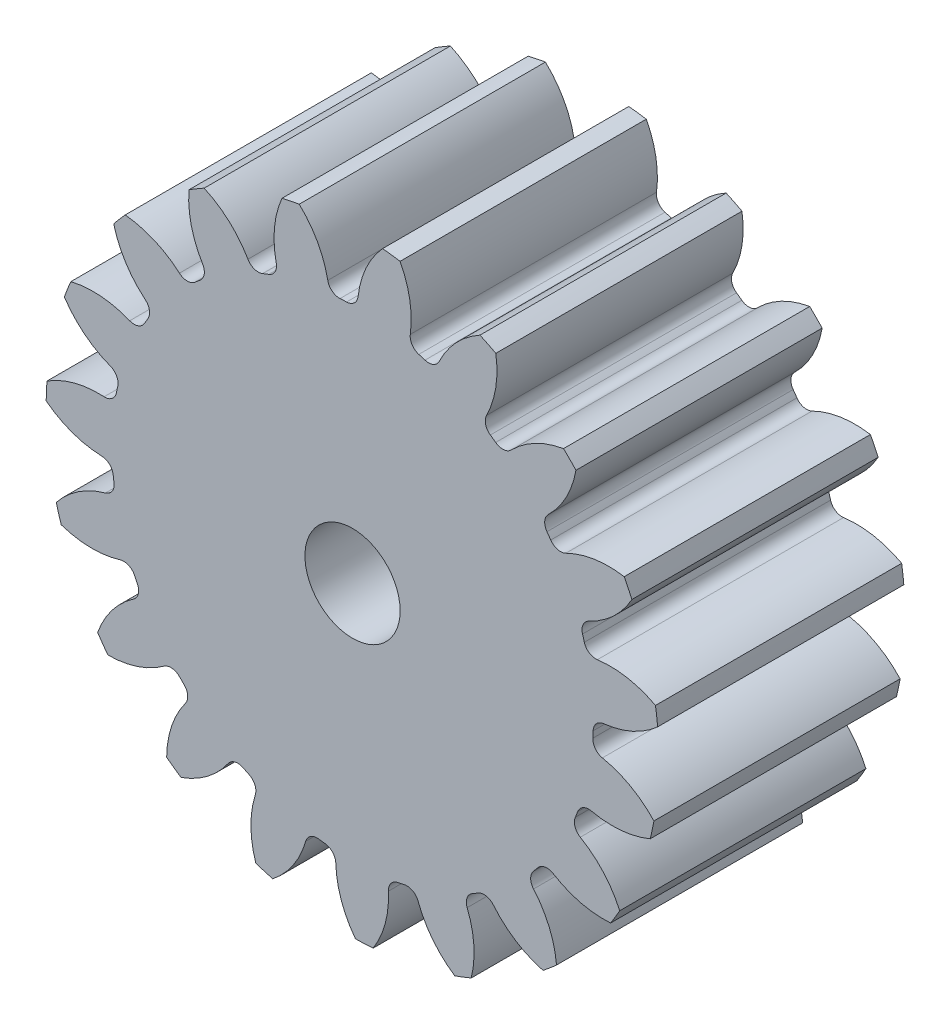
ISO-10303-21;
HEADER;
FILE_DESCRIPTION(('STEP AP214'),'2;1');
FILE_NAME('part.step','',(''),(''),'','','');
FILE_SCHEMA(('AUTOMOTIVE_DESIGN { 1 0 10303 214 1 1 1 1 }'));
ENDSEC;
DATA;
#1=APPLICATION_CONTEXT('core data for automotive mechanical design processes');
#2=APPLICATION_PROTOCOL_DEFINITION('international standard','automotive_design',2000,#1);
#3=PRODUCT_CONTEXT('',#1,'mechanical');
#4=PRODUCT('Part','Part','',(#3));
#5=PRODUCT_RELATED_PRODUCT_CATEGORY('part','',(#4));
#6=PRODUCT_DEFINITION_FORMATION('','',#4);
#7=PRODUCT_DEFINITION_CONTEXT('part definition',#1,'design');
#8=PRODUCT_DEFINITION('design','',#6,#7);
#9=PRODUCT_DEFINITION_SHAPE('','',#8);
#10=(LENGTH_UNIT() NAMED_UNIT(*) SI_UNIT(.MILLI.,.METRE.));
#11=(NAMED_UNIT(*) PLANE_ANGLE_UNIT() SI_UNIT($,.RADIAN.));
#12=(NAMED_UNIT(*) SI_UNIT($,.STERADIAN.) SOLID_ANGLE_UNIT());
#13=UNCERTAINTY_MEASURE_WITH_UNIT(LENGTH_MEASURE(1.E-05),#10,'distance_accuracy_value','');
#14=(GEOMETRIC_REPRESENTATION_CONTEXT(3) GLOBAL_UNCERTAINTY_ASSIGNED_CONTEXT((#13)) GLOBAL_UNIT_ASSIGNED_CONTEXT((#10,
#11,#12)) REPRESENTATION_CONTEXT('',''));
#15=CARTESIAN_POINT('',(0.,0.,0.));
#16=DIRECTION('',(0.,0.,1.));
#17=DIRECTION('',(1.,0.,0.));
#18=AXIS2_PLACEMENT_3D('',#15,#16,#17);
#19=CARTESIAN_POINT('',(0.,0.,95.25));
#20=DIRECTION('',(0.,0.,-1.));
#21=DIRECTION('',(-1.,0.,0.));
#22=AXIS2_PLACEMENT_3D('',#19,#20,#21);
#23=CYLINDRICAL_SURFACE('',#22,118.533333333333);
#24=DIRECTION('',(0.,0.,-1.));
#25=VECTOR('',#24,1.);
#26=CARTESIAN_POINT('',(117.205311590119,17.6936724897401,47.625));
#27=LINE('',#26,#25);
#28=CARTESIAN_POINT('',(117.205311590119,17.6936724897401,95.25));
#29=VERTEX_POINT('',#28);
#30=CARTESIAN_POINT('',(117.205311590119,17.6936724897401,0.));
#31=VERTEX_POINT('',#30);
#32=EDGE_CURVE('E780',#29,#31,#27,.T.);
#33=ORIENTED_EDGE('',*,*,#32,.F.);
#34=CARTESIAN_POINT('',(0.,0.,95.25));
#35=DIRECTION('',(0.,0.,1.));
#36=DIRECTION('',(1.,0.,0.));
#37=AXIS2_PLACEMENT_3D('',#34,#35,#36);
#38=CIRCLE('',#37,118.533333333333);
#39=CARTESIAN_POINT('',(118.030441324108,10.9071550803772,95.25));
#40=VERTEX_POINT('',#39);
#41=EDGE_CURVE('E1463',#40,#29,#38,.T.);
#42=ORIENTED_EDGE('',*,*,#41,.F.);
#43=DIRECTION('',(0.,0.,-1.));
#44=VECTOR('',#43,1.);
#45=CARTESIAN_POINT('',(118.030441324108,10.9071550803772,47.625));
#46=LINE('',#45,#44);
#47=CARTESIAN_POINT('',(118.030441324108,10.9071550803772,0.));
#48=VERTEX_POINT('',#47);
#49=EDGE_CURVE('E1457',#48,#40,#46,.F.);
#50=ORIENTED_EDGE('',*,*,#49,.F.);
#51=CARTESIAN_POINT('',(0.,0.,0.));
#52=DIRECTION('',(0.,0.,1.));
#53=DIRECTION('',(1.,0.,0.));
#54=AXIS2_PLACEMENT_3D('',#51,#52,#53);
#55=CIRCLE('',#54,118.533333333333);
#56=EDGE_CURVE('E1468',#48,#31,#55,.T.);
#57=ORIENTED_EDGE('',*,*,#56,.T.);
#58=EDGE_LOOP('',(#33,#42,#50,#57));
#59=FACE_BOUND('',#58,.T.);
#60=ADVANCED_FACE('F33',(#59),#23,.T.);
#61=DIRECTION('',(0.,0.,-1.));
#62=VECTOR('',#61,1.);
#63=CARTESIAN_POINT('',(108.093678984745,48.6405969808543,47.625));
#64=LINE('',#63,#62);
#65=CARTESIAN_POINT('',(108.093678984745,48.6405969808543,0.));
#66=VERTEX_POINT('',#65);
#67=CARTESIAN_POINT('',(108.093678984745,48.6405969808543,95.25));
#68=VERTEX_POINT('',#67);
#69=EDGE_CURVE('E751',#66,#68,#64,.F.);
#70=ORIENTED_EDGE('',*,*,#69,.F.);
#71=CARTESIAN_POINT('',(105.10967845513,54.7914829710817,0.));
#72=VERTEX_POINT('',#71);
#73=EDGE_CURVE('E1471',#66,#72,#55,.T.);
#74=ORIENTED_EDGE('',*,*,#73,.T.);
#75=DIRECTION('',(0.,0.,-1.));
#76=VECTOR('',#75,1.);
#77=CARTESIAN_POINT('',(105.10967845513,54.7914829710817,47.625));
#78=LINE('',#77,#76);
#79=CARTESIAN_POINT('',(105.10967845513,54.7914829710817,95.25));
#80=VERTEX_POINT('',#79);
#81=EDGE_CURVE('E813',#80,#72,#78,.T.);
#82=ORIENTED_EDGE('',*,*,#81,.F.);
#83=EDGE_CURVE('E1466',#68,#80,#38,.T.);
#84=ORIENTED_EDGE('',*,*,#83,.F.);
#85=EDGE_LOOP('',(#70,#74,#82,#84));
#86=FACE_BOUND('',#85,.T.);
#87=ADVANCED_FACE('F1686',(#86),#23,.T.);
#88=CARTESIAN_POINT('',(0.,0.,95.25));
#89=DIRECTION('',(0.,0.,1.));
#90=DIRECTION('',(1.,0.,0.));
#91=AXIS2_PLACEMENT_3D('',#88,#89,#90);
#92=PLANE('',#91);
#93=CARTESIAN_POINT('',(0.,0.,95.2500000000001));
#94=DIRECTION('',(0.,0.,1.));
#95=DIRECTION('',(1.,0.,0.));
#96=AXIS2_PLACEMENT_3D('',#93,#94,#95);
#97=CIRCLE('',#96,18.415);
#98=CARTESIAN_POINT('',(18.415,0.,95.2499999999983));
#99=VERTEX_POINT('',#98);
#100=EDGE_CURVE('E768',#99,#99,#97,.T.);
#101=ORIENTED_EDGE('',*,*,#100,.F.);
#102=EDGE_LOOP('',(#101));
#103=FACE_BOUND('',#102,.T.);
#104=ORIENTED_EDGE('',*,*,#41,.T.);
#105=CARTESIAN_POINT('',(99.6343378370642,-15.1315820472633,95.25));
#106=DIRECTION('',(0.,0.,-1.));
#107=DIRECTION('',(0.945817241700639,0.32469946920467,0.));
#108=AXIS2_PLACEMENT_3D('',#105,#106,#107);
#109=CIRCLE('',#108,37.2321964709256);
#110=CARTESIAN_POINT('',(94.7207043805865,21.7749574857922,95.25));
#111=VERTEX_POINT('',#110);
#112=EDGE_CURVE('E760',#111,#29,#109,.T.);
#113=ORIENTED_EDGE('',*,*,#112,.F.);
#114=CARTESIAN_POINT('',(94.1143455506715,26.3293481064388,95.25));
#115=DIRECTION('',(0.,0.,1.));
#116=DIRECTION('',(-0.945817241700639,-0.32469946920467,0.));
#117=AXIS2_PLACEMENT_3D('',#114,#115,#116);
#118=CIRCLE('',#117,4.59457777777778);
#119=CARTESIAN_POINT('',(89.689655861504,25.0915007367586,95.25));
#120=VERTEX_POINT('',#119);
#121=EDGE_CURVE('E758',#120,#111,#118,.T.);
#122=ORIENTED_EDGE('',*,*,#121,.F.);
#123=CARTESIAN_POINT('',(0.,0.,95.25));
#124=DIRECTION('',(0.,0.,-1.));
#125=DIRECTION('',(0.945817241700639,0.32469946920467,0.));
#126=AXIS2_PLACEMENT_3D('',#123,#124,#125);
#127=CIRCLE('',#126,93.1333333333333);
#128=CARTESIAN_POINT('',(88.9767459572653,27.5128416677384,95.25));
#129=VERTEX_POINT('',#128);
#130=EDGE_CURVE('E743',#129,#120,#127,.T.);
#131=ORIENTED_EDGE('',*,*,#130,.F.);
#132=CARTESIAN_POINT('',(93.3662654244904,28.8701418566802,95.25));
#133=DIRECTION('',(0.,0.,1.));
#134=DIRECTION('',(-0.945817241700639,-0.32469946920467,0.));
#135=AXIS2_PLACEMENT_3D('',#132,#133,#134);
#136=CIRCLE('',#135,4.59457777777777);
#137=CARTESIAN_POINT('',(91.4079449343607,33.0264774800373,95.25));
#138=VERTEX_POINT('',#137);
#139=EDGE_CURVE('E735',#138,#129,#136,.T.);
#140=ORIENTED_EDGE('',*,*,#139,.F.);
#141=CARTESIAN_POINT('',(75.5386797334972,66.7073752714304,95.25));
#142=DIRECTION('',(0.,0.,-1.));
#143=DIRECTION('',(-0.945817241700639,-0.32469946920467,0.));
#144=AXIS2_PLACEMENT_3D('',#141,#142,#143);
#145=CIRCLE('',#144,37.2321964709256);
#146=EDGE_CURVE('E765',#68,#138,#145,.T.);
#147=ORIENTED_EDGE('',*,*,#146,.F.);
#148=ORIENTED_EDGE('',*,*,#83,.T.);
#149=CARTESIAN_POINT('',(99.1490912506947,18.0395054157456,95.25));
#150=DIRECTION('',(0.,0.,-1.));
#151=DIRECTION('',(0.789140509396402,0.614212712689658,0.));
#152=AXIS2_PLACEMENT_3D('',#149,#150,#151);
#153=CIRCLE('',#152,37.2321964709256);
#154=CARTESIAN_POINT('',(82.5181582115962,51.3508926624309,95.25));
#155=VERTEX_POINT('',#154);
#156=EDGE_CURVE('E789',#155,#80,#153,.T.);
#157=ORIENTED_EDGE('',*,*,#156,.F.);
#158=CARTESIAN_POINT('',(80.4658453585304,55.461629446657,95.25));
#159=DIRECTION('',(0.,0.,1.));
#160=DIRECTION('',(-0.789140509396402,-0.614212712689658,0.));
#161=AXIS2_PLACEMENT_3D('',#158,#159,#160);
#162=CIRCLE('',#161,4.59457777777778);
#163=CARTESIAN_POINT('',(76.6828259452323,52.8541576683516,95.25));
#164=VERTEX_POINT('',#163);
#165=EDGE_CURVE('E787',#164,#155,#162,.T.);
#166=ORIENTED_EDGE('',*,*,#165,.F.);
#167=CARTESIAN_POINT('',(0.,0.,95.25));
#168=DIRECTION('',(0.,0.,-1.));
#169=DIRECTION('',(0.789140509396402,0.614212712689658,0.));
#170=AXIS2_PLACEMENT_3D('',#167,#168,#169);
#171=CIRCLE('',#170,93.1333333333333);
#172=CARTESIAN_POINT('',(75.2223353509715,54.9128222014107,95.25));
#173=VERTEX_POINT('',#172);
#174=EDGE_CURVE('E784',#173,#164,#171,.T.);
#175=ORIENTED_EDGE('',*,*,#174,.F.);
#176=CARTESIAN_POINT('',(78.9333038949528,57.621854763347,95.25));
#177=DIRECTION('',(0.,0.,1.));
#178=DIRECTION('',(-0.789140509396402,-0.614212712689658,0.));
#179=AXIS2_PLACEMENT_3D('',#176,#177,#178);
#180=CIRCLE('',#179,4.59457777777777);
#181=CARTESIAN_POINT('',(75.7315306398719,60.9171230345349,95.25));
#182=VERTEX_POINT('',#181);
#183=EDGE_CURVE('E782',#182,#173,#180,.T.);
#184=ORIENTED_EDGE('',*,*,#183,.F.);
#185=CARTESIAN_POINT('',(49.7859363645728,87.6203548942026,95.25));
#186=DIRECTION('',(0.,0.,-1.));
#187=DIRECTION('',(-0.789140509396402,-0.614212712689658,0.));
#188=AXIS2_PLACEMENT_3D('',#185,#186,#187);
#189=CIRCLE('',#188,37.2321964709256);
#190=CARTESIAN_POINT('',(86.4432892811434,81.1030754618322,95.25));
#191=VERTEX_POINT('',#190);
#192=EDGE_CURVE('E792',#191,#182,#189,.T.);
#193=ORIENTED_EDGE('',*,*,#192,.F.);
#194=CARTESIAN_POINT('',(81.6237807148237,85.9517860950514,95.25));
#195=VERTEX_POINT('',#194);
#196=EDGE_CURVE('E1517',#191,#195,#38,.T.);
#197=ORIENTED_EDGE('',*,*,#196,.T.);
#198=CARTESIAN_POINT('',(87.919502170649,49.2557325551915,95.25));
#199=DIRECTION('',(0.,0.,-1.));
#200=DIRECTION('',(0.546948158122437,0.837166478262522,0.));
#201=AXIS2_PLACEMENT_3D('',#198,#199,#200);
#202=CIRCLE('',#201,37.2321964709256);
#203=CARTESIAN_POINT('',(61.3734891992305,75.3621618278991,95.25));
#204=VERTEX_POINT('',#203);
#205=EDGE_CURVE('E824',#204,#195,#202,.T.);
#206=ORIENTED_EDGE('',*,*,#205,.F.);
#207=CARTESIAN_POINT('',(58.0976222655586,78.5837826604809,95.25));
#208=DIRECTION('',(0.,0.,1.));
#209=DIRECTION('',(-0.546948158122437,-0.837166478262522,0.));
#210=AXIS2_PLACEMENT_3D('',#207,#208,#209);
#211=CIRCLE('',#210,4.59457777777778);
#212=CARTESIAN_POINT('',(55.366221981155,74.8892464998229,95.25));
#213=VERTEX_POINT('',#212);
#214=EDGE_CURVE('E822',#213,#204,#211,.T.);
#215=ORIENTED_EDGE('',*,*,#214,.F.);
#216=CARTESIAN_POINT('',(0.,0.,95.25));
#217=DIRECTION('',(0.,0.,-1.));
#218=DIRECTION('',(0.546948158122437,0.837166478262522,0.));
#219=AXIS2_PLACEMENT_3D('',#216,#217,#218);
#220=CIRCLE('',#219,93.1333333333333);
#221=CARTESIAN_POINT('',(53.3164175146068,76.3621463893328,95.25));
#222=VERTEX_POINT('',#221);
#223=EDGE_CURVE('E819',#222,#213,#220,.T.);
#224=ORIENTED_EDGE('',*,*,#223,.F.);
#225=CARTESIAN_POINT('',(55.946694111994,80.1293456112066,95.25));
#226=DIRECTION('',(0.,0.,1.));
#227=DIRECTION('',(-0.546948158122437,-0.837166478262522,0.));
#228=AXIS2_PLACEMENT_3D('',#225,#226,#227);
#229=CIRCLE('',#228,4.59457777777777);
#230=CARTESIAN_POINT('',(51.8484299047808,82.2064530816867,95.25));
#231=VERTEX_POINT('',#230);
#232=EDGE_CURVE('E817',#231,#222,#229,.T.);
#233=ORIENTED_EDGE('',*,*,#232,.F.);
#234=CARTESIAN_POINT('',(18.6381142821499,99.0383094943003,95.25));
#235=DIRECTION('',(0.,0.,-1.));
#236=DIRECTION('',(-0.546948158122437,-0.837166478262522,0.));
#237=AXIS2_PLACEMENT_3D('',#234,#235,#236);
#238=CIRCLE('',#237,37.2321964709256);
#239=CARTESIAN_POINT('',(55.4254278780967,104.776777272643,95.25));
#240=VERTEX_POINT('',#239);
#241=EDGE_CURVE('E827',#240,#231,#238,.T.);
#242=ORIENTED_EDGE('',*,*,#241,.F.);
#243=CARTESIAN_POINT('',(49.2926798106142,107.797879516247,95.25));
#244=VERTEX_POINT('',#243);
#245=EDGE_CURVE('E1668',#240,#244,#38,.T.);
#246=ORIENTED_EDGE('',*,*,#245,.T.);
#247=CARTESIAN_POINT('',(67.1624708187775,75.1343367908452,95.25));
#248=DIRECTION('',(0.,0.,-1.));
#249=DIRECTION('',(0.24548548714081,0.969400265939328,0.));
#250=AXIS2_PLACEMENT_3D('',#247,#248,#249);
#251=CIRCLE('',#250,37.2321964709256);
#252=CARTESIAN_POINT('',(33.5780503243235,91.20677139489,95.25));
#253=VERTEX_POINT('',#252);
#254=EDGE_CURVE('E862',#253,#244,#251,.T.);
#255=ORIENTED_EDGE('',*,*,#254,.F.);
#256=CARTESIAN_POINT('',(29.4336203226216,93.1901636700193,95.25));
#257=DIRECTION('',(0.,0.,1.));
#258=DIRECTION('',(-0.24548548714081,-0.969400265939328,0.));
#259=AXIS2_PLACEMENT_3D('',#256,#257,#258);
#260=CIRCLE('',#259,4.59457777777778);
#261=CARTESIAN_POINT('',(28.0498287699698,88.8089234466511,95.25));
#262=VERTEX_POINT('',#261);
#263=EDGE_CURVE('E860',#262,#253,#260,.T.);
#264=ORIENTED_EDGE('',*,*,#263,.F.);
#265=CARTESIAN_POINT('',(0.,0.,95.25));
#266=DIRECTION('',(0.,0.,-1.));
#267=DIRECTION('',(0.24548548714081,0.969400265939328,0.));
#268=AXIS2_PLACEMENT_3D('',#265,#266,#267);
#269=CIRCLE('',#268,93.1333333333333);
#270=CARTESIAN_POINT('',(25.632838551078,89.536447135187,95.25));
#271=VERTEX_POINT('',#270);
#272=EDGE_CURVE('E857',#271,#262,#269,.T.);
#273=ORIENTED_EDGE('',*,*,#272,.F.);
#274=CARTESIAN_POINT('',(26.8973919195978,93.9535785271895,95.25));
#275=DIRECTION('',(0.,0.,1.));
#276=DIRECTION('',(-0.24548548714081,-0.969400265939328,0.));
#277=AXIS2_PLACEMENT_3D('',#274,#275,#276);
#278=CIRCLE('',#277,4.59457777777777);
#279=CARTESIAN_POINT('',(22.346747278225,94.5874383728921,95.25));
#280=VERTEX_POINT('',#279);
#281=EDGE_CURVE('E855',#280,#271,#278,.T.);
#282=ORIENTED_EDGE('',*,*,#281,.F.);
#283=CARTESIAN_POINT('',(-14.5294366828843,99.7239265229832,95.25));
#284=DIRECTION('',(0.,0.,-1.));
#285=DIRECTION('',(-0.24548548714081,-0.969400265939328,0.));
#286=AXIS2_PLACEMENT_3D('',#283,#284,#285);
#287=CIRCLE('',#286,37.2321964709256);
#288=CARTESIAN_POINT('',(18.4013613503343,117.096289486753,95.25));
#289=VERTEX_POINT('',#288);
#290=EDGE_CURVE('E865',#289,#280,#287,.T.);
#291=ORIENTED_EDGE('',*,*,#290,.F.);
#292=CARTESIAN_POINT('',(11.6199521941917,117.962400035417,95.25));
#293=VERTEX_POINT('',#292);
#294=EDGE_CURVE('E1664',#289,#293,#38,.T.);
#295=ORIENTED_EDGE('',*,*,#294,.T.);
#296=CARTESIAN_POINT('',(39.1273436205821,92.8709698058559,95.25));
#297=DIRECTION('',(0.,0.,-1.));
#298=DIRECTION('',(-0.0825793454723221,0.996584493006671,0.));
#299=AXIS2_PLACEMENT_3D('',#296,#297,#298);
#300=CIRCLE('',#299,37.2321964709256);
#301=CARTESIAN_POINT('',(2.14390867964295,97.1677120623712,95.25));
#302=VERTEX_POINT('',#301);
#303=EDGE_CURVE('E900',#302,#293,#300,.T.);
#304=ORIENTED_EDGE('',*,*,#303,.F.);
#305=CARTESIAN_POINT('',(-2.41997109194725,97.6979444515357,95.25));
#306=DIRECTION('',(0.,0.,1.));
#307=DIRECTION('',(0.0825793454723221,-0.996584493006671,0.));
#308=AXIS2_PLACEMENT_3D('',#305,#306,#307);
#309=CIRCLE('',#308,4.59457777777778);
#310=CARTESIAN_POINT('',(-2.30619862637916,93.1047755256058,95.25));
#311=VERTEX_POINT('',#310);
#312=EDGE_CURVE('E898',#311,#302,#309,.T.);
#313=ORIENTED_EDGE('',*,*,#312,.F.);
#314=CARTESIAN_POINT('',(0.,0.,95.25));
#315=DIRECTION('',(0.,0.,-1.));
#316=DIRECTION('',(-0.0825793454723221,0.996584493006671,0.));
#317=AXIS2_PLACEMENT_3D('',#314,#315,#316);
#318=CIRCLE('',#317,93.1333333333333);
#319=CARTESIAN_POINT('',(-4.82845620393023,93.0080845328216,95.25));
#320=VERTEX_POINT('',#319);
#321=EDGE_CURVE('E895',#320,#311,#318,.T.);
#322=ORIENTED_EDGE('',*,*,#321,.F.);
#323=CARTESIAN_POINT('',(-5.06666004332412,97.5964833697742,95.25));
#324=DIRECTION('',(0.,0.,1.));
#325=DIRECTION('',(0.0825793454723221,-0.996584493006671,0.));
#326=AXIS2_PLACEMENT_3D('',#323,#324,#325);
#327=CIRCLE('',#326,4.59457777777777);
#328=CARTESIAN_POINT('',(-9.57655216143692,96.7184070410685,95.25));
#329=VERTEX_POINT('',#328);
#330=EDGE_CURVE('E893',#329,#320,#327,.T.);
#331=ORIENTED_EDGE('',*,*,#330,.F.);
#332=CARTESIAN_POINT('',(-46.1224977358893,89.6029087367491,95.25));
#333=DIRECTION('',(0.,0.,-1.));
#334=DIRECTION('',(0.0825793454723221,-0.996584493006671,0.));
#335=AXIS2_PLACEMENT_3D('',#332,#333,#334);
#336=CIRCLE('',#335,37.2321964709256);
#337=CARTESIAN_POINT('',(-20.616778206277,116.726601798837,95.25));
#338=VERTEX_POINT('',#337);
#339=EDGE_CURVE('E903',#338,#329,#336,.T.);
#340=ORIENTED_EDGE('',*,*,#339,.F.);
#341=CARTESIAN_POINT('',(-27.3119775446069,115.343864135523,95.25));
#342=VERTEX_POINT('',#341);
#343=EDGE_CURVE('E1660',#338,#342,#38,.T.);
#344=ORIENTED_EDGE('',*,*,#343,.T.);
#345=CARTESIAN_POINT('',(6.85216161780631,100.54359220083,95.25));
#346=DIRECTION('',(0.,0.,-1.));
#347=DIRECTION('',(-0.40169542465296,0.915773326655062,0.));
#348=AXIS2_PLACEMENT_3D('',#345,#346,#347);
#349=CIRCLE('',#348,37.2321964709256);
#350=CARTESIAN_POINT('',(-29.5225587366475,92.5990234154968,95.25));
#351=VERTEX_POINT('',#350);
#352=EDGE_CURVE('E938',#351,#342,#349,.T.);
#353=ORIENTED_EDGE('',*,*,#352,.F.);
#354=CARTESIAN_POINT('',(-34.0113210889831,91.6186370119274,95.25));
#355=DIRECTION('',(0.,0.,1.));
#356=DIRECTION('',(0.40169542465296,-0.915773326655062,0.));
#357=AXIS2_PLACEMENT_3D('',#354,#355,#356);
#358=CIRCLE('',#357,4.59457777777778);
#359=CARTESIAN_POINT('',(-32.4123136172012,87.3112805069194,95.25));
#360=VERTEX_POINT('',#359);
#361=EDGE_CURVE('E936',#360,#351,#358,.T.);
#362=ORIENTED_EDGE('',*,*,#361,.F.);
#363=CARTESIAN_POINT('',(0.,0.,95.25));
#364=DIRECTION('',(0.,0.,-1.));
#365=DIRECTION('',(-0.40169542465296,0.915773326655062,0.));
#366=AXIS2_PLACEMENT_3D('',#363,#364,#365);
#367=CIRCLE('',#366,93.1333333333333);
#368=CARTESIAN_POINT('',(-34.7665128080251,86.4008528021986,95.25));
#369=VERTEX_POINT('',#368);
#370=EDGE_CURVE('E933',#369,#360,#367,.T.);
#371=ORIENTED_EDGE('',*,*,#370,.F.);
#372=CARTESIAN_POINT('',(-36.481660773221,90.6632948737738,95.25));
#373=DIRECTION('',(0.,0.,1.));
#374=DIRECTION('',(0.40169542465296,-0.915773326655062,0.));
#375=AXIS2_PLACEMENT_3D('',#372,#373,#374);
#376=CIRCLE('',#375,4.59457777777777);
#377=CARTESIAN_POINT('',(-40.46208357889,88.3684355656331,95.25));
#378=VERTEX_POINT('',#377);
#379=EDGE_CURVE('E931',#378,#369,#376,.T.);
#380=ORIENTED_EDGE('',*,*,#379,.F.);
#381=CARTESIAN_POINT('',(-72.7174704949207,69.7720254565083,95.25));
#382=DIRECTION('',(0.,0.,-1.));
#383=DIRECTION('',(0.40169542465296,-0.915773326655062,0.));
#384=AXIS2_PLACEMENT_3D('',#381,#382,#383);
#385=CIRCLE('',#384,37.2321964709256);
#386=CARTESIAN_POINT('',(-57.4007699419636,103.707775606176,95.25));
#387=VERTEX_POINT('',#386);
#388=EDGE_CURVE('E941',#387,#378,#385,.T.);
#389=ORIENTED_EDGE('',*,*,#388,.F.);
#390=CARTESIAN_POINT('',(-63.2842307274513,100.226030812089,95.25));
#391=VERTEX_POINT('',#390);
#392=EDGE_CURVE('E1656',#387,#391,#38,.T.);
#393=ORIENTED_EDGE('',*,*,#392,.T.);
#394=CARTESIAN_POINT('',(-26.1655584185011,97.3207562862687,95.25));
#395=DIRECTION('',(0.,0.,-1.));
#396=DIRECTION('',(-0.677281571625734,0.735723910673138,0.));
#397=AXIS2_PLACEMENT_3D('',#394,#395,#396);
#398=CIRCLE('',#397,37.2321964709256);
#399=CARTESIAN_POINT('',(-57.9897988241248,77.9957937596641,95.25));
#400=VERTEX_POINT('',#399);
#401=EDGE_CURVE('E976',#400,#391,#398,.T.);
#402=ORIENTED_EDGE('',*,*,#401,.F.);
#403=CARTESIAN_POINT('',(-61.9170167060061,75.6110286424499,95.25));
#404=DIRECTION('',(0.,0.,1.));
#405=DIRECTION('',(0.677281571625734,-0.735723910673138,0.));
#406=AXIS2_PLACEMENT_3D('',#403,#404,#405);
#407=CIRCLE('',#406,4.59457777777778);
#408=CARTESIAN_POINT('',(-59.0060514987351,72.0562534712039,95.25));
#409=VERTEX_POINT('',#408);
#410=EDGE_CURVE('E974',#409,#400,#407,.T.);
#411=ORIENTED_EDGE('',*,*,#410,.F.);
#412=CARTESIAN_POINT('',(0.,0.,95.25));
#413=DIRECTION('',(0.,0.,-1.));
#414=DIRECTION('',(-0.677281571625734,0.735723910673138,0.));
#415=AXIS2_PLACEMENT_3D('',#412,#413,#414);
#416=CIRCLE('',#415,93.1333333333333);
#417=CARTESIAN_POINT('',(-60.9370782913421,70.4307480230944,95.25));
#418=VERTEX_POINT('',#417);
#419=EDGE_CURVE('E971',#418,#409,#416,.T.);
#420=ORIENTED_EDGE('',*,*,#419,.F.);
#421=CARTESIAN_POINT('',(-63.9433074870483,73.9053315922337,95.25));
#422=DIRECTION('',(0.,0.,1.));
#423=DIRECTION('',(0.677281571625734,-0.735723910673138,0.));
#424=AXIS2_PLACEMENT_3D('',#421,#422,#423);
#425=CIRCLE('',#424,4.59457777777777);
#426=CARTESIAN_POINT('',(-66.9629204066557,70.4423729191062,95.25));
#427=VERTEX_POINT('',#426);
#428=EDGE_CURVE('E969',#427,#418,#425,.T.);
#429=ORIENTED_EDGE('',*,*,#428,.F.);
#430=CARTESIAN_POINT('',(-91.4323769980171,42.380260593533,95.25));
#431=DIRECTION('',(0.,0.,-1.));
#432=DIRECTION('',(0.677281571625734,-0.735723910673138,0.));
#433=AXIS2_PLACEMENT_3D('',#430,#431,#432);
#434=CIRCLE('',#433,37.2321964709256);
#435=CARTESIAN_POINT('',(-87.9644975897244,79.4506027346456,95.25));
#436=VERTEX_POINT('',#435);
#437=EDGE_CURVE('E979',#436,#427,#434,.T.);
#438=ORIENTED_EDGE('',*,*,#437,.F.);
#439=CARTESIAN_POINT('',(-92.3986555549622,74.2471518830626,95.25));
#440=VERTEX_POINT('',#439);
#441=EDGE_CURVE('E1652',#436,#440,#38,.T.);
#442=ORIENTED_EDGE('',*,*,#441,.T.);
#443=CARTESIAN_POINT('',(-56.3478341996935,83.5517063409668,95.25));
#444=DIRECTION('',(0.,0.,-1.));
#445=DIRECTION('',(-0.879473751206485,0.475947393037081,0.));
#446=AXIS2_PLACEMENT_3D('',#443,#444,#445);
#447=CIRCLE('',#446,37.2321964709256);
#448=CARTESIAN_POINT('',(-80.1729444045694,54.9405096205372,95.25));
#449=VERTEX_POINT('',#448);
#450=EDGE_CURVE('E1014',#449,#440,#447,.T.);
#451=ORIENTED_EDGE('',*,*,#450,.F.);
#452=CARTESIAN_POINT('',(-83.1130428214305,51.4097920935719,95.25));
#453=DIRECTION('',(0.,0.,1.));
#454=DIRECTION('',(0.879473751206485,-0.475947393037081,0.));
#455=AXIS2_PLACEMENT_3D('',#452,#453,#454);
#456=CIRCLE('',#455,4.59457777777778);
#457=CARTESIAN_POINT('',(-79.2055681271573,48.9928133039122,95.25));
#458=VERTEX_POINT('',#457);
#459=EDGE_CURVE('E1012',#458,#449,#456,.T.);
#460=ORIENTED_EDGE('',*,*,#459,.F.);
#461=CARTESIAN_POINT('',(0.,0.,95.25));
#462=DIRECTION('',(0.,0.,-1.));
#463=DIRECTION('',(-0.879473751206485,0.475947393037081,0.));
#464=AXIS2_PLACEMENT_3D('',#461,#462,#463);
#465=CIRCLE('',#464,93.1333333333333);
#466=CARTESIAN_POINT('',(-80.5041658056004,46.8283788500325,95.25));
#467=VERTEX_POINT('',#466);
#468=EDGE_CURVE('E1009',#467,#458,#465,.T.);
#469=ORIENTED_EDGE('',*,*,#468,.F.);
#470=CARTESIAN_POINT('',(-84.47570465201,49.1385788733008,95.25));
#471=DIRECTION('',(0.,0.,1.));
#472=DIRECTION('',(0.879473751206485,-0.475947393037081,0.));
#473=AXIS2_PLACEMENT_3D('',#470,#471,#472);
#474=CIRCLE('',#473,4.59457777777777);
#475=CARTESIAN_POINT('',(-86.2072857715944,44.8827861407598,95.25));
#476=VERTEX_POINT('',#475);
#477=EDGE_CURVE('E1007',#476,#467,#474,.T.);
#478=ORIENTED_EDGE('',*,*,#477,.F.);
#479=CARTESIAN_POINT('',(-100.239166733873,10.3959368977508,95.25));
#480=DIRECTION('',(0.,0.,-1.));
#481=DIRECTION('',(0.879473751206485,-0.475947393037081,0.));
#482=AXIS2_PLACEMENT_3D('',#479,#480,#481);
#483=CIRCLE('',#482,37.2321964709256);
#484=CARTESIAN_POINT('',(-108.995907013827,46.5837242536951,95.25));
#485=VERTEX_POINT('',#484);
#486=EDGE_CURVE('E1017',#485,#476,#483,.T.);
#487=ORIENTED_EDGE('',*,*,#486,.F.);
#488=CARTESIAN_POINT('',(-111.500252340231,40.2224419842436,95.25));
#489=VERTEX_POINT('',#488);
#490=EDGE_CURVE('E1648',#485,#489,#38,.T.);
#491=ORIENTED_EDGE('',*,*,#490,.T.);
#492=CARTESIAN_POINT('',(-80.4239478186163,60.7285325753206,95.25));
#493=DIRECTION('',(0.,0.,-1.));
#494=DIRECTION('',(-0.986361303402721,0.164594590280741,0.));
#495=AXIS2_PLACEMENT_3D('',#492,#493,#494);
#496=CIRCLE('',#495,37.2321964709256);
#497=CARTESIAN_POINT('',(-93.6681074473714,25.9315687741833,95.25));
#498=VERTEX_POINT('',#497);
#499=EDGE_CURVE('E1052',#498,#489,#496,.T.);
#500=ORIENTED_EDGE('',*,*,#499,.F.);
#501=CARTESIAN_POINT('',(-95.3024811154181,21.6375068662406,95.25));
#502=DIRECTION('',(0.,0.,1.));
#503=DIRECTION('',(0.986361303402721,-0.164594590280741,0.));
#504=AXIS2_PLACEMENT_3D('',#501,#502,#503);
#505=CIRCLE('',#504,4.59457777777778);
#506=CARTESIAN_POINT('',(-90.8219324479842,20.620241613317,95.25));
#507=VERTEX_POINT('',#506);
#508=EDGE_CURVE('E1050',#507,#498,#505,.T.);
#509=ORIENTED_EDGE('',*,*,#508,.F.);
#510=CARTESIAN_POINT('',(0.,0.,95.25));
#511=DIRECTION('',(0.,0.,-1.));
#512=DIRECTION('',(-0.986361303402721,0.164594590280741,0.));
#513=AXIS2_PLACEMENT_3D('',#510,#511,#512);
#514=CIRCLE('',#513,93.1333333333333);
#515=CARTESIAN_POINT('',(-91.3473778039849,18.1514282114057,95.25));
#516=VERTEX_POINT('',#515);
#517=EDGE_CURVE('E1047',#516,#507,#514,.T.);
#518=ORIENTED_EDGE('',*,*,#517,.F.);
#519=CARTESIAN_POINT('',(-95.8538484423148,19.0468986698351,95.25));
#520=DIRECTION('',(0.,0.,1.));
#521=DIRECTION('',(0.986361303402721,-0.164594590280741,0.));
#522=AXIS2_PLACEMENT_3D('',#519,#520,#521);
#523=CIRCLE('',#522,4.59457777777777);
#524=CARTESIAN_POINT('',(-96.1097540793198,14.4594530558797,95.25));
#525=VERTEX_POINT('',#524);
#526=EDGE_CURVE('E1045',#525,#516,#523,.T.);
#527=ORIENTED_EDGE('',*,*,#526,.F.);
#528=CARTESIAN_POINT('',(-98.1834873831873,-22.7149478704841,95.25));
#529=DIRECTION('',(0.,0.,-1.));
#530=DIRECTION('',(0.986361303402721,-0.164594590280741,0.));
#531=AXIS2_PLACEMENT_3D('',#528,#529,#530);
#532=CIRCLE('',#531,37.2321964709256);
#533=CARTESIAN_POINT('',(-118.215918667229,8.66877642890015,95.25));
#534=VERTEX_POINT('',#533);
#535=EDGE_CURVE('E1055',#534,#525,#532,.T.);
#536=ORIENTED_EDGE('',*,*,#535,.F.);
#537=CARTESIAN_POINT('',(-118.519066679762,1.83900638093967,95.25));
#538=VERTEX_POINT('',#537);
#539=EDGE_CURVE('E1644',#534,#538,#38,.T.);
#540=ORIENTED_EDGE('',*,*,#539,.T.);
#541=CARTESIAN_POINT('',(-95.7848787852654,31.324480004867,95.25));
#542=DIRECTION('',(0.,0.,-1.));
#543=DIRECTION('',(-0.986361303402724,-0.164594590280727,0.));
#544=AXIS2_PLACEMENT_3D('',#541,#542,#543);
#545=CIRCLE('',#544,37.2321964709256);
#546=CARTESIAN_POINT('',(-97.0128776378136,-5.88745991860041,95.25));
#547=VERTEX_POINT('',#546);
#548=EDGE_CURVE('E1090',#547,#538,#545,.T.);
#549=ORIENTED_EDGE('',*,*,#548,.F.);
#550=CARTESIAN_POINT('',(-97.1644168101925,-10.4795379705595,95.25));
#551=DIRECTION('',(0.,0.,1.));
#552=DIRECTION('',(0.986361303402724,0.164594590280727,0.));
#553=AXIS2_PLACEMENT_3D('',#550,#551,#552);
#554=CIRCLE('',#553,4.59457777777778);
#555=CARTESIAN_POINT('',(-92.5963311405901,-9.98685321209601,95.25));
#556=VERTEX_POINT('',#555);
#557=EDGE_CURVE('E1088',#556,#547,#554,.T.);
#558=ORIENTED_EDGE('',*,*,#557,.F.);
#559=CARTESIAN_POINT('',(0.,0.,95.25));
#560=DIRECTION('',(0.,0.,-1.));
#561=DIRECTION('',(-0.986361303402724,-0.164594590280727,0.));
#562=AXIS2_PLACEMENT_3D('',#559,#560,#561);
#563=CIRCLE('',#562,93.1333333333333);
#564=CARTESIAN_POINT('',(-92.2916840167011,-12.4925113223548,95.25));
#565=VERTEX_POINT('',#564);
#566=EDGE_CURVE('E1085',#565,#556,#563,.T.);
#567=ORIENTED_EDGE('',*,*,#566,.F.);
#568=CARTESIAN_POINT('',(-96.8447404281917,-13.108808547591,95.25));
#569=DIRECTION('',(0.,0.,1.));
#570=DIRECTION('',(0.986361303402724,0.164594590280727,0.));
#571=AXIS2_PLACEMENT_3D('',#568,#569,#570);
#572=CIRCLE('',#571,4.59457777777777);
#573=CARTESIAN_POINT('',(-95.5972392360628,-17.5307861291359,95.25));
#574=VERTEX_POINT('',#573);
#575=EDGE_CURVE('E1083',#574,#565,#572,.T.);
#576=ORIENTED_EDGE('',*,*,#575,.F.);
#577=CARTESIAN_POINT('',(-85.488103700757,-53.3643155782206,95.25));
#578=DIRECTION('',(0.,0.,-1.));
#579=DIRECTION('',(0.986361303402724,0.164594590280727,0.));
#580=AXIS2_PLACEMENT_3D('',#577,#578,#579);
#581=CIRCLE('',#580,37.2321964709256);
#582=CARTESIAN_POINT('',(-114.625401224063,-30.1855678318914,95.25));
#583=VERTEX_POINT('',#582);
#584=EDGE_CURVE('E1093',#583,#574,#581,.T.);
#585=ORIENTED_EDGE('',*,*,#584,.F.);
#586=CARTESIAN_POINT('',(-112.694501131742,-36.7437140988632,95.25));
#587=VERTEX_POINT('',#586);
#588=EDGE_CURVE('E1640',#583,#587,#38,.T.);
#589=ORIENTED_EDGE('',*,*,#588,.T.);
#590=CARTESIAN_POINT('',(-100.766031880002,-1.47406602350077,95.25));
#591=DIRECTION('',(0.,0.,-1.));
#592=DIRECTION('',(-0.879473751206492,-0.475947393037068,0.));
#593=AXIS2_PLACEMENT_3D('',#590,#591,#592);
#594=CIRCLE('',#593,37.2321964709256);
#595=CARTESIAN_POINT('',(-89.8447972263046,-37.0684909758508,95.25));
#596=VERTEX_POINT('',#595);
#597=EDGE_CURVE('E1128',#596,#587,#594,.T.);
#598=ORIENTED_EDGE('',*,*,#597,.F.);
#599=CARTESIAN_POINT('',(-88.4970802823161,-41.4609622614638,95.25));
#600=DIRECTION('',(0.,0.,1.));
#601=DIRECTION('',(0.879473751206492,0.475947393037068,0.));
#602=AXIS2_PLACEMENT_3D('',#599,#600,#601);
#603=CIRCLE('',#602,4.59457777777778);
#604=CARTESIAN_POINT('',(-84.3364805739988,-39.5117175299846,95.25));
#605=VERTEX_POINT('',#604);
#606=EDGE_CURVE('E1126',#605,#596,#603,.T.);
#607=ORIENTED_EDGE('',*,*,#606,.F.);
#608=CARTESIAN_POINT('',(0.,0.,95.25));
#609=DIRECTION('',(0.,0.,-1.));
#610=DIRECTION('',(-0.879473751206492,-0.475947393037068,0.));
#611=AXIS2_PLACEMENT_3D('',#608,#609,#610);
#612=CIRCLE('',#611,93.1333333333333);
#613=CARTESIAN_POINT('',(-83.2347542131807,-41.7826934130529,95.25));
#614=VERTEX_POINT('',#613);
#615=EDGE_CURVE('E1123',#614,#605,#612,.T.);
#616=ORIENTED_EDGE('',*,*,#615,.F.);
#617=CARTESIAN_POINT('',(-87.3410020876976,-43.8439729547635,95.25));
#618=DIRECTION('',(0.,0.,1.));
#619=DIRECTION('',(0.879473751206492,0.475947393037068,0.));
#620=AXIS2_PLACEMENT_3D('',#617,#618,#619);
#621=CIRCLE('',#620,4.59457777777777);
#622=CARTESIAN_POINT('',(-84.7252801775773,-47.6212926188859,95.25));
#623=VERTEX_POINT('',#622);
#624=EDGE_CURVE('E1121',#623,#614,#621,.T.);
#625=ORIENTED_EDGE('',*,*,#624,.F.);
#626=CARTESIAN_POINT('',(-63.5287574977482,-78.2308316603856,95.25));
#627=DIRECTION('',(0.,0.,-1.));
#628=DIRECTION('',(0.879473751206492,0.475947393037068,0.));
#629=AXIS2_PLACEMENT_3D('',#626,#627,#628);
#630=CIRCLE('',#629,37.2321964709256);
#631=CARTESIAN_POINT('',(-98.6134429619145,-65.7688374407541,95.25));
#632=VERTEX_POINT('',#631);
#633=EDGE_CURVE('E1131',#632,#623,#630,.T.);
#634=ORIENTED_EDGE('',*,*,#633,.F.);
#635=CARTESIAN_POINT('',(-94.6577377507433,-71.3446830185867,95.25));
#636=VERTEX_POINT('',#635);
#637=EDGE_CURVE('E1636',#632,#636,#38,.T.);
#638=ORIENTED_EDGE('',*,*,#637,.T.);
#639=CARTESIAN_POINT('',(-94.8276218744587,-34.1128741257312,95.25));
#640=DIRECTION('',(0.,0.,-1.));
#641=DIRECTION('',(-0.677281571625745,-0.735723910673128,0.));
#642=AXIS2_PLACEMENT_3D('',#639,#640,#641);
#643=CIRCLE('',#642,37.2321964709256);
#644=CARTESIAN_POINT('',(-72.9406389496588,-64.2325758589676,95.25));
#645=VERTEX_POINT('',#644);
#646=EDGE_CURVE('E1166',#645,#636,#643,.T.);
#647=ORIENTED_EDGE('',*,*,#646,.F.);
#648=CARTESIAN_POINT('',(-70.239711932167,-67.9494479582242,95.25));
#649=DIRECTION('',(0.,0.,1.));
#650=DIRECTION('',(0.677281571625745,0.735723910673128,0.));
#651=AXIS2_PLACEMENT_3D('',#648,#649,#650);
#652=CIRCLE('',#651,4.59457777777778);
#653=CARTESIAN_POINT('',(-66.9374637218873,-64.7548741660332,95.25));
#654=VERTEX_POINT('',#653);
#655=EDGE_CURVE('E1164',#654,#645,#652,.T.);
#656=ORIENTED_EDGE('',*,*,#655,.F.);
#657=CARTESIAN_POINT('',(0.,0.,95.25));
#658=DIRECTION('',(0.,0.,-1.));
#659=DIRECTION('',(-0.677281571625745,-0.735723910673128,0.));
#660=AXIS2_PLACEMENT_3D('',#657,#658,#659);
#661=CIRCLE('',#660,93.1333333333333);
#662=CARTESIAN_POINT('',(-65.1580472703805,-66.545072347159,95.25));
#663=VERTEX_POINT('',#662);
#664=EDGE_CURVE('E1161',#663,#654,#661,.T.);
#665=ORIENTED_EDGE('',*,*,#664,.F.);
#666=CARTESIAN_POINT('',(-68.3725109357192,-69.8279625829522,95.25));
#667=DIRECTION('',(0.,0.,1.));
#668=DIRECTION('',(0.677281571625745,0.735723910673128,0.));
#669=AXIS2_PLACEMENT_3D('',#666,#667,#668);
#670=CIRCLE('',#669,4.59457777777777);
#671=CARTESIAN_POINT('',(-64.6720223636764,-72.5512931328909,95.25));
#672=VERTEX_POINT('',#671);
#673=EDGE_CURVE('E1159',#672,#663,#670,.T.);
#674=ORIENTED_EDGE('',*,*,#673,.F.);
#675=CARTESIAN_POINT('',(-34.6850846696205,-94.6198232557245,95.25));
#676=DIRECTION('',(0.,0.,-1.));
#677=DIRECTION('',(0.677281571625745,0.735723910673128,0.));
#678=AXIS2_PLACEMENT_3D('',#675,#676,#677);
#679=CIRCLE('',#678,37.2321964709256);
#680=CARTESIAN_POINT('',(-71.9151880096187,-94.2250330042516,95.25));
#681=VERTEX_POINT('',#680);
#682=EDGE_CURVE('E1169',#681,#672,#679,.T.);
#683=ORIENTED_EDGE('',*,*,#682,.F.);
#684=CARTESIAN_POINT('',(-66.3633397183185,-98.2143485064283,95.25));
#685=VERTEX_POINT('',#684);
#686=EDGE_CURVE('E1632',#681,#685,#38,.T.);
#687=ORIENTED_EDGE('',*,*,#686,.T.);
#688=CARTESIAN_POINT('',(-78.6131676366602,-63.0550230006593,95.25));
#689=DIRECTION('',(0.,0.,-1.));
#690=DIRECTION('',(-0.401695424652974,-0.915773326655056,0.));
#691=AXIS2_PLACEMENT_3D('',#688,#689,#690);
#692=CIRCLE('',#691,37.2321964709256);
#693=CARTESIAN_POINT('',(-48.1322306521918,-84.4360644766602,95.25));
#694=VERTEX_POINT('',#693);
#695=EDGE_CURVE('E1204',#694,#685,#692,.T.);
#696=ORIENTED_EDGE('',*,*,#695,.F.);
#697=CARTESIAN_POINT('',(-44.3707809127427,-87.074556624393,95.25));
#698=DIRECTION('',(0.,0.,1.));
#699=DIRECTION('',(0.401695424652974,0.915773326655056,0.));
#700=AXIS2_PLACEMENT_3D('',#697,#698,#699);
#701=CIRCLE('',#700,4.59457777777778);
#702=CARTESIAN_POINT('',(-42.2847340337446,-82.9808354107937,95.25));
#703=VERTEX_POINT('',#702);
#704=EDGE_CURVE('E1202',#703,#694,#701,.T.);
#705=ORIENTED_EDGE('',*,*,#704,.F.);
#706=CARTESIAN_POINT('',(0.,0.,95.25));
#707=DIRECTION('',(0.,0.,-1.));
#708=DIRECTION('',(-0.401695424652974,-0.915773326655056,0.));
#709=AXIS2_PLACEMENT_3D('',#706,#707,#708);
#710=CIRCLE('',#709,93.1333333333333);
#711=CARTESIAN_POINT('',(-40.020454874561,-84.0962601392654,95.25));
#712=VERTEX_POINT('',#711);
#713=EDGE_CURVE('E1199',#712,#703,#710,.T.);
#714=ORIENTED_EDGE('',*,*,#713,.F.);
#715=CARTESIAN_POINT('',(-41.9947973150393,-88.2450089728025,95.25));
#716=DIRECTION('',(0.,0.,1.));
#717=DIRECTION('',(0.401695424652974,0.915773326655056,0.));
#718=AXIS2_PLACEMENT_3D('',#715,#716,#717);
#719=CIRCLE('',#718,4.59457777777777);
#720=CARTESIAN_POINT('',(-37.610547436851,-89.6192352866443,95.25));
#721=VERTEX_POINT('',#720);
#722=EDGE_CURVE('E1197',#721,#712,#719,.T.);
#723=ORIENTED_EDGE('',*,*,#722,.F.);
#724=CARTESIAN_POINT('',(-2.08274472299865,-100.755288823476,95.25));
#725=DIRECTION('',(0.,0.,-1.));
#726=DIRECTION('',(0.401695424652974,0.915773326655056,0.));
#727=AXIS2_PLACEMENT_3D('',#724,#725,#726);
#728=CIRCLE('',#727,37.2321964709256);
#729=CARTESIAN_POINT('',(-37.4238065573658,-112.470484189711,95.25));
#730=VERTEX_POINT('',#729);
#731=EDGE_CURVE('E1207',#730,#721,#728,.T.);
#732=ORIENTED_EDGE('',*,*,#731,.F.);
#733=CARTESIAN_POINT('',(-30.877444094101,-114.440965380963,95.25));
#734=VERTEX_POINT('',#733);
#735=EDGE_CURVE('E1628',#730,#734,#38,.T.);
#736=ORIENTED_EDGE('',*,*,#735,.T.);
#737=CARTESIAN_POINT('',(-53.8797568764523,-85.164181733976,95.25));
#738=DIRECTION('',(0.,0.,-1.));
#739=DIRECTION('',(-0.082579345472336,-0.99658449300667,0.));
#740=AXIS2_PLACEMENT_3D('',#737,#738,#739);
#741=CIRCLE('',#740,37.2321964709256);
#742=CARTESIAN_POINT('',(-18.1079483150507,-95.4895953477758,95.25));
#743=VERTEX_POINT('',#742);
#744=EDGE_CURVE('E1242',#743,#734,#741,.T.);
#745=ORIENTED_EDGE('',*,*,#744,.F.);
#746=CARTESIAN_POINT('',(-13.6935872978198,-96.763785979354,95.25));
#747=DIRECTION('',(0.,0.,1.));
#748=DIRECTION('',(0.082579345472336,0.99658449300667,0.));
#749=AXIS2_PLACEMENT_3D('',#746,#747,#748);
#750=CIRCLE('',#749,4.59457777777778);
#751=CARTESIAN_POINT('',(-13.0497972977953,-92.2145355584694,95.25));
#752=VERTEX_POINT('',#751);
#753=EDGE_CURVE('E1240',#752,#743,#750,.T.);
#754=ORIENTED_EDGE('',*,*,#753,.F.);
#755=CARTESIAN_POINT('',(0.,0.,95.25));
#756=DIRECTION('',(0.,0.,-1.));
#757=DIRECTION('',(-0.082579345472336,-0.99658449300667,0.));
#758=AXIS2_PLACEMENT_3D('',#755,#756,#757);
#759=CIRCLE('',#758,93.1333333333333);
#760=CARTESIAN_POINT('',(-10.5460252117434,-92.534313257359,95.25));
#761=VERTEX_POINT('',#760);
#762=EDGE_CURVE('E1237',#761,#752,#759,.T.);
#763=ORIENTED_EDGE('',*,*,#762,.F.);
#764=CARTESIAN_POINT('',(-11.0662957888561,-97.0993393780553,95.25));
#765=DIRECTION('',(0.,0.,1.));
#766=DIRECTION('',(0.082579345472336,0.99658449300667,0.));
#767=AXIS2_PLACEMENT_3D('',#764,#765,#766);
#768=CIRCLE('',#767,4.59457777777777);
#769=CARTESIAN_POINT('',(-6.4733861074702,-96.9755427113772,95.25));
#770=VERTEX_POINT('',#769);
#771=EDGE_CURVE('E1235',#770,#761,#768,.T.);
#772=ORIENTED_EDGE('',*,*,#771,.F.);
#773=CARTESIAN_POINT('',(30.7452929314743,-95.9723554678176,95.25));
#774=DIRECTION('',(0.,0.,-1.));
#775=DIRECTION('',(0.082579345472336,0.99658449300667,0.));
#776=AXIS2_PLACEMENT_3D('',#773,#774,#775);
#777=CIRCLE('',#776,37.2321964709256);
#778=CARTESIAN_POINT('',(1.12302502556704,-118.528013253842,95.25));
#779=VERTEX_POINT('',#778);
#780=EDGE_CURVE('E1245',#779,#770,#777,.T.);
#781=ORIENTED_EDGE('',*,*,#780,.F.);
#782=CARTESIAN_POINT('',(7.95450171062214,-118.266127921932,95.25));
#783=VERTEX_POINT('',#782);
#784=EDGE_CURVE('E1624',#779,#783,#38,.T.);
#785=ORIENTED_EDGE('',*,*,#784,.T.);
#786=CARTESIAN_POINT('',(-23.3076384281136,-98.0444799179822,95.25));
#787=DIRECTION('',(0.,0.,-1.));
#788=DIRECTION('',(0.245485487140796,-0.969400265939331,0.));
#789=AXIS2_PLACEMENT_3D('',#786,#787,#788);
#790=CIRCLE('',#789,37.2321964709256);
#791=CARTESIAN_POINT('',(13.878611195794,-96.1953468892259,95.25));
#792=VERTEX_POINT('',#791);
#793=EDGE_CURVE('E1280',#792,#783,#790,.T.);
#794=ORIENTED_EDGE('',*,*,#793,.F.);
#795=CARTESIAN_POINT('',(18.4675189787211,-95.9671576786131,95.25));
#796=DIRECTION('',(0.,0.,1.));
#797=DIRECTION('',(-0.245485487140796,0.969400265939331,0.));
#798=AXIS2_PLACEMENT_3D('',#795,#796,#797);
#799=CIRCLE('',#798,4.59457777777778);
#800=CARTESIAN_POINT('',(17.5992874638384,-91.4553599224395,95.25));
#801=VERTEX_POINT('',#800);
#802=EDGE_CURVE('E1278',#801,#792,#799,.T.);
#803=ORIENTED_EDGE('',*,*,#802,.F.);
#804=CARTESIAN_POINT('',(0.,0.,95.25));
#805=DIRECTION('',(0.,0.,-1.));
#806=DIRECTION('',(0.245485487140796,-0.969400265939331,0.));
#807=AXIS2_PLACEMENT_3D('',#804,#805,#806);
#808=CIRCLE('',#807,93.1333333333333);
#809=CARTESIAN_POINT('',(20.0712299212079,-90.94483771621,95.25));
#810=VERTEX_POINT('',#809);
#811=EDGE_CURVE('E1275',#810,#801,#808,.T.);
#812=ORIENTED_EDGE('',*,*,#811,.F.);
#813=CARTESIAN_POINT('',(21.0614105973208,-95.4314497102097,95.25));
#814=DIRECTION('',(0.,0.,1.));
#815=DIRECTION('',(-0.245485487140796,0.969400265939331,0.));
#816=AXIS2_PLACEMENT_3D('',#813,#814,#815);
#817=CIRCLE('',#816,4.59457777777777);
#818=CARTESIAN_POINT('',(25.3652670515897,-93.8230453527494,95.25));
#819=VERTEX_POINT('',#818);
#820=EDGE_CURVE('E1273',#819,#810,#817,.T.);
#821=ORIENTED_EDGE('',*,*,#820,.F.);
#822=CARTESIAN_POINT('',(60.2416010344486,-80.7893282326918,95.25));
#823=DIRECTION('',(0.,0.,-1.));
#824=DIRECTION('',(-0.245485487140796,0.969400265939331,0.));
#825=AXIS2_PLACEMENT_3D('',#822,#823,#824);
#826=CIRCLE('',#825,37.2321964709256);
#827=CARTESIAN_POINT('',(39.548159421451,-111.7411929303,95.25));
#828=VERTEX_POINT('',#827);
#829=EDGE_CURVE('E1283',#828,#819,#826,.T.);
#830=ORIENTED_EDGE('',*,*,#829,.F.);
#831=CARTESIAN_POINT('',(45.9244538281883,-109.275320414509,95.25));
#832=VERTEX_POINT('',#831);
#833=EDGE_CURVE('E1620',#828,#832,#38,.T.);
#834=ORIENTED_EDGE('',*,*,#833,.T.);
#835=CARTESIAN_POINT('',(9.79022429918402,-100.300137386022,95.25));
#836=DIRECTION('',(0.,0.,-1.));
#837=DIRECTION('',(0.546948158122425,-0.83716647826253,0.));
#838=AXIS2_PLACEMENT_3D('',#835,#836,#837);
#839=CIRCLE('',#838,37.2321964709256);
#840=CARTESIAN_POINT('',(44.3612078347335,-86.4768399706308,95.25));
#841=VERTEX_POINT('',#840);
#842=EDGE_CURVE('E1318',#841,#832,#839,.T.);
#843=ORIENTED_EDGE('',*,*,#842,.F.);
#844=CARTESIAN_POINT('',(48.627383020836,-84.7709987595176,95.25));
#845=DIRECTION('',(0.,0.,1.));
#846=DIRECTION('',(-0.546948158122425,0.83716647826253,0.));
#847=AXIS2_PLACEMENT_3D('',#844,#845,#846);
#848=CIRCLE('',#847,4.59457777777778);
#849=CARTESIAN_POINT('',(46.3412163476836,-80.7855769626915,95.25));
#850=VERTEX_POINT('',#849);
#851=EDGE_CURVE('E1316',#850,#841,#848,.T.);
#852=ORIENTED_EDGE('',*,*,#851,.F.);
#853=CARTESIAN_POINT('',(0.,0.,95.25));
#854=DIRECTION('',(0.,0.,-1.));
#855=DIRECTION('',(0.546948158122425,-0.83716647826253,0.));
#856=AXIS2_PLACEMENT_3D('',#853,#854,#855);
#857=CIRCLE('',#856,93.1333333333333);
#858=CARTESIAN_POINT('',(48.5134558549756,-79.5000778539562,95.25));
#859=VERTEX_POINT('',#858);
#860=EDGE_CURVE('E1313',#859,#850,#857,.T.);
#861=ORIENTED_EDGE('',*,*,#860,.F.);
#862=CARTESIAN_POINT('',(50.9067863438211,-83.4220816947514,95.25));
#863=DIRECTION('',(0.,0.,1.));
#864=DIRECTION('',(-0.546948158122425,0.83716647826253,0.));
#865=AXIS2_PLACEMENT_3D('',#862,#863,#864);
#866=CIRCLE('',#865,4.59457777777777);
#867=CARTESIAN_POINT('',(54.4551999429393,-80.5033652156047,95.25));
#868=VERTEX_POINT('',#867);
#869=EDGE_CURVE('E1311',#868,#859,#866,.T.);
#870=ORIENTED_EDGE('',*,*,#869,.F.);
#871=CARTESIAN_POINT('',(83.2097969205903,-56.8515237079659,95.25));
#872=DIRECTION('',(0.,0.,-1.));
#873=DIRECTION('',(-0.546948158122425,0.83716647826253,0.));
#874=AXIS2_PLACEMENT_3D('',#871,#872,#873);
#875=CIRCLE('',#874,37.2321964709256);
#876=CARTESIAN_POINT('',(73.6876370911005,-92.8454805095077,95.25));
#877=VERTEX_POINT('',#876);
#878=EDGE_CURVE('E1321',#877,#868,#875,.T.);
#879=ORIENTED_EDGE('',*,*,#878,.F.);
#880=CARTESIAN_POINT('',(78.9177787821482,-88.4428363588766,95.25));
#881=VERTEX_POINT('',#880);
#882=EDGE_CURVE('E1616',#877,#881,#38,.T.);
#883=ORIENTED_EDGE('',*,*,#882,.T.);
#884=CARTESIAN_POINT('',(41.8271643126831,-91.6867186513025,95.25));
#885=DIRECTION('',(0.,0.,-1.));
#886=DIRECTION('',(0.789140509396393,-0.614212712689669,0.));
#887=AXIS2_PLACEMENT_3D('',#884,#885,#886);
#888=CIRCLE('',#887,37.2321964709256);
#889=CARTESIAN_POINT('',(70.0365792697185,-67.3872256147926,95.25));
#890=VERTEX_POINT('',#889);
#891=EDGE_CURVE('E1356',#890,#881,#888,.T.);
#892=ORIENTED_EDGE('',*,*,#891,.F.);
#893=CARTESIAN_POINT('',(73.5177155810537,-64.3885867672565,95.25));
#894=DIRECTION('',(0.,0.,1.));
#895=DIRECTION('',(-0.789140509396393,0.614212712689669,0.));
#896=AXIS2_PLACEMENT_3D('',#893,#894,#895);
#897=CIRCLE('',#896,4.59457777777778);
#898=CARTESIAN_POINT('',(70.0613553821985,-61.3614232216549,95.25));
#899=VERTEX_POINT('',#898);
#900=EDGE_CURVE('E1354',#899,#890,#897,.T.);
#901=ORIENTED_EDGE('',*,*,#900,.F.);
#902=CARTESIAN_POINT('',(0.,0.,95.25));
#903=DIRECTION('',(0.,0.,-1.));
#904=DIRECTION('',(0.789140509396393,-0.614212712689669,0.));
#905=AXIS2_PLACEMENT_3D('',#902,#903,#904);
#906=CIRCLE('',#905,93.1333333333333);
#907=CARTESIAN_POINT('',(71.6984960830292,-59.4402509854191,95.25));
#908=VERTEX_POINT('',#907);
#909=EDGE_CURVE('E1351',#908,#899,#906,.T.);
#910=ORIENTED_EDGE('',*,*,#909,.F.);
#911=CARTESIAN_POINT('',(75.235621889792,-62.3726367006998,95.25));
#912=DIRECTION('',(0.,0.,1.));
#913=DIRECTION('',(-0.789140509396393,0.614212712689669,0.));
#914=AXIS2_PLACEMENT_3D('',#911,#912,#913);
#915=CIRCLE('',#914,4.59457777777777);
#916=CARTESIAN_POINT('',(77.644066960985,-58.4598963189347,95.25));
#917=VERTEX_POINT('',#916);
#918=EDGE_CURVE('E1349',#917,#908,#915,.T.);
#919=ORIENTED_EDGE('',*,*,#918,.F.);
#920=CARTESIAN_POINT('',(97.1609201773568,-26.7529744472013,95.25));
#921=DIRECTION('',(0.,0.,-1.));
#922=DIRECTION('',(-0.789140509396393,0.614212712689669,0.));
#923=AXIS2_PLACEMENT_3D('',#920,#921,#922);
#924=CIRCLE('',#923,37.2321964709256);
#925=CARTESIAN_POINT('',(99.841915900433,-63.8885196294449,95.25));
#926=VERTEX_POINT('',#925);
#927=EDGE_CURVE('E1359',#926,#917,#924,.T.);
#928=ORIENTED_EDGE('',*,*,#927,.F.);
#929=CARTESIAN_POINT('',(103.359137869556,-58.026198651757,95.25));
#930=VERTEX_POINT('',#929);
#931=EDGE_CURVE('E1615',#926,#930,#38,.T.);
#932=ORIENTED_EDGE('',*,*,#931,.T.);
#933=CARTESIAN_POINT('',(69.3314820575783,-73.1376212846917,95.25));
#934=DIRECTION('',(0.,0.,-1.));
#935=DIRECTION('',(0.945817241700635,-0.324699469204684,0.));
#936=AXIS2_PLACEMENT_3D('',#933,#934,#935);
#937=CIRCLE('',#936,37.2321964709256);
#938=CARTESIAN_POINT('',(88.1224006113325,-40.9951597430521,95.25));
#939=VERTEX_POINT('',#938);
#940=EDGE_CURVE('E1394',#939,#930,#937,.T.);
#941=ORIENTED_EDGE('',*,*,#940,.F.);
#942=CARTESIAN_POINT('',(90.4412629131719,-37.0286723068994,95.25));
#943=DIRECTION('',(0.,0.,1.));
#944=DIRECTION('',(-0.945817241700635,0.324699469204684,0.));
#945=AXIS2_PLACEMENT_3D('',#942,#943,#944);
#946=CIRCLE('',#945,4.59457777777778);
#947=CARTESIAN_POINT('',(86.1892594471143,-35.2878071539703,95.25));
#948=VERTEX_POINT('',#947);
#949=EDGE_CURVE('E1392',#948,#939,#946,.T.);
#950=ORIENTED_EDGE('',*,*,#949,.F.);
#951=CARTESIAN_POINT('',(0.,0.,95.25));
#952=DIRECTION('',(0.,0.,-1.));
#953=DIRECTION('',(0.945817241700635,-0.324699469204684,0.));
#954=AXIS2_PLACEMENT_3D('',#951,#952,#953);
#955=CIRCLE('',#954,93.1333333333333);
#956=CARTESIAN_POINT('',(87.1138917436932,-32.9391506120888,95.25));
#957=VERTEX_POINT('',#956);
#958=EDGE_CURVE('E1389',#957,#948,#955,.T.);
#959=ORIENTED_EDGE('',*,*,#958,.F.);
#960=CARTESIAN_POINT('',(91.4115104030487,-34.5641487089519,95.25));
#961=DIRECTION('',(0.,0.,1.));
#962=DIRECTION('',(-0.945817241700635,0.324699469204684,0.));
#963=AXIS2_PLACEMENT_3D('',#960,#961,#962);
#964=CIRCLE('',#963,4.59457777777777);
#965=CARTESIAN_POINT('',(92.4189945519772,-30.0813905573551,95.25));
#966=VERTEX_POINT('',#965);
#967=EDGE_CURVE('E1387',#966,#957,#964,.T.);
#968=ORIENTED_EDGE('',*,*,#967,.F.);
#969=CARTESIAN_POINT('',(100.583150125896,6.24467471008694,95.25));
#970=DIRECTION('',(0.,0.,-1.));
#971=DIRECTION('',(-0.945817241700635,0.324699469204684,0.));
#972=AXIS2_PLACEMENT_3D('',#969,#970,#971);
#973=CIRCLE('',#972,37.2321964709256);
#974=CARTESIAN_POINT('',(115.176773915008,-28.008246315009,95.25));
#975=VERTEX_POINT('',#974);
#976=EDGE_CURVE('E1397',#975,#966,#973,.T.);
#977=ORIENTED_EDGE('',*,*,#976,.F.);
#978=CARTESIAN_POINT('',(116.59993058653,-21.3215219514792,95.25));
#979=VERTEX_POINT('',#978);
#980=EDGE_CURVE('E1467',#975,#979,#38,.T.);
#981=ORIENTED_EDGE('',*,*,#980,.T.);
#982=CARTESIAN_POINT('',(89.3226579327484,-46.662927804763,95.25));
#983=DIRECTION('',(0.,0.,-1.));
#984=DIRECTION('',(1.,0.,0.));
#985=AXIS2_PLACEMENT_3D('',#982,#983,#984);
#986=CIRCLE('',#985,37.2321964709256);
#987=CARTESIAN_POINT('',(96.658792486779,-10.1606322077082,95.25));
#988=VERTEX_POINT('',#987);
#989=EDGE_CURVE('E1432',#988,#979,#986,.T.);
#990=ORIENTED_EDGE('',*,*,#989,.F.);
#991=CARTESIAN_POINT('',(97.5640960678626,-5.65612664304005,95.25));
#992=DIRECTION('',(0.,0.,1.));
#993=DIRECTION('',(-1.,0.,0.));
#994=AXIS2_PLACEMENT_3D('',#991,#992,#993);
#995=CIRCLE('',#994,4.59457777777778);
#996=CARTESIAN_POINT('',(92.9772198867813,-5.39020963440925,95.25));
#997=VERTEX_POINT('',#996);
#998=EDGE_CURVE('E1430',#997,#988,#995,.T.);
#999=ORIENTED_EDGE('',*,*,#998,.F.);
#1000=CARTESIAN_POINT('',(0.,0.,95.25));
#1001=DIRECTION('',(0.,0.,-1.));
#1002=DIRECTION('',(1.,0.,0.));
#1003=AXIS2_PLACEMENT_3D('',#1000,#1001,#1002);
#1004=CIRCLE('',#1003,93.1333333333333);
#1005=CARTESIAN_POINT('',(93.0891455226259,-2.86858216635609,95.25));
#1006=VERTEX_POINT('',#1005);
#1007=EDGE_CURVE('E1427',#1006,#997,#1004,.T.);
#1008=ORIENTED_EDGE('',*,*,#1007,.F.);
#1009=CARTESIAN_POINT('',(97.6815433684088,-3.010098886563,95.25));
#1010=DIRECTION('',(0.,0.,1.));
#1011=DIRECTION('',(-1.,0.,0.));
#1012=AXIS2_PLACEMENT_3D('',#1009,#1010,#1011);
#1013=CIRCLE('',#1012,4.59457777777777);
#1014=CARTESIAN_POINT('',(97.178890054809,1.55690063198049,95.25));
#1015=VERTEX_POINT('',#1014);
#1016=EDGE_CURVE('E1425',#1015,#1006,#1013,.T.);
#1017=ORIENTED_EDGE('',*,*,#1016,.F.);
#1018=CARTESIAN_POINT('',(93.1056350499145,38.5656164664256,95.25));
#1019=DIRECTION('',(0.,0.,-1.));
#1020=DIRECTION('',(-1.,0.,0.));
#1021=AXIS2_PLACEMENT_3D('',#1018,#1019,#1020);
#1022=CIRCLE('',#1021,37.2321964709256);
#1023=EDGE_CURVE('E1435',#40,#1015,#1022,.T.);
#1024=ORIENTED_EDGE('',*,*,#1023,.F.);
#1025=EDGE_LOOP('',(#104,#113,#122,#131,#140,#147,#148,#157,#166,#175,#184,#193,#197,#206,#215,
#224,#233,#242,#246,#255,#264,#273,#282,#291,#295,#304,#313,#322,#331,#340,#344,#353,#362,#371,
#380,#389,#393,#402,#411,#420,#429,#438,#442,#451,#460,#469,#478,#487,#491,#500,#509,#518,#527,
#536,#540,#549,#558,#567,#576,#585,#589,#598,#607,#616,#625,#634,#638,#647,#656,#665,#674,#683,
#687,#696,#705,#714,#723,#732,#736,#745,#754,#763,#772,#781,#785,#794,#803,#812,#821,#830,#834,
#843,#852,#861,#870,#879,#883,#892,#901,#910,#919,#928,#932,#941,#950,#959,#968,#977,#981,#990,
#999,#1008,#1017,#1024));
#1026=FACE_BOUND('',#1025,.T.);
#1027=ADVANCED_FACE('F756',(#103,#1026),#92,.T.);
#1028=CARTESIAN_POINT('',(0.,0.,0.));
#1029=DIRECTION('',(0.,0.,1.));
#1030=DIRECTION('',(1.,0.,0.));
#1031=AXIS2_PLACEMENT_3D('',#1028,#1029,#1030);
#1032=PLANE('',#1031);
#1033=CARTESIAN_POINT('',(0.,0.,0.));
#1034=DIRECTION('',(0.,0.,1.));
#1035=DIRECTION('',(1.,0.,0.));
#1036=AXIS2_PLACEMENT_3D('',#1033,#1034,#1035);
#1037=CIRCLE('',#1036,18.415);
#1038=CARTESIAN_POINT('',(18.415,0.,-1.77635683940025E-12));
#1039=VERTEX_POINT('',#1038);
#1040=EDGE_CURVE('E36',#1039,#1039,#1037,.T.);
#1041=ORIENTED_EDGE('',*,*,#1040,.T.);
#1042=EDGE_LOOP('',(#1041));
#1043=FACE_BOUND('',#1042,.T.);
#1044=CARTESIAN_POINT('',(99.6343378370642,-15.1315820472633,0.));
#1045=DIRECTION('',(0.,0.,-1.));
#1046=DIRECTION('',(0.945817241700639,0.32469946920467,0.));
#1047=AXIS2_PLACEMENT_3D('',#1044,#1045,#1046);
#1048=CIRCLE('',#1047,37.2321964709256);
#1049=CARTESIAN_POINT('',(94.7207043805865,21.7749574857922,0.));
#1050=VERTEX_POINT('',#1049);
#1051=EDGE_CURVE('E744',#1050,#31,#1048,.T.);
#1052=ORIENTED_EDGE('',*,*,#1051,.T.);
#1053=ORIENTED_EDGE('',*,*,#56,.F.);
#1054=CARTESIAN_POINT('',(93.1056350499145,38.5656164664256,0.));
#1055=DIRECTION('',(0.,0.,1.));
#1056=DIRECTION('',(1.,0.,0.));
#1057=AXIS2_PLACEMENT_3D('',#1054,#1055,#1056);
#1058=CIRCLE('',#1057,37.2321964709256);
#1059=CARTESIAN_POINT('',(97.178890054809,1.55690063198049,0.));
#1060=VERTEX_POINT('',#1059);
#1061=EDGE_CURVE('E1465',#1060,#48,#1058,.T.);
#1062=ORIENTED_EDGE('',*,*,#1061,.F.);
#1063=CARTESIAN_POINT('',(97.6815433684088,-3.010098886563,0.));
#1064=DIRECTION('',(0.,0.,1.));
#1065=DIRECTION('',(-1.,0.,0.));
#1066=AXIS2_PLACEMENT_3D('',#1063,#1064,#1065);
#1067=CIRCLE('',#1066,4.59457777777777);
#1068=CARTESIAN_POINT('',(93.0891455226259,-2.86858216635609,0.));
#1069=VERTEX_POINT('',#1068);
#1070=EDGE_CURVE('E1424',#1060,#1069,#1067,.T.);
#1071=ORIENTED_EDGE('',*,*,#1070,.T.);
#1072=CARTESIAN_POINT('',(0.,0.,0.));
#1073=DIRECTION('',(0.,0.,-1.));
#1074=DIRECTION('',(1.,0.,0.));
#1075=AXIS2_PLACEMENT_3D('',#1072,#1073,#1074);
#1076=CIRCLE('',#1075,93.1333333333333);
#1077=CARTESIAN_POINT('',(92.9772198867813,-5.39020963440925,0.));
#1078=VERTEX_POINT('',#1077);
#1079=EDGE_CURVE('E1440',#1069,#1078,#1076,.T.);
#1080=ORIENTED_EDGE('',*,*,#1079,.T.);
#1081=CARTESIAN_POINT('',(97.5640960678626,-5.65612664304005,0.));
#1082=DIRECTION('',(0.,0.,1.));
#1083=DIRECTION('',(-1.,0.,0.));
#1084=AXIS2_PLACEMENT_3D('',#1081,#1082,#1083);
#1085=CIRCLE('',#1084,4.59457777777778);
#1086=CARTESIAN_POINT('',(96.658792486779,-10.1606322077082,0.));
#1087=VERTEX_POINT('',#1086);
#1088=EDGE_CURVE('E1443',#1078,#1087,#1085,.T.);
#1089=ORIENTED_EDGE('',*,*,#1088,.T.);
#1090=CARTESIAN_POINT('',(89.3226579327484,-46.662927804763,0.));
#1091=DIRECTION('',(0.,0.,-1.));
#1092=DIRECTION('',(1.,0.,0.));
#1093=AXIS2_PLACEMENT_3D('',#1090,#1091,#1092);
#1094=CIRCLE('',#1093,37.2321964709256);
#1095=CARTESIAN_POINT('',(116.59993058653,-21.3215219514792,0.));
#1096=VERTEX_POINT('',#1095);
#1097=EDGE_CURVE('E1428',#1087,#1096,#1094,.T.);
#1098=ORIENTED_EDGE('',*,*,#1097,.T.);
#1099=CARTESIAN_POINT('',(115.176773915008,-28.008246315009,0.));
#1100=VERTEX_POINT('',#1099);
#1101=EDGE_CURVE('E1462',#1100,#1096,#55,.T.);
#1102=ORIENTED_EDGE('',*,*,#1101,.F.);
#1103=CARTESIAN_POINT('',(100.583150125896,6.24467471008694,0.));
#1104=DIRECTION('',(0.,0.,1.));
#1105=DIRECTION('',(1.,0.,0.));
#1106=AXIS2_PLACEMENT_3D('',#1103,#1104,#1105);
#1107=CIRCLE('',#1106,37.2321964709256);
#1108=CARTESIAN_POINT('',(92.4189945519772,-30.0813905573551,0.));
#1109=VERTEX_POINT('',#1108);
#1110=EDGE_CURVE('E1473',#1109,#1100,#1107,.T.);
#1111=ORIENTED_EDGE('',*,*,#1110,.F.);
#1112=CARTESIAN_POINT('',(91.4115104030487,-34.5641487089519,0.));
#1113=DIRECTION('',(0.,0.,1.));
#1114=DIRECTION('',(-0.945817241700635,0.324699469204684,0.));
#1115=AXIS2_PLACEMENT_3D('',#1112,#1113,#1114);
#1116=CIRCLE('',#1115,4.59457777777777);
#1117=CARTESIAN_POINT('',(87.1138917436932,-32.9391506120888,0.));
#1118=VERTEX_POINT('',#1117);
#1119=EDGE_CURVE('E1386',#1109,#1118,#1116,.T.);
#1120=ORIENTED_EDGE('',*,*,#1119,.T.);
#1121=CARTESIAN_POINT('',(0.,0.,0.));
#1122=DIRECTION('',(0.,0.,-1.));
#1123=DIRECTION('',(0.945817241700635,-0.324699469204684,0.));
#1124=AXIS2_PLACEMENT_3D('',#1121,#1122,#1123);
#1125=CIRCLE('',#1124,93.1333333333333);
#1126=CARTESIAN_POINT('',(86.1892594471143,-35.2878071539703,0.));
#1127=VERTEX_POINT('',#1126);
#1128=EDGE_CURVE('E1402',#1118,#1127,#1125,.T.);
#1129=ORIENTED_EDGE('',*,*,#1128,.T.);
#1130=CARTESIAN_POINT('',(90.4412629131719,-37.0286723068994,0.));
#1131=DIRECTION('',(0.,0.,1.));
#1132=DIRECTION('',(-0.945817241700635,0.324699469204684,0.));
#1133=AXIS2_PLACEMENT_3D('',#1130,#1131,#1132);
#1134=CIRCLE('',#1133,4.59457777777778);
#1135=CARTESIAN_POINT('',(88.1224006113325,-40.9951597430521,0.));
#1136=VERTEX_POINT('',#1135);
#1137=EDGE_CURVE('E1405',#1127,#1136,#1134,.T.);
#1138=ORIENTED_EDGE('',*,*,#1137,.T.);
#1139=CARTESIAN_POINT('',(69.3314820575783,-73.1376212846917,0.));
#1140=DIRECTION('',(0.,0.,-1.));
#1141=DIRECTION('',(0.945817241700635,-0.324699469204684,0.));
#1142=AXIS2_PLACEMENT_3D('',#1139,#1140,#1141);
#1143=CIRCLE('',#1142,37.2321964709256);
#1144=CARTESIAN_POINT('',(103.359137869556,-58.026198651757,0.));
#1145=VERTEX_POINT('',#1144);
#1146=EDGE_CURVE('E1390',#1136,#1145,#1143,.T.);
#1147=ORIENTED_EDGE('',*,*,#1146,.T.);
#1148=CARTESIAN_POINT('',(99.841915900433,-63.8885196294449,0.));
#1149=VERTEX_POINT('',#1148);
#1150=EDGE_CURVE('E1586',#1149,#1145,#55,.T.);
#1151=ORIENTED_EDGE('',*,*,#1150,.F.);
#1152=CARTESIAN_POINT('',(97.1609201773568,-26.7529744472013,0.));
#1153=DIRECTION('',(0.,0.,1.));
#1154=DIRECTION('',(1.,0.,0.));
#1155=AXIS2_PLACEMENT_3D('',#1152,#1153,#1154);
#1156=CIRCLE('',#1155,37.2321964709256);
#1157=CARTESIAN_POINT('',(77.644066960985,-58.4598963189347,0.));
#1158=VERTEX_POINT('',#1157);
#1159=EDGE_CURVE('E1475',#1158,#1149,#1156,.T.);
#1160=ORIENTED_EDGE('',*,*,#1159,.F.);
#1161=CARTESIAN_POINT('',(75.235621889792,-62.3726367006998,0.));
#1162=DIRECTION('',(0.,0.,1.));
#1163=DIRECTION('',(-0.789140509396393,0.614212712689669,0.));
#1164=AXIS2_PLACEMENT_3D('',#1161,#1162,#1163);
#1165=CIRCLE('',#1164,4.59457777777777);
#1166=CARTESIAN_POINT('',(71.6984960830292,-59.4402509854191,0.));
#1167=VERTEX_POINT('',#1166);
#1168=EDGE_CURVE('E1348',#1158,#1167,#1165,.T.);
#1169=ORIENTED_EDGE('',*,*,#1168,.T.);
#1170=CARTESIAN_POINT('',(0.,0.,0.));
#1171=DIRECTION('',(0.,0.,-1.));
#1172=DIRECTION('',(0.789140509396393,-0.614212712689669,0.));
#1173=AXIS2_PLACEMENT_3D('',#1170,#1171,#1172);
#1174=CIRCLE('',#1173,93.1333333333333);
#1175=CARTESIAN_POINT('',(70.0613553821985,-61.3614232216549,0.));
#1176=VERTEX_POINT('',#1175);
#1177=EDGE_CURVE('E1364',#1167,#1176,#1174,.T.);
#1178=ORIENTED_EDGE('',*,*,#1177,.T.);
#1179=CARTESIAN_POINT('',(73.5177155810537,-64.3885867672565,0.));
#1180=DIRECTION('',(0.,0.,1.));
#1181=DIRECTION('',(-0.789140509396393,0.614212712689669,0.));
#1182=AXIS2_PLACEMENT_3D('',#1179,#1180,#1181);
#1183=CIRCLE('',#1182,4.59457777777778);
#1184=CARTESIAN_POINT('',(70.0365792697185,-67.3872256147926,0.));
#1185=VERTEX_POINT('',#1184);
#1186=EDGE_CURVE('E1367',#1176,#1185,#1183,.T.);
#1187=ORIENTED_EDGE('',*,*,#1186,.T.);
#1188=CARTESIAN_POINT('',(41.8271643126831,-91.6867186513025,0.));
#1189=DIRECTION('',(0.,0.,-1.));
#1190=DIRECTION('',(0.789140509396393,-0.614212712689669,0.));
#1191=AXIS2_PLACEMENT_3D('',#1188,#1189,#1190);
#1192=CIRCLE('',#1191,37.2321964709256);
#1193=CARTESIAN_POINT('',(78.9177787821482,-88.4428363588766,0.));
#1194=VERTEX_POINT('',#1193);
#1195=EDGE_CURVE('E1352',#1185,#1194,#1192,.T.);
#1196=ORIENTED_EDGE('',*,*,#1195,.T.);
#1197=CARTESIAN_POINT('',(73.6876370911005,-92.8454805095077,0.));
#1198=VERTEX_POINT('',#1197);
#1199=EDGE_CURVE('E1581',#1198,#1194,#55,.T.);
#1200=ORIENTED_EDGE('',*,*,#1199,.F.);
#1201=CARTESIAN_POINT('',(83.2097969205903,-56.8515237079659,0.));
#1202=DIRECTION('',(0.,0.,1.));
#1203=DIRECTION('',(1.,0.,0.));
#1204=AXIS2_PLACEMENT_3D('',#1201,#1202,#1203);
#1205=CIRCLE('',#1204,37.2321964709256);
#1206=CARTESIAN_POINT('',(54.4551999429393,-80.5033652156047,0.));
#1207=VERTEX_POINT('',#1206);
#1208=EDGE_CURVE('E1477',#1207,#1198,#1205,.T.);
#1209=ORIENTED_EDGE('',*,*,#1208,.F.);
#1210=CARTESIAN_POINT('',(50.9067863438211,-83.4220816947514,0.));
#1211=DIRECTION('',(0.,0.,1.));
#1212=DIRECTION('',(-0.546948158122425,0.83716647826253,0.));
#1213=AXIS2_PLACEMENT_3D('',#1210,#1211,#1212);
#1214=CIRCLE('',#1213,4.59457777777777);
#1215=CARTESIAN_POINT('',(48.5134558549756,-79.5000778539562,0.));
#1216=VERTEX_POINT('',#1215);
#1217=EDGE_CURVE('E1310',#1207,#1216,#1214,.T.);
#1218=ORIENTED_EDGE('',*,*,#1217,.T.);
#1219=CARTESIAN_POINT('',(0.,0.,0.));
#1220=DIRECTION('',(0.,0.,-1.));
#1221=DIRECTION('',(0.546948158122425,-0.83716647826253,0.));
#1222=AXIS2_PLACEMENT_3D('',#1219,#1220,#1221);
#1223=CIRCLE('',#1222,93.1333333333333);
#1224=CARTESIAN_POINT('',(46.3412163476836,-80.7855769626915,0.));
#1225=VERTEX_POINT('',#1224);
#1226=EDGE_CURVE('E1326',#1216,#1225,#1223,.T.);
#1227=ORIENTED_EDGE('',*,*,#1226,.T.);
#1228=CARTESIAN_POINT('',(48.627383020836,-84.7709987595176,0.));
#1229=DIRECTION('',(0.,0.,1.));
#1230=DIRECTION('',(-0.546948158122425,0.83716647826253,0.));
#1231=AXIS2_PLACEMENT_3D('',#1228,#1229,#1230);
#1232=CIRCLE('',#1231,4.59457777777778);
#1233=CARTESIAN_POINT('',(44.3612078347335,-86.4768399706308,0.));
#1234=VERTEX_POINT('',#1233);
#1235=EDGE_CURVE('E1329',#1225,#1234,#1232,.T.);
#1236=ORIENTED_EDGE('',*,*,#1235,.T.);
#1237=CARTESIAN_POINT('',(9.79022429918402,-100.300137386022,0.));
#1238=DIRECTION('',(0.,0.,-1.));
#1239=DIRECTION('',(0.546948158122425,-0.83716647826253,0.));
#1240=AXIS2_PLACEMENT_3D('',#1237,#1238,#1239);
#1241=CIRCLE('',#1240,37.2321964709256);
#1242=CARTESIAN_POINT('',(45.9244538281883,-109.275320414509,0.));
#1243=VERTEX_POINT('',#1242);
#1244=EDGE_CURVE('E1314',#1234,#1243,#1241,.T.);
#1245=ORIENTED_EDGE('',*,*,#1244,.T.);
#1246=CARTESIAN_POINT('',(39.548159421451,-111.7411929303,0.));
#1247=VERTEX_POINT('',#1246);
#1248=EDGE_CURVE('E1576',#1247,#1243,#55,.T.);
#1249=ORIENTED_EDGE('',*,*,#1248,.F.);
#1250=CARTESIAN_POINT('',(60.2416010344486,-80.7893282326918,0.));
#1251=DIRECTION('',(0.,0.,1.));
#1252=DIRECTION('',(1.,0.,0.));
#1253=AXIS2_PLACEMENT_3D('',#1250,#1251,#1252);
#1254=CIRCLE('',#1253,37.2321964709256);
#1255=CARTESIAN_POINT('',(25.3652670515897,-93.8230453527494,0.));
#1256=VERTEX_POINT('',#1255);
#1257=EDGE_CURVE('E1479',#1256,#1247,#1254,.T.);
#1258=ORIENTED_EDGE('',*,*,#1257,.F.);
#1259=CARTESIAN_POINT('',(21.0614105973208,-95.4314497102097,0.));
#1260=DIRECTION('',(0.,0.,1.));
#1261=DIRECTION('',(-0.245485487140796,0.969400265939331,0.));
#1262=AXIS2_PLACEMENT_3D('',#1259,#1260,#1261);
#1263=CIRCLE('',#1262,4.59457777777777);
#1264=CARTESIAN_POINT('',(20.0712299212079,-90.94483771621,0.));
#1265=VERTEX_POINT('',#1264);
#1266=EDGE_CURVE('E1272',#1256,#1265,#1263,.T.);
#1267=ORIENTED_EDGE('',*,*,#1266,.T.);
#1268=CARTESIAN_POINT('',(0.,0.,0.));
#1269=DIRECTION('',(0.,0.,-1.));
#1270=DIRECTION('',(0.245485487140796,-0.969400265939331,0.));
#1271=AXIS2_PLACEMENT_3D('',#1268,#1269,#1270);
#1272=CIRCLE('',#1271,93.1333333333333);
#1273=CARTESIAN_POINT('',(17.5992874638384,-91.4553599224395,0.));
#1274=VERTEX_POINT('',#1273);
#1275=EDGE_CURVE('E1288',#1265,#1274,#1272,.T.);
#1276=ORIENTED_EDGE('',*,*,#1275,.T.);
#1277=CARTESIAN_POINT('',(18.4675189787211,-95.9671576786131,0.));
#1278=DIRECTION('',(0.,0.,1.));
#1279=DIRECTION('',(-0.245485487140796,0.969400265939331,0.));
#1280=AXIS2_PLACEMENT_3D('',#1277,#1278,#1279);
#1281=CIRCLE('',#1280,4.59457777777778);
#1282=CARTESIAN_POINT('',(13.878611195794,-96.1953468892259,0.));
#1283=VERTEX_POINT('',#1282);
#1284=EDGE_CURVE('E1291',#1274,#1283,#1281,.T.);
#1285=ORIENTED_EDGE('',*,*,#1284,.T.);
#1286=CARTESIAN_POINT('',(-23.3076384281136,-98.0444799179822,0.));
#1287=DIRECTION('',(0.,0.,-1.));
#1288=DIRECTION('',(0.245485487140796,-0.969400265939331,0.));
#1289=AXIS2_PLACEMENT_3D('',#1286,#1287,#1288);
#1290=CIRCLE('',#1289,37.2321964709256);
#1291=CARTESIAN_POINT('',(7.95450171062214,-118.266127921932,0.));
#1292=VERTEX_POINT('',#1291);
#1293=EDGE_CURVE('E1276',#1283,#1292,#1290,.T.);
#1294=ORIENTED_EDGE('',*,*,#1293,.T.);
#1295=CARTESIAN_POINT('',(1.12302502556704,-118.528013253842,0.));
#1296=VERTEX_POINT('',#1295);
#1297=EDGE_CURVE('E1571',#1296,#1292,#55,.T.);
#1298=ORIENTED_EDGE('',*,*,#1297,.F.);
#1299=CARTESIAN_POINT('',(30.7452929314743,-95.9723554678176,0.));
#1300=DIRECTION('',(0.,0.,1.));
#1301=DIRECTION('',(1.,0.,0.));
#1302=AXIS2_PLACEMENT_3D('',#1299,#1300,#1301);
#1303=CIRCLE('',#1302,37.2321964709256);
#1304=CARTESIAN_POINT('',(-6.47338610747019,-96.9755427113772,0.));
#1305=VERTEX_POINT('',#1304);
#1306=EDGE_CURVE('E1481',#1305,#1296,#1303,.T.);
#1307=ORIENTED_EDGE('',*,*,#1306,.F.);
#1308=CARTESIAN_POINT('',(-11.0662957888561,-97.0993393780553,0.));
#1309=DIRECTION('',(0.,0.,1.));
#1310=DIRECTION('',(0.082579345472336,0.99658449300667,0.));
#1311=AXIS2_PLACEMENT_3D('',#1308,#1309,#1310);
#1312=CIRCLE('',#1311,4.59457777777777);
#1313=CARTESIAN_POINT('',(-10.5460252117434,-92.534313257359,0.));
#1314=VERTEX_POINT('',#1313);
#1315=EDGE_CURVE('E1234',#1305,#1314,#1312,.T.);
#1316=ORIENTED_EDGE('',*,*,#1315,.T.);
#1317=CARTESIAN_POINT('',(0.,0.,0.));
#1318=DIRECTION('',(0.,0.,-1.));
#1319=DIRECTION('',(-0.082579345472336,-0.99658449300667,0.));
#1320=AXIS2_PLACEMENT_3D('',#1317,#1318,#1319);
#1321=CIRCLE('',#1320,93.1333333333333);
#1322=CARTESIAN_POINT('',(-13.0497972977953,-92.2145355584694,0.));
#1323=VERTEX_POINT('',#1322);
#1324=EDGE_CURVE('E1250',#1314,#1323,#1321,.T.);
#1325=ORIENTED_EDGE('',*,*,#1324,.T.);
#1326=CARTESIAN_POINT('',(-13.6935872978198,-96.763785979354,0.));
#1327=DIRECTION('',(0.,0.,1.));
#1328=DIRECTION('',(0.082579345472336,0.99658449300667,0.));
#1329=AXIS2_PLACEMENT_3D('',#1326,#1327,#1328);
#1330=CIRCLE('',#1329,4.59457777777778);
#1331=CARTESIAN_POINT('',(-18.1079483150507,-95.4895953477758,0.));
#1332=VERTEX_POINT('',#1331);
#1333=EDGE_CURVE('E1253',#1323,#1332,#1330,.T.);
#1334=ORIENTED_EDGE('',*,*,#1333,.T.);
#1335=CARTESIAN_POINT('',(-53.8797568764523,-85.164181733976,0.));
#1336=DIRECTION('',(0.,0.,-1.));
#1337=DIRECTION('',(-0.082579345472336,-0.99658449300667,0.));
#1338=AXIS2_PLACEMENT_3D('',#1335,#1336,#1337);
#1339=CIRCLE('',#1338,37.2321964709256);
#1340=CARTESIAN_POINT('',(-30.877444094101,-114.440965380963,0.));
#1341=VERTEX_POINT('',#1340);
#1342=EDGE_CURVE('E1238',#1332,#1341,#1339,.T.);
#1343=ORIENTED_EDGE('',*,*,#1342,.T.);
#1344=CARTESIAN_POINT('',(-37.4238065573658,-112.470484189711,0.));
#1345=VERTEX_POINT('',#1344);
#1346=EDGE_CURVE('E1566',#1345,#1341,#55,.T.);
#1347=ORIENTED_EDGE('',*,*,#1346,.F.);
#1348=CARTESIAN_POINT('',(-2.08274472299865,-100.755288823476,0.));
#1349=DIRECTION('',(0.,0.,1.));
#1350=DIRECTION('',(1.,0.,0.));
#1351=AXIS2_PLACEMENT_3D('',#1348,#1349,#1350);
#1352=CIRCLE('',#1351,37.2321964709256);
#1353=CARTESIAN_POINT('',(-37.610547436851,-89.6192352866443,0.));
#1354=VERTEX_POINT('',#1353);
#1355=EDGE_CURVE('E1483',#1354,#1345,#1352,.T.);
#1356=ORIENTED_EDGE('',*,*,#1355,.F.);
#1357=CARTESIAN_POINT('',(-41.9947973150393,-88.2450089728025,0.));
#1358=DIRECTION('',(0.,0.,1.));
#1359=DIRECTION('',(0.401695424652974,0.915773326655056,0.));
#1360=AXIS2_PLACEMENT_3D('',#1357,#1358,#1359);
#1361=CIRCLE('',#1360,4.59457777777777);
#1362=CARTESIAN_POINT('',(-40.020454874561,-84.0962601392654,0.));
#1363=VERTEX_POINT('',#1362);
#1364=EDGE_CURVE('E1196',#1354,#1363,#1361,.T.);
#1365=ORIENTED_EDGE('',*,*,#1364,.T.);
#1366=CARTESIAN_POINT('',(0.,0.,0.));
#1367=DIRECTION('',(0.,0.,-1.));
#1368=DIRECTION('',(-0.401695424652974,-0.915773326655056,0.));
#1369=AXIS2_PLACEMENT_3D('',#1366,#1367,#1368);
#1370=CIRCLE('',#1369,93.1333333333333);
#1371=CARTESIAN_POINT('',(-42.2847340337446,-82.9808354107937,0.));
#1372=VERTEX_POINT('',#1371);
#1373=EDGE_CURVE('E1212',#1363,#1372,#1370,.T.);
#1374=ORIENTED_EDGE('',*,*,#1373,.T.);
#1375=CARTESIAN_POINT('',(-44.3707809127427,-87.074556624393,0.));
#1376=DIRECTION('',(0.,0.,1.));
#1377=DIRECTION('',(0.401695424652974,0.915773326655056,0.));
#1378=AXIS2_PLACEMENT_3D('',#1375,#1376,#1377);
#1379=CIRCLE('',#1378,4.59457777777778);
#1380=CARTESIAN_POINT('',(-48.1322306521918,-84.4360644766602,0.));
#1381=VERTEX_POINT('',#1380);
#1382=EDGE_CURVE('E1215',#1372,#1381,#1379,.T.);
#1383=ORIENTED_EDGE('',*,*,#1382,.T.);
#1384=CARTESIAN_POINT('',(-78.6131676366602,-63.0550230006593,0.));
#1385=DIRECTION('',(0.,0.,-1.));
#1386=DIRECTION('',(-0.401695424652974,-0.915773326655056,0.));
#1387=AXIS2_PLACEMENT_3D('',#1384,#1385,#1386);
#1388=CIRCLE('',#1387,37.2321964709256);
#1389=CARTESIAN_POINT('',(-66.3633397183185,-98.2143485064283,0.));
#1390=VERTEX_POINT('',#1389);
#1391=EDGE_CURVE('E1200',#1381,#1390,#1388,.T.);
#1392=ORIENTED_EDGE('',*,*,#1391,.T.);
#1393=CARTESIAN_POINT('',(-71.9151880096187,-94.2250330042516,0.));
#1394=VERTEX_POINT('',#1393);
#1395=EDGE_CURVE('E1561',#1394,#1390,#55,.T.);
#1396=ORIENTED_EDGE('',*,*,#1395,.F.);
#1397=CARTESIAN_POINT('',(-34.6850846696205,-94.6198232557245,0.));
#1398=DIRECTION('',(0.,0.,1.));
#1399=DIRECTION('',(1.,0.,0.));
#1400=AXIS2_PLACEMENT_3D('',#1397,#1398,#1399);
#1401=CIRCLE('',#1400,37.2321964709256);
#1402=CARTESIAN_POINT('',(-64.6720223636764,-72.5512931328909,0.));
#1403=VERTEX_POINT('',#1402);
#1404=EDGE_CURVE('E1485',#1403,#1394,#1401,.T.);
#1405=ORIENTED_EDGE('',*,*,#1404,.F.);
#1406=CARTESIAN_POINT('',(-68.3725109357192,-69.8279625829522,0.));
#1407=DIRECTION('',(0.,0.,1.));
#1408=DIRECTION('',(0.677281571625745,0.735723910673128,0.));
#1409=AXIS2_PLACEMENT_3D('',#1406,#1407,#1408);
#1410=CIRCLE('',#1409,4.59457777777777);
#1411=CARTESIAN_POINT('',(-65.1580472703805,-66.545072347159,0.));
#1412=VERTEX_POINT('',#1411);
#1413=EDGE_CURVE('E1158',#1403,#1412,#1410,.T.);
#1414=ORIENTED_EDGE('',*,*,#1413,.T.);
#1415=CARTESIAN_POINT('',(0.,0.,0.));
#1416=DIRECTION('',(0.,0.,-1.));
#1417=DIRECTION('',(-0.677281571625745,-0.735723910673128,0.));
#1418=AXIS2_PLACEMENT_3D('',#1415,#1416,#1417);
#1419=CIRCLE('',#1418,93.1333333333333);
#1420=CARTESIAN_POINT('',(-66.9374637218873,-64.7548741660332,0.));
#1421=VERTEX_POINT('',#1420);
#1422=EDGE_CURVE('E1174',#1412,#1421,#1419,.T.);
#1423=ORIENTED_EDGE('',*,*,#1422,.T.);
#1424=CARTESIAN_POINT('',(-70.239711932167,-67.9494479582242,0.));
#1425=DIRECTION('',(0.,0.,1.));
#1426=DIRECTION('',(0.677281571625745,0.735723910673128,0.));
#1427=AXIS2_PLACEMENT_3D('',#1424,#1425,#1426);
#1428=CIRCLE('',#1427,4.59457777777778);
#1429=CARTESIAN_POINT('',(-72.9406389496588,-64.2325758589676,0.));
#1430=VERTEX_POINT('',#1429);
#1431=EDGE_CURVE('E1177',#1421,#1430,#1428,.T.);
#1432=ORIENTED_EDGE('',*,*,#1431,.T.);
#1433=CARTESIAN_POINT('',(-94.8276218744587,-34.1128741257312,0.));
#1434=DIRECTION('',(0.,0.,-1.));
#1435=DIRECTION('',(-0.677281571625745,-0.735723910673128,0.));
#1436=AXIS2_PLACEMENT_3D('',#1433,#1434,#1435);
#1437=CIRCLE('',#1436,37.2321964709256);
#1438=CARTESIAN_POINT('',(-94.6577377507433,-71.3446830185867,0.));
#1439=VERTEX_POINT('',#1438);
#1440=EDGE_CURVE('E1162',#1430,#1439,#1437,.T.);
#1441=ORIENTED_EDGE('',*,*,#1440,.T.);
#1442=CARTESIAN_POINT('',(-98.6134429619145,-65.7688374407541,0.));
#1443=VERTEX_POINT('',#1442);
#1444=EDGE_CURVE('E1556',#1443,#1439,#55,.T.);
#1445=ORIENTED_EDGE('',*,*,#1444,.F.);
#1446=CARTESIAN_POINT('',(-63.5287574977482,-78.2308316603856,0.));
#1447=DIRECTION('',(0.,0.,1.));
#1448=DIRECTION('',(1.,0.,0.));
#1449=AXIS2_PLACEMENT_3D('',#1446,#1447,#1448);
#1450=CIRCLE('',#1449,37.2321964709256);
#1451=CARTESIAN_POINT('',(-84.7252801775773,-47.6212926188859,0.));
#1452=VERTEX_POINT('',#1451);
#1453=EDGE_CURVE('E1487',#1452,#1443,#1450,.T.);
#1454=ORIENTED_EDGE('',*,*,#1453,.F.);
#1455=CARTESIAN_POINT('',(-87.3410020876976,-43.8439729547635,0.));
#1456=DIRECTION('',(0.,0.,1.));
#1457=DIRECTION('',(0.879473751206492,0.475947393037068,0.));
#1458=AXIS2_PLACEMENT_3D('',#1455,#1456,#1457);
#1459=CIRCLE('',#1458,4.59457777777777);
#1460=CARTESIAN_POINT('',(-83.2347542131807,-41.7826934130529,0.));
#1461=VERTEX_POINT('',#1460);
#1462=EDGE_CURVE('E1120',#1452,#1461,#1459,.T.);
#1463=ORIENTED_EDGE('',*,*,#1462,.T.);
#1464=CARTESIAN_POINT('',(0.,0.,0.));
#1465=DIRECTION('',(0.,0.,-1.));
#1466=DIRECTION('',(-0.879473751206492,-0.475947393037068,0.));
#1467=AXIS2_PLACEMENT_3D('',#1464,#1465,#1466);
#1468=CIRCLE('',#1467,93.1333333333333);
#1469=CARTESIAN_POINT('',(-84.3364805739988,-39.5117175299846,0.));
#1470=VERTEX_POINT('',#1469);
#1471=EDGE_CURVE('E1136',#1461,#1470,#1468,.T.);
#1472=ORIENTED_EDGE('',*,*,#1471,.T.);
#1473=CARTESIAN_POINT('',(-88.4970802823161,-41.4609622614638,0.));
#1474=DIRECTION('',(0.,0.,1.));
#1475=DIRECTION('',(0.879473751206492,0.475947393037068,0.));
#1476=AXIS2_PLACEMENT_3D('',#1473,#1474,#1475);
#1477=CIRCLE('',#1476,4.59457777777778);
#1478=CARTESIAN_POINT('',(-89.8447972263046,-37.0684909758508,0.));
#1479=VERTEX_POINT('',#1478);
#1480=EDGE_CURVE('E1139',#1470,#1479,#1477,.T.);
#1481=ORIENTED_EDGE('',*,*,#1480,.T.);
#1482=CARTESIAN_POINT('',(-100.766031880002,-1.47406602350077,0.));
#1483=DIRECTION('',(0.,0.,-1.));
#1484=DIRECTION('',(-0.879473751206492,-0.475947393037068,0.));
#1485=AXIS2_PLACEMENT_3D('',#1482,#1483,#1484);
#1486=CIRCLE('',#1485,37.2321964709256);
#1487=CARTESIAN_POINT('',(-112.694501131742,-36.7437140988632,0.));
#1488=VERTEX_POINT('',#1487);
#1489=EDGE_CURVE('E1124',#1479,#1488,#1486,.T.);
#1490=ORIENTED_EDGE('',*,*,#1489,.T.);
#1491=CARTESIAN_POINT('',(-114.625401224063,-30.1855678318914,0.));
#1492=VERTEX_POINT('',#1491);
#1493=EDGE_CURVE('E1551',#1492,#1488,#55,.T.);
#1494=ORIENTED_EDGE('',*,*,#1493,.F.);
#1495=CARTESIAN_POINT('',(-85.488103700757,-53.3643155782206,0.));
#1496=DIRECTION('',(0.,0.,1.));
#1497=DIRECTION('',(1.,0.,0.));
#1498=AXIS2_PLACEMENT_3D('',#1495,#1496,#1497);
#1499=CIRCLE('',#1498,37.2321964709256);
#1500=CARTESIAN_POINT('',(-95.5972392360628,-17.5307861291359,0.));
#1501=VERTEX_POINT('',#1500);
#1502=EDGE_CURVE('E1489',#1501,#1492,#1499,.T.);
#1503=ORIENTED_EDGE('',*,*,#1502,.F.);
#1504=CARTESIAN_POINT('',(-96.8447404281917,-13.108808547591,0.));
#1505=DIRECTION('',(0.,0.,1.));
#1506=DIRECTION('',(0.986361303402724,0.164594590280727,0.));
#1507=AXIS2_PLACEMENT_3D('',#1504,#1505,#1506);
#1508=CIRCLE('',#1507,4.59457777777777);
#1509=CARTESIAN_POINT('',(-92.2916840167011,-12.4925113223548,0.));
#1510=VERTEX_POINT('',#1509);
#1511=EDGE_CURVE('E1082',#1501,#1510,#1508,.T.);
#1512=ORIENTED_EDGE('',*,*,#1511,.T.);
#1513=CARTESIAN_POINT('',(0.,0.,0.));
#1514=DIRECTION('',(0.,0.,-1.));
#1515=DIRECTION('',(-0.986361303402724,-0.164594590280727,0.));
#1516=AXIS2_PLACEMENT_3D('',#1513,#1514,#1515);
#1517=CIRCLE('',#1516,93.1333333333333);
#1518=CARTESIAN_POINT('',(-92.5963311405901,-9.98685321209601,0.));
#1519=VERTEX_POINT('',#1518);
#1520=EDGE_CURVE('E1098',#1510,#1519,#1517,.T.);
#1521=ORIENTED_EDGE('',*,*,#1520,.T.);
#1522=CARTESIAN_POINT('',(-97.1644168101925,-10.4795379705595,0.));
#1523=DIRECTION('',(0.,0.,1.));
#1524=DIRECTION('',(0.986361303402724,0.164594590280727,0.));
#1525=AXIS2_PLACEMENT_3D('',#1522,#1523,#1524);
#1526=CIRCLE('',#1525,4.59457777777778);
#1527=CARTESIAN_POINT('',(-97.0128776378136,-5.88745991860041,0.));
#1528=VERTEX_POINT('',#1527);
#1529=EDGE_CURVE('E1101',#1519,#1528,#1526,.T.);
#1530=ORIENTED_EDGE('',*,*,#1529,.T.);
#1531=CARTESIAN_POINT('',(-95.7848787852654,31.324480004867,0.));
#1532=DIRECTION('',(0.,0.,-1.));
#1533=DIRECTION('',(-0.986361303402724,-0.164594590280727,0.));
#1534=AXIS2_PLACEMENT_3D('',#1531,#1532,#1533);
#1535=CIRCLE('',#1534,37.2321964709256);
#1536=CARTESIAN_POINT('',(-118.519066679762,1.83900638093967,0.));
#1537=VERTEX_POINT('',#1536);
#1538=EDGE_CURVE('E1086',#1528,#1537,#1535,.T.);
#1539=ORIENTED_EDGE('',*,*,#1538,.T.);
#1540=CARTESIAN_POINT('',(-118.215918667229,8.66877642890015,0.));
#1541=VERTEX_POINT('',#1540);
#1542=EDGE_CURVE('E1546',#1541,#1537,#55,.T.);
#1543=ORIENTED_EDGE('',*,*,#1542,.F.);
#1544=CARTESIAN_POINT('',(-98.1834873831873,-22.7149478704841,0.));
#1545=DIRECTION('',(0.,0.,1.));
#1546=DIRECTION('',(1.,0.,0.));
#1547=AXIS2_PLACEMENT_3D('',#1544,#1545,#1546);
#1548=CIRCLE('',#1547,37.2321964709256);
#1549=CARTESIAN_POINT('',(-96.1097540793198,14.4594530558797,0.));
#1550=VERTEX_POINT('',#1549);
#1551=EDGE_CURVE('E1491',#1550,#1541,#1548,.T.);
#1552=ORIENTED_EDGE('',*,*,#1551,.F.);
#1553=CARTESIAN_POINT('',(-95.8538484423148,19.0468986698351,0.));
#1554=DIRECTION('',(0.,0.,1.));
#1555=DIRECTION('',(0.986361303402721,-0.164594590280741,0.));
#1556=AXIS2_PLACEMENT_3D('',#1553,#1554,#1555);
#1557=CIRCLE('',#1556,4.59457777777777);
#1558=CARTESIAN_POINT('',(-91.3473778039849,18.1514282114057,0.));
#1559=VERTEX_POINT('',#1558);
#1560=EDGE_CURVE('E1044',#1550,#1559,#1557,.T.);
#1561=ORIENTED_EDGE('',*,*,#1560,.T.);
#1562=CARTESIAN_POINT('',(0.,0.,0.));
#1563=DIRECTION('',(0.,0.,-1.));
#1564=DIRECTION('',(-0.986361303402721,0.164594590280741,0.));
#1565=AXIS2_PLACEMENT_3D('',#1562,#1563,#1564);
#1566=CIRCLE('',#1565,93.1333333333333);
#1567=CARTESIAN_POINT('',(-90.8219324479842,20.620241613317,0.));
#1568=VERTEX_POINT('',#1567);
#1569=EDGE_CURVE('E1060',#1559,#1568,#1566,.T.);
#1570=ORIENTED_EDGE('',*,*,#1569,.T.);
#1571=CARTESIAN_POINT('',(-95.3024811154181,21.6375068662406,0.));
#1572=DIRECTION('',(0.,0.,1.));
#1573=DIRECTION('',(0.986361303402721,-0.164594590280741,0.));
#1574=AXIS2_PLACEMENT_3D('',#1571,#1572,#1573);
#1575=CIRCLE('',#1574,4.59457777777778);
#1576=CARTESIAN_POINT('',(-93.6681074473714,25.9315687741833,0.));
#1577=VERTEX_POINT('',#1576);
#1578=EDGE_CURVE('E1063',#1568,#1577,#1575,.T.);
#1579=ORIENTED_EDGE('',*,*,#1578,.T.);
#1580=CARTESIAN_POINT('',(-80.4239478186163,60.7285325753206,0.));
#1581=DIRECTION('',(0.,0.,-1.));
#1582=DIRECTION('',(-0.986361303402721,0.164594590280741,0.));
#1583=AXIS2_PLACEMENT_3D('',#1580,#1581,#1582);
#1584=CIRCLE('',#1583,37.2321964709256);
#1585=CARTESIAN_POINT('',(-111.500252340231,40.2224419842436,0.));
#1586=VERTEX_POINT('',#1585);
#1587=EDGE_CURVE('E1048',#1577,#1586,#1584,.T.);
#1588=ORIENTED_EDGE('',*,*,#1587,.T.);
#1589=CARTESIAN_POINT('',(-108.995907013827,46.5837242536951,0.));
#1590=VERTEX_POINT('',#1589);
#1591=EDGE_CURVE('E1541',#1590,#1586,#55,.T.);
#1592=ORIENTED_EDGE('',*,*,#1591,.F.);
#1593=CARTESIAN_POINT('',(-100.239166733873,10.3959368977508,0.));
#1594=DIRECTION('',(0.,0.,1.));
#1595=DIRECTION('',(1.,0.,0.));
#1596=AXIS2_PLACEMENT_3D('',#1593,#1594,#1595);
#1597=CIRCLE('',#1596,37.2321964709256);
#1598=CARTESIAN_POINT('',(-86.2072857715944,44.8827861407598,0.));
#1599=VERTEX_POINT('',#1598);
#1600=EDGE_CURVE('E1493',#1599,#1590,#1597,.T.);
#1601=ORIENTED_EDGE('',*,*,#1600,.F.);
#1602=CARTESIAN_POINT('',(-84.47570465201,49.1385788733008,0.));
#1603=DIRECTION('',(0.,0.,1.));
#1604=DIRECTION('',(0.879473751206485,-0.475947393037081,0.));
#1605=AXIS2_PLACEMENT_3D('',#1602,#1603,#1604);
#1606=CIRCLE('',#1605,4.59457777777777);
#1607=CARTESIAN_POINT('',(-80.5041658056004,46.8283788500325,0.));
#1608=VERTEX_POINT('',#1607);
#1609=EDGE_CURVE('E1006',#1599,#1608,#1606,.T.);
#1610=ORIENTED_EDGE('',*,*,#1609,.T.);
#1611=CARTESIAN_POINT('',(0.,0.,0.));
#1612=DIRECTION('',(0.,0.,-1.));
#1613=DIRECTION('',(-0.879473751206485,0.475947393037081,0.));
#1614=AXIS2_PLACEMENT_3D('',#1611,#1612,#1613);
#1615=CIRCLE('',#1614,93.1333333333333);
#1616=CARTESIAN_POINT('',(-79.2055681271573,48.9928133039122,0.));
#1617=VERTEX_POINT('',#1616);
#1618=EDGE_CURVE('E1022',#1608,#1617,#1615,.T.);
#1619=ORIENTED_EDGE('',*,*,#1618,.T.);
#1620=CARTESIAN_POINT('',(-83.1130428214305,51.4097920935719,0.));
#1621=DIRECTION('',(0.,0.,1.));
#1622=DIRECTION('',(0.879473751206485,-0.475947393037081,0.));
#1623=AXIS2_PLACEMENT_3D('',#1620,#1621,#1622);
#1624=CIRCLE('',#1623,4.59457777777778);
#1625=CARTESIAN_POINT('',(-80.1729444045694,54.9405096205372,0.));
#1626=VERTEX_POINT('',#1625);
#1627=EDGE_CURVE('E1025',#1617,#1626,#1624,.T.);
#1628=ORIENTED_EDGE('',*,*,#1627,.T.);
#1629=CARTESIAN_POINT('',(-56.3478341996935,83.5517063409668,0.));
#1630=DIRECTION('',(0.,0.,-1.));
#1631=DIRECTION('',(-0.879473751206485,0.475947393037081,0.));
#1632=AXIS2_PLACEMENT_3D('',#1629,#1630,#1631);
#1633=CIRCLE('',#1632,37.2321964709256);
#1634=CARTESIAN_POINT('',(-92.3986555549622,74.2471518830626,0.));
#1635=VERTEX_POINT('',#1634);
#1636=EDGE_CURVE('E1010',#1626,#1635,#1633,.T.);
#1637=ORIENTED_EDGE('',*,*,#1636,.T.);
#1638=CARTESIAN_POINT('',(-87.9644975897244,79.4506027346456,0.));
#1639=VERTEX_POINT('',#1638);
#1640=EDGE_CURVE('E1536',#1639,#1635,#55,.T.);
#1641=ORIENTED_EDGE('',*,*,#1640,.F.);
#1642=CARTESIAN_POINT('',(-91.4323769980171,42.380260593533,0.));
#1643=DIRECTION('',(0.,0.,1.));
#1644=DIRECTION('',(1.,0.,0.));
#1645=AXIS2_PLACEMENT_3D('',#1642,#1643,#1644);
#1646=CIRCLE('',#1645,37.2321964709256);
#1647=CARTESIAN_POINT('',(-66.9629204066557,70.4423729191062,0.));
#1648=VERTEX_POINT('',#1647);
#1649=EDGE_CURVE('E1495',#1648,#1639,#1646,.T.);
#1650=ORIENTED_EDGE('',*,*,#1649,.F.);
#1651=CARTESIAN_POINT('',(-63.9433074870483,73.9053315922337,0.));
#1652=DIRECTION('',(0.,0.,1.));
#1653=DIRECTION('',(0.677281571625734,-0.735723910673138,0.));
#1654=AXIS2_PLACEMENT_3D('',#1651,#1652,#1653);
#1655=CIRCLE('',#1654,4.59457777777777);
#1656=CARTESIAN_POINT('',(-60.9370782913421,70.4307480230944,0.));
#1657=VERTEX_POINT('',#1656);
#1658=EDGE_CURVE('E968',#1648,#1657,#1655,.T.);
#1659=ORIENTED_EDGE('',*,*,#1658,.T.);
#1660=CARTESIAN_POINT('',(0.,0.,0.));
#1661=DIRECTION('',(0.,0.,-1.));
#1662=DIRECTION('',(-0.677281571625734,0.735723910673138,0.));
#1663=AXIS2_PLACEMENT_3D('',#1660,#1661,#1662);
#1664=CIRCLE('',#1663,93.1333333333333);
#1665=CARTESIAN_POINT('',(-59.0060514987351,72.0562534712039,0.));
#1666=VERTEX_POINT('',#1665);
#1667=EDGE_CURVE('E984',#1657,#1666,#1664,.T.);
#1668=ORIENTED_EDGE('',*,*,#1667,.T.);
#1669=CARTESIAN_POINT('',(-61.9170167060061,75.6110286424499,0.));
#1670=DIRECTION('',(0.,0.,1.));
#1671=DIRECTION('',(0.677281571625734,-0.735723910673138,0.));
#1672=AXIS2_PLACEMENT_3D('',#1669,#1670,#1671);
#1673=CIRCLE('',#1672,4.59457777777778);
#1674=CARTESIAN_POINT('',(-57.9897988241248,77.9957937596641,0.));
#1675=VERTEX_POINT('',#1674);
#1676=EDGE_CURVE('E987',#1666,#1675,#1673,.T.);
#1677=ORIENTED_EDGE('',*,*,#1676,.T.);
#1678=CARTESIAN_POINT('',(-26.1655584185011,97.3207562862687,0.));
#1679=DIRECTION('',(0.,0.,-1.));
#1680=DIRECTION('',(-0.677281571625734,0.735723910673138,0.));
#1681=AXIS2_PLACEMENT_3D('',#1678,#1679,#1680);
#1682=CIRCLE('',#1681,37.2321964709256);
#1683=CARTESIAN_POINT('',(-63.2842307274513,100.226030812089,0.));
#1684=VERTEX_POINT('',#1683);
#1685=EDGE_CURVE('E972',#1675,#1684,#1682,.T.);
#1686=ORIENTED_EDGE('',*,*,#1685,.T.);
#1687=CARTESIAN_POINT('',(-57.4007699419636,103.707775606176,0.));
#1688=VERTEX_POINT('',#1687);
#1689=EDGE_CURVE('E1531',#1688,#1684,#55,.T.);
#1690=ORIENTED_EDGE('',*,*,#1689,.F.);
#1691=CARTESIAN_POINT('',(-72.7174704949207,69.7720254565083,0.));
#1692=DIRECTION('',(0.,0.,1.));
#1693=DIRECTION('',(1.,0.,0.));
#1694=AXIS2_PLACEMENT_3D('',#1691,#1692,#1693);
#1695=CIRCLE('',#1694,37.2321964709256);
#1696=CARTESIAN_POINT('',(-40.46208357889,88.3684355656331,0.));
#1697=VERTEX_POINT('',#1696);
#1698=EDGE_CURVE('E1497',#1697,#1688,#1695,.T.);
#1699=ORIENTED_EDGE('',*,*,#1698,.F.);
#1700=CARTESIAN_POINT('',(-36.481660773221,90.6632948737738,0.));
#1701=DIRECTION('',(0.,0.,1.));
#1702=DIRECTION('',(0.40169542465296,-0.915773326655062,0.));
#1703=AXIS2_PLACEMENT_3D('',#1700,#1701,#1702);
#1704=CIRCLE('',#1703,4.59457777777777);
#1705=CARTESIAN_POINT('',(-34.7665128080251,86.4008528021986,0.));
#1706=VERTEX_POINT('',#1705);
#1707=EDGE_CURVE('E930',#1697,#1706,#1704,.T.);
#1708=ORIENTED_EDGE('',*,*,#1707,.T.);
#1709=CARTESIAN_POINT('',(0.,0.,0.));
#1710=DIRECTION('',(0.,0.,-1.));
#1711=DIRECTION('',(-0.40169542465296,0.915773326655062,0.));
#1712=AXIS2_PLACEMENT_3D('',#1709,#1710,#1711);
#1713=CIRCLE('',#1712,93.1333333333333);
#1714=CARTESIAN_POINT('',(-32.4123136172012,87.3112805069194,0.));
#1715=VERTEX_POINT('',#1714);
#1716=EDGE_CURVE('E946',#1706,#1715,#1713,.T.);
#1717=ORIENTED_EDGE('',*,*,#1716,.T.);
#1718=CARTESIAN_POINT('',(-34.0113210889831,91.6186370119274,0.));
#1719=DIRECTION('',(0.,0.,1.));
#1720=DIRECTION('',(0.40169542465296,-0.915773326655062,0.));
#1721=AXIS2_PLACEMENT_3D('',#1718,#1719,#1720);
#1722=CIRCLE('',#1721,4.59457777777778);
#1723=CARTESIAN_POINT('',(-29.5225587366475,92.5990234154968,0.));
#1724=VERTEX_POINT('',#1723);
#1725=EDGE_CURVE('E949',#1715,#1724,#1722,.T.);
#1726=ORIENTED_EDGE('',*,*,#1725,.T.);
#1727=CARTESIAN_POINT('',(6.85216161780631,100.54359220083,0.));
#1728=DIRECTION('',(0.,0.,-1.));
#1729=DIRECTION('',(-0.40169542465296,0.915773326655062,0.));
#1730=AXIS2_PLACEMENT_3D('',#1727,#1728,#1729);
#1731=CIRCLE('',#1730,37.2321964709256);
#1732=CARTESIAN_POINT('',(-27.3119775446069,115.343864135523,0.));
#1733=VERTEX_POINT('',#1732);
#1734=EDGE_CURVE('E934',#1724,#1733,#1731,.T.);
#1735=ORIENTED_EDGE('',*,*,#1734,.T.);
#1736=CARTESIAN_POINT('',(-20.616778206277,116.726601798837,0.));
#1737=VERTEX_POINT('',#1736);
#1738=EDGE_CURVE('E1526',#1737,#1733,#55,.T.);
#1739=ORIENTED_EDGE('',*,*,#1738,.F.);
#1740=CARTESIAN_POINT('',(-46.1224977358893,89.6029087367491,0.));
#1741=DIRECTION('',(0.,0.,1.));
#1742=DIRECTION('',(1.,0.,0.));
#1743=AXIS2_PLACEMENT_3D('',#1740,#1741,#1742);
#1744=CIRCLE('',#1743,37.2321964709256);
#1745=CARTESIAN_POINT('',(-9.57655216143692,96.7184070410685,0.));
#1746=VERTEX_POINT('',#1745);
#1747=EDGE_CURVE('E1499',#1746,#1737,#1744,.T.);
#1748=ORIENTED_EDGE('',*,*,#1747,.F.);
#1749=CARTESIAN_POINT('',(-5.06666004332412,97.5964833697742,0.));
#1750=DIRECTION('',(0.,0.,1.));
#1751=DIRECTION('',(0.0825793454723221,-0.996584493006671,0.));
#1752=AXIS2_PLACEMENT_3D('',#1749,#1750,#1751);
#1753=CIRCLE('',#1752,4.59457777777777);
#1754=CARTESIAN_POINT('',(-4.82845620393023,93.0080845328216,0.));
#1755=VERTEX_POINT('',#1754);
#1756=EDGE_CURVE('E892',#1746,#1755,#1753,.T.);
#1757=ORIENTED_EDGE('',*,*,#1756,.T.);
#1758=CARTESIAN_POINT('',(0.,0.,0.));
#1759=DIRECTION('',(0.,0.,-1.));
#1760=DIRECTION('',(-0.0825793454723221,0.996584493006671,0.));
#1761=AXIS2_PLACEMENT_3D('',#1758,#1759,#1760);
#1762=CIRCLE('',#1761,93.1333333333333);
#1763=CARTESIAN_POINT('',(-2.30619862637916,93.1047755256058,0.));
#1764=VERTEX_POINT('',#1763);
#1765=EDGE_CURVE('E908',#1755,#1764,#1762,.T.);
#1766=ORIENTED_EDGE('',*,*,#1765,.T.);
#1767=CARTESIAN_POINT('',(-2.41997109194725,97.6979444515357,0.));
#1768=DIRECTION('',(0.,0.,1.));
#1769=DIRECTION('',(0.0825793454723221,-0.996584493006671,0.));
#1770=AXIS2_PLACEMENT_3D('',#1767,#1768,#1769);
#1771=CIRCLE('',#1770,4.59457777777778);
#1772=CARTESIAN_POINT('',(2.14390867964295,97.1677120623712,0.));
#1773=VERTEX_POINT('',#1772);
#1774=EDGE_CURVE('E911',#1764,#1773,#1771,.T.);
#1775=ORIENTED_EDGE('',*,*,#1774,.T.);
#1776=CARTESIAN_POINT('',(39.1273436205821,92.8709698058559,0.));
#1777=DIRECTION('',(0.,0.,-1.));
#1778=DIRECTION('',(-0.0825793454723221,0.996584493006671,0.));
#1779=AXIS2_PLACEMENT_3D('',#1776,#1777,#1778);
#1780=CIRCLE('',#1779,37.2321964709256);
#1781=CARTESIAN_POINT('',(11.6199521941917,117.962400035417,0.));
#1782=VERTEX_POINT('',#1781);
#1783=EDGE_CURVE('E896',#1773,#1782,#1780,.T.);
#1784=ORIENTED_EDGE('',*,*,#1783,.T.);
#1785=CARTESIAN_POINT('',(18.4013613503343,117.096289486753,0.));
#1786=VERTEX_POINT('',#1785);
#1787=EDGE_CURVE('E1521',#1786,#1782,#55,.T.);
#1788=ORIENTED_EDGE('',*,*,#1787,.F.);
#1789=CARTESIAN_POINT('',(-14.5294366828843,99.7239265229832,0.));
#1790=DIRECTION('',(0.,0.,1.));
#1791=DIRECTION('',(1.,0.,0.));
#1792=AXIS2_PLACEMENT_3D('',#1789,#1790,#1791);
#1793=CIRCLE('',#1792,37.2321964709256);
#1794=CARTESIAN_POINT('',(22.346747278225,94.5874383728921,0.));
#1795=VERTEX_POINT('',#1794);
#1796=EDGE_CURVE('E1501',#1795,#1786,#1793,.T.);
#1797=ORIENTED_EDGE('',*,*,#1796,.F.);
#1798=CARTESIAN_POINT('',(26.8973919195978,93.9535785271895,0.));
#1799=DIRECTION('',(0.,0.,1.));
#1800=DIRECTION('',(-0.24548548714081,-0.969400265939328,0.));
#1801=AXIS2_PLACEMENT_3D('',#1798,#1799,#1800);
#1802=CIRCLE('',#1801,4.59457777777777);
#1803=CARTESIAN_POINT('',(25.632838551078,89.536447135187,0.));
#1804=VERTEX_POINT('',#1803);
#1805=EDGE_CURVE('E854',#1795,#1804,#1802,.T.);
#1806=ORIENTED_EDGE('',*,*,#1805,.T.);
#1807=CARTESIAN_POINT('',(0.,0.,0.));
#1808=DIRECTION('',(0.,0.,-1.));
#1809=DIRECTION('',(0.24548548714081,0.969400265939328,0.));
#1810=AXIS2_PLACEMENT_3D('',#1807,#1808,#1809);
#1811=CIRCLE('',#1810,93.1333333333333);
#1812=CARTESIAN_POINT('',(28.0498287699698,88.8089234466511,0.));
#1813=VERTEX_POINT('',#1812);
#1814=EDGE_CURVE('E870',#1804,#1813,#1811,.T.);
#1815=ORIENTED_EDGE('',*,*,#1814,.T.);
#1816=CARTESIAN_POINT('',(29.4336203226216,93.1901636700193,0.));
#1817=DIRECTION('',(0.,0.,1.));
#1818=DIRECTION('',(-0.24548548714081,-0.969400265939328,0.));
#1819=AXIS2_PLACEMENT_3D('',#1816,#1817,#1818);
#1820=CIRCLE('',#1819,4.59457777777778);
#1821=CARTESIAN_POINT('',(33.5780503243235,91.20677139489,0.));
#1822=VERTEX_POINT('',#1821);
#1823=EDGE_CURVE('E873',#1813,#1822,#1820,.T.);
#1824=ORIENTED_EDGE('',*,*,#1823,.T.);
#1825=CARTESIAN_POINT('',(67.1624708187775,75.1343367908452,0.));
#1826=DIRECTION('',(0.,0.,-1.));
#1827=DIRECTION('',(0.24548548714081,0.969400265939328,0.));
#1828=AXIS2_PLACEMENT_3D('',#1825,#1826,#1827);
#1829=CIRCLE('',#1828,37.2321964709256);
#1830=CARTESIAN_POINT('',(49.2926798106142,107.797879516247,0.));
#1831=VERTEX_POINT('',#1830);
#1832=EDGE_CURVE('E858',#1822,#1831,#1829,.T.);
#1833=ORIENTED_EDGE('',*,*,#1832,.T.);
#1834=CARTESIAN_POINT('',(55.4254278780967,104.776777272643,0.));
#1835=VERTEX_POINT('',#1834);
#1836=EDGE_CURVE('E1520',#1835,#1831,#55,.T.);
#1837=ORIENTED_EDGE('',*,*,#1836,.F.);
#1838=CARTESIAN_POINT('',(18.6381142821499,99.0383094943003,0.));
#1839=DIRECTION('',(0.,0.,1.));
#1840=DIRECTION('',(1.,0.,0.));
#1841=AXIS2_PLACEMENT_3D('',#1838,#1839,#1840);
#1842=CIRCLE('',#1841,37.2321964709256);
#1843=CARTESIAN_POINT('',(51.8484299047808,82.2064530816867,0.));
#1844=VERTEX_POINT('',#1843);
#1845=EDGE_CURVE('E1503',#1844,#1835,#1842,.T.);
#1846=ORIENTED_EDGE('',*,*,#1845,.F.);
#1847=CARTESIAN_POINT('',(55.946694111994,80.1293456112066,0.));
#1848=DIRECTION('',(0.,0.,1.));
#1849=DIRECTION('',(-0.546948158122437,-0.837166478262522,0.));
#1850=AXIS2_PLACEMENT_3D('',#1847,#1848,#1849);
#1851=CIRCLE('',#1850,4.59457777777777);
#1852=CARTESIAN_POINT('',(53.3164175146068,76.3621463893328,0.));
#1853=VERTEX_POINT('',#1852);
#1854=EDGE_CURVE('E816',#1844,#1853,#1851,.T.);
#1855=ORIENTED_EDGE('',*,*,#1854,.T.);
#1856=CARTESIAN_POINT('',(0.,0.,0.));
#1857=DIRECTION('',(0.,0.,-1.));
#1858=DIRECTION('',(0.546948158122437,0.837166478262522,0.));
#1859=AXIS2_PLACEMENT_3D('',#1856,#1857,#1858);
#1860=CIRCLE('',#1859,93.1333333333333);
#1861=CARTESIAN_POINT('',(55.366221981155,74.8892464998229,0.));
#1862=VERTEX_POINT('',#1861);
#1863=EDGE_CURVE('E832',#1853,#1862,#1860,.T.);
#1864=ORIENTED_EDGE('',*,*,#1863,.T.);
#1865=CARTESIAN_POINT('',(58.0976222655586,78.5837826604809,0.));
#1866=DIRECTION('',(0.,0.,1.));
#1867=DIRECTION('',(-0.546948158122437,-0.837166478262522,0.));
#1868=AXIS2_PLACEMENT_3D('',#1865,#1866,#1867);
#1869=CIRCLE('',#1868,4.59457777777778);
#1870=CARTESIAN_POINT('',(61.3734891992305,75.3621618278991,0.));
#1871=VERTEX_POINT('',#1870);
#1872=EDGE_CURVE('E835',#1862,#1871,#1869,.T.);
#1873=ORIENTED_EDGE('',*,*,#1872,.T.);
#1874=CARTESIAN_POINT('',(87.919502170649,49.2557325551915,0.));
#1875=DIRECTION('',(0.,0.,-1.));
#1876=DIRECTION('',(0.546948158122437,0.837166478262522,0.));
#1877=AXIS2_PLACEMENT_3D('',#1874,#1875,#1876);
#1878=CIRCLE('',#1877,37.2321964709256);
#1879=CARTESIAN_POINT('',(81.6237807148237,85.9517860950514,0.));
#1880=VERTEX_POINT('',#1879);
#1881=EDGE_CURVE('E820',#1871,#1880,#1878,.T.);
#1882=ORIENTED_EDGE('',*,*,#1881,.T.);
#1883=CARTESIAN_POINT('',(86.4432892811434,81.1030754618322,0.));
#1884=VERTEX_POINT('',#1883);
#1885=EDGE_CURVE('E1516',#1884,#1880,#55,.T.);
#1886=ORIENTED_EDGE('',*,*,#1885,.F.);
#1887=CARTESIAN_POINT('',(49.7859363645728,87.6203548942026,0.));
#1888=DIRECTION('',(0.,0.,1.));
#1889=DIRECTION('',(1.,0.,0.));
#1890=AXIS2_PLACEMENT_3D('',#1887,#1888,#1889);
#1891=CIRCLE('',#1890,37.2321964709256);
#1892=CARTESIAN_POINT('',(75.7315306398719,60.9171230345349,0.));
#1893=VERTEX_POINT('',#1892);
#1894=EDGE_CURVE('E41',#1893,#1884,#1891,.T.);
#1895=ORIENTED_EDGE('',*,*,#1894,.F.);
#1896=CARTESIAN_POINT('',(78.9333038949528,57.621854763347,0.));
#1897=DIRECTION('',(0.,0.,1.));
#1898=DIRECTION('',(-0.789140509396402,-0.614212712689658,0.));
#1899=AXIS2_PLACEMENT_3D('',#1896,#1897,#1898);
#1900=CIRCLE('',#1899,4.59457777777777);
#1901=CARTESIAN_POINT('',(75.2223353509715,54.9128222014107,0.));
#1902=VERTEX_POINT('',#1901);
#1903=EDGE_CURVE('E56',#1893,#1902,#1900,.T.);
#1904=ORIENTED_EDGE('',*,*,#1903,.T.);
#1905=CARTESIAN_POINT('',(0.,0.,0.));
#1906=DIRECTION('',(0.,0.,-1.));
#1907=DIRECTION('',(0.789140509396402,0.614212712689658,0.));
#1908=AXIS2_PLACEMENT_3D('',#1905,#1906,#1907);
#1909=CIRCLE('',#1908,93.1333333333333);
#1910=CARTESIAN_POINT('',(76.6828259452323,52.8541576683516,0.));
#1911=VERTEX_POINT('',#1910);
#1912=EDGE_CURVE('E796',#1902,#1911,#1909,.T.);
#1913=ORIENTED_EDGE('',*,*,#1912,.T.);
#1914=CARTESIAN_POINT('',(80.4658453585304,55.461629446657,0.));
#1915=DIRECTION('',(0.,0.,1.));
#1916=DIRECTION('',(-0.789140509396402,-0.614212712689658,0.));
#1917=AXIS2_PLACEMENT_3D('',#1914,#1915,#1916);
#1918=CIRCLE('',#1917,4.59457777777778);
#1919=CARTESIAN_POINT('',(82.5181582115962,51.3508926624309,0.));
#1920=VERTEX_POINT('',#1919);
#1921=EDGE_CURVE('E799',#1911,#1920,#1918,.T.);
#1922=ORIENTED_EDGE('',*,*,#1921,.T.);
#1923=CARTESIAN_POINT('',(99.1490912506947,18.0395054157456,0.));
#1924=DIRECTION('',(0.,0.,-1.));
#1925=DIRECTION('',(0.789140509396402,0.614212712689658,0.));
#1926=AXIS2_PLACEMENT_3D('',#1923,#1924,#1925);
#1927=CIRCLE('',#1926,37.2321964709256);
#1928=EDGE_CURVE('E785',#1920,#72,#1927,.T.);
#1929=ORIENTED_EDGE('',*,*,#1928,.T.);
#1930=ORIENTED_EDGE('',*,*,#73,.F.);
#1931=CARTESIAN_POINT('',(75.5386797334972,66.7073752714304,0.));
#1932=DIRECTION('',(0.,0.,1.));
#1933=DIRECTION('',(1.,0.,0.));
#1934=AXIS2_PLACEMENT_3D('',#1931,#1932,#1933);
#1935=CIRCLE('',#1934,37.2321964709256);
#1936=CARTESIAN_POINT('',(91.4079449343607,33.0264774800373,0.));
#1937=VERTEX_POINT('',#1936);
#1938=EDGE_CURVE('E11',#1937,#66,#1935,.T.);
#1939=ORIENTED_EDGE('',*,*,#1938,.F.);
#1940=CARTESIAN_POINT('',(93.3662654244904,28.8701418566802,0.));
#1941=DIRECTION('',(0.,0.,1.));
#1942=DIRECTION('',(-0.945817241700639,-0.32469946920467,0.));
#1943=AXIS2_PLACEMENT_3D('',#1940,#1941,#1942);
#1944=CIRCLE('',#1943,4.59457777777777);
#1945=CARTESIAN_POINT('',(88.9767459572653,27.5128416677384,0.));
#1946=VERTEX_POINT('',#1945);
#1947=EDGE_CURVE('E48',#1937,#1946,#1944,.T.);
#1948=ORIENTED_EDGE('',*,*,#1947,.T.);
#1949=CARTESIAN_POINT('',(0.,0.,0.));
#1950=DIRECTION('',(0.,0.,-1.));
#1951=DIRECTION('',(0.945817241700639,0.32469946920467,0.));
#1952=AXIS2_PLACEMENT_3D('',#1949,#1950,#1951);
#1953=CIRCLE('',#1952,93.1333333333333);
#1954=CARTESIAN_POINT('',(89.689655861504,25.0915007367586,0.));
#1955=VERTEX_POINT('',#1954);
#1956=EDGE_CURVE('E750',#1946,#1955,#1953,.T.);
#1957=ORIENTED_EDGE('',*,*,#1956,.T.);
#1958=CARTESIAN_POINT('',(94.1143455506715,26.3293481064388,0.));
#1959=DIRECTION('',(0.,0.,1.));
#1960=DIRECTION('',(-0.945817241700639,-0.32469946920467,0.));
#1961=AXIS2_PLACEMENT_3D('',#1958,#1959,#1960);
#1962=CIRCLE('',#1961,4.59457777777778);
#1963=EDGE_CURVE('E770',#1955,#1050,#1962,.T.);
#1964=ORIENTED_EDGE('',*,*,#1963,.T.);
#1965=EDGE_LOOP('',(#1052,#1053,#1062,#1071,#1080,#1089,#1098,#1102,#1111,#1120,#1129,#1138,
#1147,#1151,#1160,#1169,#1178,#1187,#1196,#1200,#1209,#1218,#1227,#1236,#1245,#1249,#1258,#1267,
#1276,#1285,#1294,#1298,#1307,#1316,#1325,#1334,#1343,#1347,#1356,#1365,#1374,#1383,#1392,#1396,
#1405,#1414,#1423,#1432,#1441,#1445,#1454,#1463,#1472,#1481,#1490,#1494,#1503,#1512,#1521,#1530,
#1539,#1543,#1552,#1561,#1570,#1579,#1588,#1592,#1601,#1610,#1619,#1628,#1637,#1641,#1650,#1659,
#1668,#1677,#1686,#1690,#1699,#1708,#1717,#1726,#1735,#1739,#1748,#1757,#1766,#1775,#1784,#1788,
#1797,#1806,#1815,#1824,#1833,#1837,#1846,#1855,#1864,#1873,#1882,#1886,#1895,#1904,#1913,#1922,
#1929,#1930,#1939,#1948,#1957,#1964));
#1966=FACE_BOUND('',#1965,.T.);
#1967=ADVANCED_FACE('F1518',(#1043,#1966),#1032,.F.);
#1968=DIRECTION('',(0.,0.,-1.));
#1969=VECTOR('',#1968,1.);
#1970=CARTESIAN_POINT('',(86.4432892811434,81.1030754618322,47.625));
#1971=LINE('',#1970,#1969);
#1972=EDGE_CURVE('E811',#1884,#191,#1971,.F.);
#1973=ORIENTED_EDGE('',*,*,#1972,.F.);
#1974=ORIENTED_EDGE('',*,*,#1885,.T.);
#1975=DIRECTION('',(0.,0.,-1.));
#1976=VECTOR('',#1975,1.);
#1977=CARTESIAN_POINT('',(81.6237807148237,85.9517860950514,47.625));
#1978=LINE('',#1977,#1976);
#1979=EDGE_CURVE('E851',#195,#1880,#1978,.T.);
#1980=ORIENTED_EDGE('',*,*,#1979,.F.);
#1981=ORIENTED_EDGE('',*,*,#196,.F.);
#1982=EDGE_LOOP('',(#1973,#1974,#1980,#1981));
#1983=FACE_BOUND('',#1982,.T.);
#1984=ADVANCED_FACE('F1514',(#1983),#23,.T.);
#1985=DIRECTION('',(0.,0.,-1.));
#1986=VECTOR('',#1985,1.);
#1987=CARTESIAN_POINT('',(55.4254278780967,104.776777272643,47.625));
#1988=LINE('',#1987,#1986);
#1989=EDGE_CURVE('E849',#1835,#240,#1988,.F.);
#1990=ORIENTED_EDGE('',*,*,#1989,.F.);
#1991=ORIENTED_EDGE('',*,*,#1836,.T.);
#1992=DIRECTION('',(0.,0.,-1.));
#1993=VECTOR('',#1992,1.);
#1994=CARTESIAN_POINT('',(49.2926798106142,107.797879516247,47.625));
#1995=LINE('',#1994,#1993);
#1996=EDGE_CURVE('E889',#244,#1831,#1995,.T.);
#1997=ORIENTED_EDGE('',*,*,#1996,.F.);
#1998=ORIENTED_EDGE('',*,*,#245,.F.);
#1999=EDGE_LOOP('',(#1990,#1991,#1997,#1998));
#2000=FACE_BOUND('',#1999,.T.);
#2001=ADVANCED_FACE('F1784',(#2000),#23,.T.);
#2002=DIRECTION('',(0.,0.,-1.));
#2003=VECTOR('',#2002,1.);
#2004=CARTESIAN_POINT('',(18.4013613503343,117.096289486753,47.625));
#2005=LINE('',#2004,#2003);
#2006=EDGE_CURVE('E887',#1786,#289,#2005,.F.);
#2007=ORIENTED_EDGE('',*,*,#2006,.F.);
#2008=ORIENTED_EDGE('',*,*,#1787,.T.);
#2009=DIRECTION('',(0.,0.,-1.));
#2010=VECTOR('',#2009,1.);
#2011=CARTESIAN_POINT('',(11.6199521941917,117.962400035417,47.625));
#2012=LINE('',#2011,#2010);
#2013=EDGE_CURVE('E927',#293,#1782,#2012,.T.);
#2014=ORIENTED_EDGE('',*,*,#2013,.F.);
#2015=ORIENTED_EDGE('',*,*,#294,.F.);
#2016=EDGE_LOOP('',(#2007,#2008,#2014,#2015));
#2017=FACE_BOUND('',#2016,.T.);
#2018=ADVANCED_FACE('F1872',(#2017),#23,.T.);
#2019=DIRECTION('',(0.,0.,-1.));
#2020=VECTOR('',#2019,1.);
#2021=CARTESIAN_POINT('',(-20.616778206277,116.726601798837,47.625));
#2022=LINE('',#2021,#2020);
#2023=EDGE_CURVE('E925',#1737,#338,#2022,.F.);
#2024=ORIENTED_EDGE('',*,*,#2023,.F.);
#2025=ORIENTED_EDGE('',*,*,#1738,.T.);
#2026=DIRECTION('',(0.,0.,-1.));
#2027=VECTOR('',#2026,1.);
#2028=CARTESIAN_POINT('',(-27.3119775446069,115.343864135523,47.625));
#2029=LINE('',#2028,#2027);
#2030=EDGE_CURVE('E965',#342,#1733,#2029,.T.);
#2031=ORIENTED_EDGE('',*,*,#2030,.F.);
#2032=ORIENTED_EDGE('',*,*,#343,.F.);
#2033=EDGE_LOOP('',(#2024,#2025,#2031,#2032));
#2034=FACE_BOUND('',#2033,.T.);
#2035=ADVANCED_FACE('F1879',(#2034),#23,.T.);
#2036=DIRECTION('',(0.,0.,-1.));
#2037=VECTOR('',#2036,1.);
#2038=CARTESIAN_POINT('',(-57.4007699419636,103.707775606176,47.625));
#2039=LINE('',#2038,#2037);
#2040=EDGE_CURVE('E963',#1688,#387,#2039,.F.);
#2041=ORIENTED_EDGE('',*,*,#2040,.F.);
#2042=ORIENTED_EDGE('',*,*,#1689,.T.);
#2043=DIRECTION('',(0.,0.,-1.));
#2044=VECTOR('',#2043,1.);
#2045=CARTESIAN_POINT('',(-63.2842307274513,100.226030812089,47.625));
#2046=LINE('',#2045,#2044);
#2047=EDGE_CURVE('E1003',#391,#1684,#2046,.T.);
#2048=ORIENTED_EDGE('',*,*,#2047,.F.);
#2049=ORIENTED_EDGE('',*,*,#392,.F.);
#2050=EDGE_LOOP('',(#2041,#2042,#2048,#2049));
#2051=FACE_BOUND('',#2050,.T.);
#2052=ADVANCED_FACE('F1886',(#2051),#23,.T.);
#2053=DIRECTION('',(0.,0.,-1.));
#2054=VECTOR('',#2053,1.);
#2055=CARTESIAN_POINT('',(-87.9644975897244,79.4506027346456,47.625));
#2056=LINE('',#2055,#2054);
#2057=EDGE_CURVE('E1001',#1639,#436,#2056,.F.);
#2058=ORIENTED_EDGE('',*,*,#2057,.F.);
#2059=ORIENTED_EDGE('',*,*,#1640,.T.);
#2060=DIRECTION('',(0.,0.,-1.));
#2061=VECTOR('',#2060,1.);
#2062=CARTESIAN_POINT('',(-92.3986555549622,74.2471518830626,47.625));
#2063=LINE('',#2062,#2061);
#2064=EDGE_CURVE('E1041',#440,#1635,#2063,.T.);
#2065=ORIENTED_EDGE('',*,*,#2064,.F.);
#2066=ORIENTED_EDGE('',*,*,#441,.F.);
#2067=EDGE_LOOP('',(#2058,#2059,#2065,#2066));
#2068=FACE_BOUND('',#2067,.T.);
#2069=ADVANCED_FACE('F1893',(#2068),#23,.T.);
#2070=DIRECTION('',(0.,0.,-1.));
#2071=VECTOR('',#2070,1.);
#2072=CARTESIAN_POINT('',(-108.995907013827,46.5837242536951,47.625));
#2073=LINE('',#2072,#2071);
#2074=EDGE_CURVE('E1039',#1590,#485,#2073,.F.);
#2075=ORIENTED_EDGE('',*,*,#2074,.F.);
#2076=ORIENTED_EDGE('',*,*,#1591,.T.);
#2077=DIRECTION('',(0.,0.,-1.));
#2078=VECTOR('',#2077,1.);
#2079=CARTESIAN_POINT('',(-111.500252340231,40.2224419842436,47.625));
#2080=LINE('',#2079,#2078);
#2081=EDGE_CURVE('E1079',#489,#1586,#2080,.T.);
#2082=ORIENTED_EDGE('',*,*,#2081,.F.);
#2083=ORIENTED_EDGE('',*,*,#490,.F.);
#2084=EDGE_LOOP('',(#2075,#2076,#2082,#2083));
#2085=FACE_BOUND('',#2084,.T.);
#2086=ADVANCED_FACE('F1900',(#2085),#23,.T.);
#2087=DIRECTION('',(0.,0.,-1.));
#2088=VECTOR('',#2087,1.);
#2089=CARTESIAN_POINT('',(-118.215918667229,8.66877642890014,47.625));
#2090=LINE('',#2089,#2088);
#2091=EDGE_CURVE('E1077',#1541,#534,#2090,.F.);
#2092=ORIENTED_EDGE('',*,*,#2091,.F.);
#2093=ORIENTED_EDGE('',*,*,#1542,.T.);
#2094=DIRECTION('',(0.,0.,-1.));
#2095=VECTOR('',#2094,1.);
#2096=CARTESIAN_POINT('',(-118.519066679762,1.83900638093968,47.625));
#2097=LINE('',#2096,#2095);
#2098=EDGE_CURVE('E1117',#538,#1537,#2097,.T.);
#2099=ORIENTED_EDGE('',*,*,#2098,.F.);
#2100=ORIENTED_EDGE('',*,*,#539,.F.);
#2101=EDGE_LOOP('',(#2092,#2093,#2099,#2100));
#2102=FACE_BOUND('',#2101,.T.);
#2103=ADVANCED_FACE('F1907',(#2102),#23,.T.);
#2104=DIRECTION('',(0.,0.,-1.));
#2105=VECTOR('',#2104,1.);
#2106=CARTESIAN_POINT('',(-114.625401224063,-30.1855678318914,47.625));
#2107=LINE('',#2106,#2105);
#2108=EDGE_CURVE('E1115',#1492,#583,#2107,.F.);
#2109=ORIENTED_EDGE('',*,*,#2108,.F.);
#2110=ORIENTED_EDGE('',*,*,#1493,.T.);
#2111=DIRECTION('',(0.,0.,-1.));
#2112=VECTOR('',#2111,1.);
#2113=CARTESIAN_POINT('',(-112.694501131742,-36.7437140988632,47.625));
#2114=LINE('',#2113,#2112);
#2115=EDGE_CURVE('E1155',#587,#1488,#2114,.T.);
#2116=ORIENTED_EDGE('',*,*,#2115,.F.);
#2117=ORIENTED_EDGE('',*,*,#588,.F.);
#2118=EDGE_LOOP('',(#2109,#2110,#2116,#2117));
#2119=FACE_BOUND('',#2118,.T.);
#2120=ADVANCED_FACE('F1914',(#2119),#23,.T.);
#2121=DIRECTION('',(0.,0.,-1.));
#2122=VECTOR('',#2121,1.);
#2123=CARTESIAN_POINT('',(-98.6134429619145,-65.7688374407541,47.625));
#2124=LINE('',#2123,#2122);
#2125=EDGE_CURVE('E1153',#1443,#632,#2124,.F.);
#2126=ORIENTED_EDGE('',*,*,#2125,.F.);
#2127=ORIENTED_EDGE('',*,*,#1444,.T.);
#2128=DIRECTION('',(0.,0.,-1.));
#2129=VECTOR('',#2128,1.);
#2130=CARTESIAN_POINT('',(-94.6577377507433,-71.3446830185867,47.625));
#2131=LINE('',#2130,#2129);
#2132=EDGE_CURVE('E1193',#636,#1439,#2131,.T.);
#2133=ORIENTED_EDGE('',*,*,#2132,.F.);
#2134=ORIENTED_EDGE('',*,*,#637,.F.);
#2135=EDGE_LOOP('',(#2126,#2127,#2133,#2134));
#2136=FACE_BOUND('',#2135,.T.);
#2137=ADVANCED_FACE('F1921',(#2136),#23,.T.);
#2138=DIRECTION('',(0.,0.,-1.));
#2139=VECTOR('',#2138,1.);
#2140=CARTESIAN_POINT('',(-71.9151880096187,-94.2250330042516,47.625));
#2141=LINE('',#2140,#2139);
#2142=EDGE_CURVE('E1191',#1394,#681,#2141,.F.);
#2143=ORIENTED_EDGE('',*,*,#2142,.F.);
#2144=ORIENTED_EDGE('',*,*,#1395,.T.);
#2145=DIRECTION('',(0.,0.,-1.));
#2146=VECTOR('',#2145,1.);
#2147=CARTESIAN_POINT('',(-66.3633397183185,-98.2143485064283,47.625));
#2148=LINE('',#2147,#2146);
#2149=EDGE_CURVE('E1231',#685,#1390,#2148,.T.);
#2150=ORIENTED_EDGE('',*,*,#2149,.F.);
#2151=ORIENTED_EDGE('',*,*,#686,.F.);
#2152=EDGE_LOOP('',(#2143,#2144,#2150,#2151));
#2153=FACE_BOUND('',#2152,.T.);
#2154=ADVANCED_FACE('F1928',(#2153),#23,.T.);
#2155=DIRECTION('',(0.,0.,-1.));
#2156=VECTOR('',#2155,1.);
#2157=CARTESIAN_POINT('',(-37.4238065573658,-112.470484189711,47.625));
#2158=LINE('',#2157,#2156);
#2159=EDGE_CURVE('E1229',#1345,#730,#2158,.F.);
#2160=ORIENTED_EDGE('',*,*,#2159,.F.);
#2161=ORIENTED_EDGE('',*,*,#1346,.T.);
#2162=DIRECTION('',(0.,0.,-1.));
#2163=VECTOR('',#2162,1.);
#2164=CARTESIAN_POINT('',(-30.877444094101,-114.440965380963,47.625));
#2165=LINE('',#2164,#2163);
#2166=EDGE_CURVE('E1269',#734,#1341,#2165,.T.);
#2167=ORIENTED_EDGE('',*,*,#2166,.F.);
#2168=ORIENTED_EDGE('',*,*,#735,.F.);
#2169=EDGE_LOOP('',(#2160,#2161,#2167,#2168));
#2170=FACE_BOUND('',#2169,.T.);
#2171=ADVANCED_FACE('F1935',(#2170),#23,.T.);
#2172=DIRECTION('',(0.,0.,-1.));
#2173=VECTOR('',#2172,1.);
#2174=CARTESIAN_POINT('',(1.12302502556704,-118.528013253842,47.625));
#2175=LINE('',#2174,#2173);
#2176=EDGE_CURVE('E1267',#1296,#779,#2175,.F.);
#2177=ORIENTED_EDGE('',*,*,#2176,.F.);
#2178=ORIENTED_EDGE('',*,*,#1297,.T.);
#2179=DIRECTION('',(0.,0.,-1.));
#2180=VECTOR('',#2179,1.);
#2181=CARTESIAN_POINT('',(7.95450171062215,-118.266127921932,47.625));
#2182=LINE('',#2181,#2180);
#2183=EDGE_CURVE('E1307',#783,#1292,#2182,.T.);
#2184=ORIENTED_EDGE('',*,*,#2183,.F.);
#2185=ORIENTED_EDGE('',*,*,#784,.F.);
#2186=EDGE_LOOP('',(#2177,#2178,#2184,#2185));
#2187=FACE_BOUND('',#2186,.T.);
#2188=ADVANCED_FACE('F1942',(#2187),#23,.T.);
#2189=DIRECTION('',(0.,0.,-1.));
#2190=VECTOR('',#2189,1.);
#2191=CARTESIAN_POINT('',(39.548159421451,-111.7411929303,47.625));
#2192=LINE('',#2191,#2190);
#2193=EDGE_CURVE('E1305',#1247,#828,#2192,.F.);
#2194=ORIENTED_EDGE('',*,*,#2193,.F.);
#2195=ORIENTED_EDGE('',*,*,#1248,.T.);
#2196=DIRECTION('',(0.,0.,-1.));
#2197=VECTOR('',#2196,1.);
#2198=CARTESIAN_POINT('',(45.9244538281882,-109.275320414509,47.625));
#2199=LINE('',#2198,#2197);
#2200=EDGE_CURVE('E1345',#832,#1243,#2199,.T.);
#2201=ORIENTED_EDGE('',*,*,#2200,.F.);
#2202=ORIENTED_EDGE('',*,*,#833,.F.);
#2203=EDGE_LOOP('',(#2194,#2195,#2201,#2202));
#2204=FACE_BOUND('',#2203,.T.);
#2205=ADVANCED_FACE('F1726',(#2204),#23,.T.);
#2206=DIRECTION('',(0.,0.,-1.));
#2207=VECTOR('',#2206,1.);
#2208=CARTESIAN_POINT('',(73.6876370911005,-92.8454805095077,47.625));
#2209=LINE('',#2208,#2207);
#2210=EDGE_CURVE('E1343',#1198,#877,#2209,.F.);
#2211=ORIENTED_EDGE('',*,*,#2210,.F.);
#2212=ORIENTED_EDGE('',*,*,#1199,.T.);
#2213=DIRECTION('',(0.,0.,-1.));
#2214=VECTOR('',#2213,1.);
#2215=CARTESIAN_POINT('',(78.9177787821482,-88.4428363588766,47.625));
#2216=LINE('',#2215,#2214);
#2217=EDGE_CURVE('E1383',#881,#1194,#2216,.T.);
#2218=ORIENTED_EDGE('',*,*,#2217,.F.);
#2219=ORIENTED_EDGE('',*,*,#882,.F.);
#2220=EDGE_LOOP('',(#2211,#2212,#2218,#2219));
#2221=FACE_BOUND('',#2220,.T.);
#2222=ADVANCED_FACE('F1722',(#2221),#23,.T.);
#2223=DIRECTION('',(0.,0.,-1.));
#2224=VECTOR('',#2223,1.);
#2225=CARTESIAN_POINT('',(99.841915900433,-63.8885196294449,47.625));
#2226=LINE('',#2225,#2224);
#2227=EDGE_CURVE('E1381',#1149,#926,#2226,.F.);
#2228=ORIENTED_EDGE('',*,*,#2227,.F.);
#2229=ORIENTED_EDGE('',*,*,#1150,.T.);
#2230=DIRECTION('',(0.,0.,-1.));
#2231=VECTOR('',#2230,1.);
#2232=CARTESIAN_POINT('',(103.359137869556,-58.026198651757,47.625));
#2233=LINE('',#2232,#2231);
#2234=EDGE_CURVE('E1421',#930,#1145,#2233,.T.);
#2235=ORIENTED_EDGE('',*,*,#2234,.F.);
#2236=ORIENTED_EDGE('',*,*,#931,.F.);
#2237=EDGE_LOOP('',(#2228,#2229,#2235,#2236));
#2238=FACE_BOUND('',#2237,.T.);
#2239=ADVANCED_FACE('F1715',(#2238),#23,.T.);
#2240=DIRECTION('',(0.,0.,-1.));
#2241=VECTOR('',#2240,1.);
#2242=CARTESIAN_POINT('',(115.176773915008,-28.008246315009,47.625));
#2243=LINE('',#2242,#2241);
#2244=EDGE_CURVE('E1419',#1100,#975,#2243,.F.);
#2245=ORIENTED_EDGE('',*,*,#2244,.F.);
#2246=ORIENTED_EDGE('',*,*,#1101,.T.);
#2247=DIRECTION('',(0.,0.,-1.));
#2248=VECTOR('',#2247,1.);
#2249=CARTESIAN_POINT('',(116.59993058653,-21.3215219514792,47.625));
#2250=LINE('',#2249,#2248);
#2251=EDGE_CURVE('E1459',#979,#1096,#2250,.T.);
#2252=ORIENTED_EDGE('',*,*,#2251,.F.);
#2253=ORIENTED_EDGE('',*,*,#980,.F.);
#2254=EDGE_LOOP('',(#2245,#2246,#2252,#2253));
#2255=FACE_BOUND('',#2254,.T.);
#2256=ADVANCED_FACE('F1599',(#2255),#23,.T.);
#2257=CARTESIAN_POINT('',(89.3226579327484,-46.662927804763,95.25));
#2258=DIRECTION('',(0.,0.,-1.));
#2259=DIRECTION('',(-1.,0.,0.));
#2260=AXIS2_PLACEMENT_3D('',#2257,#2258,#2259);
#2261=CYLINDRICAL_SURFACE('',#2260,37.2321964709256);
#2262=ORIENTED_EDGE('',*,*,#2251,.T.);
#2263=ORIENTED_EDGE('',*,*,#1097,.F.);
#2264=DIRECTION('',(0.,0.,-1.));
#2265=VECTOR('',#2264,1.);
#2266=CARTESIAN_POINT('',(96.658792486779,-10.1606322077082,95.25));
#2267=LINE('',#2266,#2265);
#2268=EDGE_CURVE('E1450',#988,#1087,#2267,.T.);
#2269=ORIENTED_EDGE('',*,*,#2268,.F.);
#2270=ORIENTED_EDGE('',*,*,#989,.T.);
#2271=EDGE_LOOP('',(#2262,#2263,#2269,#2270));
#2272=FACE_BOUND('',#2271,.T.);
#2273=ADVANCED_FACE('F1604',(#2272),#2261,.T.);
#2274=CARTESIAN_POINT('',(93.1056350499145,38.5656164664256,95.25));
#2275=DIRECTION('',(0.,0.,-1.));
#2276=DIRECTION('',(-1.,0.,0.));
#2277=AXIS2_PLACEMENT_3D('',#2274,#2275,#2276);
#2278=CYLINDRICAL_SURFACE('',#2277,37.2321964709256);
#2279=ORIENTED_EDGE('',*,*,#49,.T.);
#2280=ORIENTED_EDGE('',*,*,#1023,.T.);
#2281=DIRECTION('',(0.,0.,-1.));
#2282=VECTOR('',#2281,1.);
#2283=CARTESIAN_POINT('',(97.178890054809,1.55690063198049,95.25));
#2284=LINE('',#2283,#2282);
#2285=EDGE_CURVE('E1437',#1015,#1060,#2284,.T.);
#2286=ORIENTED_EDGE('',*,*,#2285,.T.);
#2287=ORIENTED_EDGE('',*,*,#1061,.T.);
#2288=EDGE_LOOP('',(#2279,#2280,#2286,#2287));
#2289=FACE_BOUND('',#2288,.T.);
#2290=ADVANCED_FACE('F1720',(#2289),#2278,.T.);
#2291=CARTESIAN_POINT('',(97.6815433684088,-3.010098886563,95.25));
#2292=DIRECTION('',(0.,0.,-1.));
#2293=DIRECTION('',(-1.,0.,0.));
#2294=AXIS2_PLACEMENT_3D('',#2291,#2292,#2293);
#2295=CYLINDRICAL_SURFACE('',#2294,4.59457777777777);
#2296=ORIENTED_EDGE('',*,*,#1070,.F.);
#2297=ORIENTED_EDGE('',*,*,#2285,.F.);
#2298=ORIENTED_EDGE('',*,*,#1016,.T.);
#2299=DIRECTION('',(0.,0.,-1.));
#2300=VECTOR('',#2299,1.);
#2301=CARTESIAN_POINT('',(93.0891455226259,-2.86858216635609,95.25));
#2302=LINE('',#2301,#2300);
#2303=EDGE_CURVE('E1454',#1006,#1069,#2302,.T.);
#2304=ORIENTED_EDGE('',*,*,#2303,.T.);
#2305=EDGE_LOOP('',(#2296,#2297,#2298,#2304));
#2306=FACE_BOUND('',#2305,.T.);
#2307=ADVANCED_FACE('F1765',(#2306),#2295,.F.);
#2308=CARTESIAN_POINT('',(0.,0.,95.25));
#2309=DIRECTION('',(0.,0.,-1.));
#2310=DIRECTION('',(-1.,0.,0.));
#2311=AXIS2_PLACEMENT_3D('',#2308,#2309,#2310);
#2312=CYLINDRICAL_SURFACE('',#2311,93.1333333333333);
#2313=ORIENTED_EDGE('',*,*,#1079,.F.);
#2314=ORIENTED_EDGE('',*,*,#2303,.F.);
#2315=ORIENTED_EDGE('',*,*,#1007,.T.);
#2316=DIRECTION('',(0.,0.,-1.));
#2317=VECTOR('',#2316,1.);
#2318=CARTESIAN_POINT('',(92.9772198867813,-5.39020963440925,95.25));
#2319=LINE('',#2318,#2317);
#2320=EDGE_CURVE('E1452',#997,#1078,#2319,.T.);
#2321=ORIENTED_EDGE('',*,*,#2320,.T.);
#2322=EDGE_LOOP('',(#2313,#2314,#2315,#2321));
#2323=FACE_BOUND('',#2322,.T.);
#2324=ADVANCED_FACE('F1770',(#2323),#2312,.T.);
#2325=CARTESIAN_POINT('',(97.5640960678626,-5.65612664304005,95.25));
#2326=DIRECTION('',(0.,0.,-1.));
#2327=DIRECTION('',(-1.,0.,0.));
#2328=AXIS2_PLACEMENT_3D('',#2325,#2326,#2327);
#2329=CYLINDRICAL_SURFACE('',#2328,4.59457777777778);
#2330=ORIENTED_EDGE('',*,*,#1088,.F.);
#2331=ORIENTED_EDGE('',*,*,#2320,.F.);
#2332=ORIENTED_EDGE('',*,*,#998,.T.);
#2333=ORIENTED_EDGE('',*,*,#2268,.T.);
#2334=EDGE_LOOP('',(#2330,#2331,#2332,#2333));
#2335=FACE_BOUND('',#2334,.T.);
#2336=ADVANCED_FACE('F1610',(#2335),#2329,.F.);
#2337=CARTESIAN_POINT('',(69.3314820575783,-73.1376212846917,95.25));
#2338=DIRECTION('',(0.,0.,-1.));
#2339=DIRECTION('',(-1.,0.,0.));
#2340=AXIS2_PLACEMENT_3D('',#2337,#2338,#2339);
#2341=CYLINDRICAL_SURFACE('',#2340,37.2321964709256);
#2342=ORIENTED_EDGE('',*,*,#2234,.T.);
#2343=ORIENTED_EDGE('',*,*,#1146,.F.);
#2344=DIRECTION('',(0.,0.,-1.));
#2345=VECTOR('',#2344,1.);
#2346=CARTESIAN_POINT('',(88.1224006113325,-40.9951597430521,95.25));
#2347=LINE('',#2346,#2345);
#2348=EDGE_CURVE('E1412',#939,#1136,#2347,.T.);
#2349=ORIENTED_EDGE('',*,*,#2348,.F.);
#2350=ORIENTED_EDGE('',*,*,#940,.T.);
#2351=EDGE_LOOP('',(#2342,#2343,#2349,#2350));
#2352=FACE_BOUND('',#2351,.T.);
#2353=ADVANCED_FACE('F1733',(#2352),#2341,.T.);
#2354=CARTESIAN_POINT('',(100.583150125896,6.24467471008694,95.25));
#2355=DIRECTION('',(0.,0.,-1.));
#2356=DIRECTION('',(-1.,0.,0.));
#2357=AXIS2_PLACEMENT_3D('',#2354,#2355,#2356);
#2358=CYLINDRICAL_SURFACE('',#2357,37.2321964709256);
#2359=ORIENTED_EDGE('',*,*,#2244,.T.);
#2360=ORIENTED_EDGE('',*,*,#976,.T.);
#2361=DIRECTION('',(0.,0.,-1.));
#2362=VECTOR('',#2361,1.);
#2363=CARTESIAN_POINT('',(92.4189945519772,-30.0813905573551,95.25));
#2364=LINE('',#2363,#2362);
#2365=EDGE_CURVE('E1399',#966,#1109,#2364,.T.);
#2366=ORIENTED_EDGE('',*,*,#2365,.T.);
#2367=ORIENTED_EDGE('',*,*,#1110,.T.);
#2368=EDGE_LOOP('',(#2359,#2360,#2366,#2367));
#2369=FACE_BOUND('',#2368,.T.);
#2370=ADVANCED_FACE('F1746',(#2369),#2358,.T.);
#2371=CARTESIAN_POINT('',(91.4115104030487,-34.5641487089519,95.25));
#2372=DIRECTION('',(0.,0.,-1.));
#2373=DIRECTION('',(-1.,0.,0.));
#2374=AXIS2_PLACEMENT_3D('',#2371,#2372,#2373);
#2375=CYLINDRICAL_SURFACE('',#2374,4.59457777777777);
#2376=ORIENTED_EDGE('',*,*,#1119,.F.);
#2377=ORIENTED_EDGE('',*,*,#2365,.F.);
#2378=ORIENTED_EDGE('',*,*,#967,.T.);
#2379=DIRECTION('',(0.,0.,-1.));
#2380=VECTOR('',#2379,1.);
#2381=CARTESIAN_POINT('',(87.1138917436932,-32.9391506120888,95.25));
#2382=LINE('',#2381,#2380);
#2383=EDGE_CURVE('E1416',#957,#1118,#2382,.T.);
#2384=ORIENTED_EDGE('',*,*,#2383,.T.);
#2385=EDGE_LOOP('',(#2376,#2377,#2378,#2384));
#2386=FACE_BOUND('',#2385,.T.);
#2387=ADVANCED_FACE('F1743',(#2386),#2375,.F.);
#2388=CARTESIAN_POINT('',(0.,0.,95.25));
#2389=DIRECTION('',(0.,0.,-1.));
#2390=DIRECTION('',(-1.,0.,0.));
#2391=AXIS2_PLACEMENT_3D('',#2388,#2389,#2390);
#2392=CYLINDRICAL_SURFACE('',#2391,93.1333333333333);
#2393=ORIENTED_EDGE('',*,*,#1128,.F.);
#2394=ORIENTED_EDGE('',*,*,#2383,.F.);
#2395=ORIENTED_EDGE('',*,*,#958,.T.);
#2396=DIRECTION('',(0.,0.,-1.));
#2397=VECTOR('',#2396,1.);
#2398=CARTESIAN_POINT('',(86.1892594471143,-35.2878071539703,95.25));
#2399=LINE('',#2398,#2397);
#2400=EDGE_CURVE('E1414',#948,#1127,#2399,.T.);
#2401=ORIENTED_EDGE('',*,*,#2400,.T.);
#2402=EDGE_LOOP('',(#2393,#2394,#2395,#2401));
#2403=FACE_BOUND('',#2402,.T.);
#2404=ADVANCED_FACE('F1740',(#2403),#2392,.T.);
#2405=CARTESIAN_POINT('',(90.4412629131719,-37.0286723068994,95.25));
#2406=DIRECTION('',(0.,0.,-1.));
#2407=DIRECTION('',(-1.,0.,0.));
#2408=AXIS2_PLACEMENT_3D('',#2405,#2406,#2407);
#2409=CYLINDRICAL_SURFACE('',#2408,4.59457777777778);
#2410=ORIENTED_EDGE('',*,*,#1137,.F.);
#2411=ORIENTED_EDGE('',*,*,#2400,.F.);
#2412=ORIENTED_EDGE('',*,*,#949,.T.);
#2413=ORIENTED_EDGE('',*,*,#2348,.T.);
#2414=EDGE_LOOP('',(#2410,#2411,#2412,#2413));
#2415=FACE_BOUND('',#2414,.T.);
#2416=ADVANCED_FACE('F1738',(#2415),#2409,.F.);
#2417=CARTESIAN_POINT('',(41.8271643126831,-91.6867186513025,95.25));
#2418=DIRECTION('',(0.,0.,-1.));
#2419=DIRECTION('',(-1.,0.,0.));
#2420=AXIS2_PLACEMENT_3D('',#2417,#2418,#2419);
#2421=CYLINDRICAL_SURFACE('',#2420,37.2321964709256);
#2422=ORIENTED_EDGE('',*,*,#2217,.T.);
#2423=ORIENTED_EDGE('',*,*,#1195,.F.);
#2424=DIRECTION('',(0.,0.,-1.));
#2425=VECTOR('',#2424,1.);
#2426=CARTESIAN_POINT('',(70.0365792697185,-67.3872256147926,95.25));
#2427=LINE('',#2426,#2425);
#2428=EDGE_CURVE('E1374',#890,#1185,#2427,.T.);
#2429=ORIENTED_EDGE('',*,*,#2428,.F.);
#2430=ORIENTED_EDGE('',*,*,#891,.T.);
#2431=EDGE_LOOP('',(#2422,#2423,#2429,#2430));
#2432=FACE_BOUND('',#2431,.T.);
#2433=ADVANCED_FACE('F1761',(#2432),#2421,.T.);
#2434=CARTESIAN_POINT('',(97.1609201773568,-26.7529744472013,95.25));
#2435=DIRECTION('',(0.,0.,-1.));
#2436=DIRECTION('',(-1.,0.,0.));
#2437=AXIS2_PLACEMENT_3D('',#2434,#2435,#2436);
#2438=CYLINDRICAL_SURFACE('',#2437,37.2321964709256);
#2439=ORIENTED_EDGE('',*,*,#2227,.T.);
#2440=ORIENTED_EDGE('',*,*,#927,.T.);
#2441=DIRECTION('',(0.,0.,-1.));
#2442=VECTOR('',#2441,1.);
#2443=CARTESIAN_POINT('',(77.644066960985,-58.4598963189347,95.25));
#2444=LINE('',#2443,#2442);
#2445=EDGE_CURVE('E1361',#917,#1158,#2444,.T.);
#2446=ORIENTED_EDGE('',*,*,#2445,.T.);
#2447=ORIENTED_EDGE('',*,*,#1159,.T.);
#2448=EDGE_LOOP('',(#2439,#2440,#2446,#2447));
#2449=FACE_BOUND('',#2448,.T.);
#2450=ADVANCED_FACE('F2032',(#2449),#2438,.T.);
#2451=CARTESIAN_POINT('',(75.235621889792,-62.3726367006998,95.25));
#2452=DIRECTION('',(0.,0.,-1.));
#2453=DIRECTION('',(-1.,0.,0.));
#2454=AXIS2_PLACEMENT_3D('',#2451,#2452,#2453);
#2455=CYLINDRICAL_SURFACE('',#2454,4.59457777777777);
#2456=ORIENTED_EDGE('',*,*,#1168,.F.);
#2457=ORIENTED_EDGE('',*,*,#2445,.F.);
#2458=ORIENTED_EDGE('',*,*,#918,.T.);
#2459=DIRECTION('',(0.,0.,-1.));
#2460=VECTOR('',#2459,1.);
#2461=CARTESIAN_POINT('',(71.6984960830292,-59.4402509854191,95.25));
#2462=LINE('',#2461,#2460);
#2463=EDGE_CURVE('E1378',#908,#1167,#2462,.T.);
#2464=ORIENTED_EDGE('',*,*,#2463,.T.);
#2465=EDGE_LOOP('',(#2456,#2457,#2458,#2464));
#2466=FACE_BOUND('',#2465,.T.);
#2467=ADVANCED_FACE('F1756',(#2466),#2455,.F.);
#2468=CARTESIAN_POINT('',(0.,0.,95.25));
#2469=DIRECTION('',(0.,0.,-1.));
#2470=DIRECTION('',(-1.,0.,0.));
#2471=AXIS2_PLACEMENT_3D('',#2468,#2469,#2470);
#2472=CYLINDRICAL_SURFACE('',#2471,93.1333333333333);
#2473=ORIENTED_EDGE('',*,*,#1177,.F.);
#2474=ORIENTED_EDGE('',*,*,#2463,.F.);
#2475=ORIENTED_EDGE('',*,*,#909,.T.);
#2476=DIRECTION('',(0.,0.,-1.));
#2477=VECTOR('',#2476,1.);
#2478=CARTESIAN_POINT('',(70.0613553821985,-61.3614232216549,95.25));
#2479=LINE('',#2478,#2477);
#2480=EDGE_CURVE('E1376',#899,#1176,#2479,.T.);
#2481=ORIENTED_EDGE('',*,*,#2480,.T.);
#2482=EDGE_LOOP('',(#2473,#2474,#2475,#2481));
#2483=FACE_BOUND('',#2482,.T.);
#2484=ADVANCED_FACE('F2050',(#2483),#2472,.T.);
#2485=CARTESIAN_POINT('',(73.5177155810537,-64.3885867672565,95.25));
#2486=DIRECTION('',(0.,0.,-1.));
#2487=DIRECTION('',(-1.,0.,0.));
#2488=AXIS2_PLACEMENT_3D('',#2485,#2486,#2487);
#2489=CYLINDRICAL_SURFACE('',#2488,4.59457777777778);
#2490=ORIENTED_EDGE('',*,*,#1186,.F.);
#2491=ORIENTED_EDGE('',*,*,#2480,.F.);
#2492=ORIENTED_EDGE('',*,*,#900,.T.);
#2493=ORIENTED_EDGE('',*,*,#2428,.T.);
#2494=EDGE_LOOP('',(#2490,#2491,#2492,#2493));
#2495=FACE_BOUND('',#2494,.T.);
#2496=ADVANCED_FACE('F2059',(#2495),#2489,.F.);
#2497=CARTESIAN_POINT('',(9.79022429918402,-100.300137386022,95.25));
#2498=DIRECTION('',(0.,0.,-1.));
#2499=DIRECTION('',(-1.,0.,0.));
#2500=AXIS2_PLACEMENT_3D('',#2497,#2498,#2499);
#2501=CYLINDRICAL_SURFACE('',#2500,37.2321964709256);
#2502=ORIENTED_EDGE('',*,*,#2200,.T.);
#2503=ORIENTED_EDGE('',*,*,#1244,.F.);
#2504=DIRECTION('',(0.,0.,-1.));
#2505=VECTOR('',#2504,1.);
#2506=CARTESIAN_POINT('',(44.3612078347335,-86.4768399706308,95.25));
#2507=LINE('',#2506,#2505);
#2508=EDGE_CURVE('E1336',#841,#1234,#2507,.T.);
#2509=ORIENTED_EDGE('',*,*,#2508,.F.);
#2510=ORIENTED_EDGE('',*,*,#842,.T.);
#2511=EDGE_LOOP('',(#2502,#2503,#2509,#2510));
#2512=FACE_BOUND('',#2511,.T.);
#2513=ADVANCED_FACE('F2068',(#2512),#2501,.T.);
#2514=CARTESIAN_POINT('',(83.2097969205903,-56.8515237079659,95.25));
#2515=DIRECTION('',(0.,0.,-1.));
#2516=DIRECTION('',(-1.,0.,0.));
#2517=AXIS2_PLACEMENT_3D('',#2514,#2515,#2516);
#2518=CYLINDRICAL_SURFACE('',#2517,37.2321964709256);
#2519=ORIENTED_EDGE('',*,*,#2210,.T.);
#2520=ORIENTED_EDGE('',*,*,#878,.T.);
#2521=DIRECTION('',(0.,0.,-1.));
#2522=VECTOR('',#2521,1.);
#2523=CARTESIAN_POINT('',(54.4551999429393,-80.5033652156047,95.25));
#2524=LINE('',#2523,#2522);
#2525=EDGE_CURVE('E1323',#868,#1207,#2524,.T.);
#2526=ORIENTED_EDGE('',*,*,#2525,.T.);
#2527=ORIENTED_EDGE('',*,*,#1208,.T.);
#2528=EDGE_LOOP('',(#2519,#2520,#2526,#2527));
#2529=FACE_BOUND('',#2528,.T.);
#2530=ADVANCED_FACE('F2078',(#2529),#2518,.T.);
#2531=CARTESIAN_POINT('',(50.9067863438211,-83.4220816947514,95.25));
#2532=DIRECTION('',(0.,0.,-1.));
#2533=DIRECTION('',(-1.,0.,0.));
#2534=AXIS2_PLACEMENT_3D('',#2531,#2532,#2533);
#2535=CYLINDRICAL_SURFACE('',#2534,4.59457777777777);
#2536=ORIENTED_EDGE('',*,*,#1217,.F.);
#2537=ORIENTED_EDGE('',*,*,#2525,.F.);
#2538=ORIENTED_EDGE('',*,*,#869,.T.);
#2539=DIRECTION('',(0.,0.,-1.));
#2540=VECTOR('',#2539,1.);
#2541=CARTESIAN_POINT('',(48.5134558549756,-79.5000778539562,95.25));
#2542=LINE('',#2541,#2540);
#2543=EDGE_CURVE('E1340',#859,#1216,#2542,.T.);
#2544=ORIENTED_EDGE('',*,*,#2543,.T.);
#2545=EDGE_LOOP('',(#2536,#2537,#2538,#2544));
#2546=FACE_BOUND('',#2545,.T.);
#2547=ADVANCED_FACE('F2088',(#2546),#2535,.F.);
#2548=CARTESIAN_POINT('',(0.,0.,95.25));
#2549=DIRECTION('',(0.,0.,-1.));
#2550=DIRECTION('',(-1.,0.,0.));
#2551=AXIS2_PLACEMENT_3D('',#2548,#2549,#2550);
#2552=CYLINDRICAL_SURFACE('',#2551,93.1333333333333);
#2553=ORIENTED_EDGE('',*,*,#1226,.F.);
#2554=ORIENTED_EDGE('',*,*,#2543,.F.);
#2555=ORIENTED_EDGE('',*,*,#860,.T.);
#2556=DIRECTION('',(0.,0.,-1.));
#2557=VECTOR('',#2556,1.);
#2558=CARTESIAN_POINT('',(46.3412163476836,-80.7855769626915,95.25));
#2559=LINE('',#2558,#2557);
#2560=EDGE_CURVE('E1338',#850,#1225,#2559,.T.);
#2561=ORIENTED_EDGE('',*,*,#2560,.T.);
#2562=EDGE_LOOP('',(#2553,#2554,#2555,#2561));
#2563=FACE_BOUND('',#2562,.T.);
#2564=ADVANCED_FACE('F2098',(#2563),#2552,.T.);
#2565=CARTESIAN_POINT('',(48.627383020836,-84.7709987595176,95.25));
#2566=DIRECTION('',(0.,0.,-1.));
#2567=DIRECTION('',(-1.,0.,0.));
#2568=AXIS2_PLACEMENT_3D('',#2565,#2566,#2567);
#2569=CYLINDRICAL_SURFACE('',#2568,4.59457777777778);
#2570=ORIENTED_EDGE('',*,*,#1235,.F.);
#2571=ORIENTED_EDGE('',*,*,#2560,.F.);
#2572=ORIENTED_EDGE('',*,*,#851,.T.);
#2573=ORIENTED_EDGE('',*,*,#2508,.T.);
#2574=EDGE_LOOP('',(#2570,#2571,#2572,#2573));
#2575=FACE_BOUND('',#2574,.T.);
#2576=ADVANCED_FACE('F2108',(#2575),#2569,.F.);
#2577=CARTESIAN_POINT('',(-23.3076384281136,-98.0444799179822,95.25));
#2578=DIRECTION('',(0.,0.,-1.));
#2579=DIRECTION('',(-1.,0.,0.));
#2580=AXIS2_PLACEMENT_3D('',#2577,#2578,#2579);
#2581=CYLINDRICAL_SURFACE('',#2580,37.2321964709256);
#2582=ORIENTED_EDGE('',*,*,#2183,.T.);
#2583=ORIENTED_EDGE('',*,*,#1293,.F.);
#2584=DIRECTION('',(0.,0.,-1.));
#2585=VECTOR('',#2584,1.);
#2586=CARTESIAN_POINT('',(13.878611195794,-96.1953468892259,95.25));
#2587=LINE('',#2586,#2585);
#2588=EDGE_CURVE('E1298',#792,#1283,#2587,.T.);
#2589=ORIENTED_EDGE('',*,*,#2588,.F.);
#2590=ORIENTED_EDGE('',*,*,#793,.T.);
#2591=EDGE_LOOP('',(#2582,#2583,#2589,#2590));
#2592=FACE_BOUND('',#2591,.T.);
#2593=ADVANCED_FACE('F2118',(#2592),#2581,.T.);
#2594=CARTESIAN_POINT('',(60.2416010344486,-80.7893282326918,95.25));
#2595=DIRECTION('',(0.,0.,-1.));
#2596=DIRECTION('',(-1.,0.,0.));
#2597=AXIS2_PLACEMENT_3D('',#2594,#2595,#2596);
#2598=CYLINDRICAL_SURFACE('',#2597,37.2321964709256);
#2599=ORIENTED_EDGE('',*,*,#2193,.T.);
#2600=ORIENTED_EDGE('',*,*,#829,.T.);
#2601=DIRECTION('',(0.,0.,-1.));
#2602=VECTOR('',#2601,1.);
#2603=CARTESIAN_POINT('',(25.3652670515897,-93.8230453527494,95.25));
#2604=LINE('',#2603,#2602);
#2605=EDGE_CURVE('E1285',#819,#1256,#2604,.T.);
#2606=ORIENTED_EDGE('',*,*,#2605,.T.);
#2607=ORIENTED_EDGE('',*,*,#1257,.T.);
#2608=EDGE_LOOP('',(#2599,#2600,#2606,#2607));
#2609=FACE_BOUND('',#2608,.T.);
#2610=ADVANCED_FACE('F2128',(#2609),#2598,.T.);
#2611=CARTESIAN_POINT('',(21.0614105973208,-95.4314497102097,95.25));
#2612=DIRECTION('',(0.,0.,-1.));
#2613=DIRECTION('',(-1.,0.,0.));
#2614=AXIS2_PLACEMENT_3D('',#2611,#2612,#2613);
#2615=CYLINDRICAL_SURFACE('',#2614,4.59457777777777);
#2616=ORIENTED_EDGE('',*,*,#1266,.F.);
#2617=ORIENTED_EDGE('',*,*,#2605,.F.);
#2618=ORIENTED_EDGE('',*,*,#820,.T.);
#2619=DIRECTION('',(0.,0.,-1.));
#2620=VECTOR('',#2619,1.);
#2621=CARTESIAN_POINT('',(20.0712299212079,-90.94483771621,95.25));
#2622=LINE('',#2621,#2620);
#2623=EDGE_CURVE('E1302',#810,#1265,#2622,.T.);
#2624=ORIENTED_EDGE('',*,*,#2623,.T.);
#2625=EDGE_LOOP('',(#2616,#2617,#2618,#2624));
#2626=FACE_BOUND('',#2625,.T.);
#2627=ADVANCED_FACE('F2138',(#2626),#2615,.F.);
#2628=CARTESIAN_POINT('',(0.,0.,95.25));
#2629=DIRECTION('',(0.,0.,-1.));
#2630=DIRECTION('',(-1.,0.,0.));
#2631=AXIS2_PLACEMENT_3D('',#2628,#2629,#2630);
#2632=CYLINDRICAL_SURFACE('',#2631,93.1333333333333);
#2633=ORIENTED_EDGE('',*,*,#1275,.F.);
#2634=ORIENTED_EDGE('',*,*,#2623,.F.);
#2635=ORIENTED_EDGE('',*,*,#811,.T.);
#2636=DIRECTION('',(0.,0.,-1.));
#2637=VECTOR('',#2636,1.);
#2638=CARTESIAN_POINT('',(17.5992874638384,-91.4553599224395,95.25));
#2639=LINE('',#2638,#2637);
#2640=EDGE_CURVE('E1300',#801,#1274,#2639,.T.);
#2641=ORIENTED_EDGE('',*,*,#2640,.T.);
#2642=EDGE_LOOP('',(#2633,#2634,#2635,#2641));
#2643=FACE_BOUND('',#2642,.T.);
#2644=ADVANCED_FACE('F2148',(#2643),#2632,.T.);
#2645=CARTESIAN_POINT('',(18.4675189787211,-95.9671576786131,95.25));
#2646=DIRECTION('',(0.,0.,-1.));
#2647=DIRECTION('',(-1.,0.,0.));
#2648=AXIS2_PLACEMENT_3D('',#2645,#2646,#2647);
#2649=CYLINDRICAL_SURFACE('',#2648,4.59457777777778);
#2650=ORIENTED_EDGE('',*,*,#1284,.F.);
#2651=ORIENTED_EDGE('',*,*,#2640,.F.);
#2652=ORIENTED_EDGE('',*,*,#802,.T.);
#2653=ORIENTED_EDGE('',*,*,#2588,.T.);
#2654=EDGE_LOOP('',(#2650,#2651,#2652,#2653));
#2655=FACE_BOUND('',#2654,.T.);
#2656=ADVANCED_FACE('F2158',(#2655),#2649,.F.);
#2657=CARTESIAN_POINT('',(-53.8797568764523,-85.164181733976,95.25));
#2658=DIRECTION('',(0.,0.,-1.));
#2659=DIRECTION('',(-1.,0.,0.));
#2660=AXIS2_PLACEMENT_3D('',#2657,#2658,#2659);
#2661=CYLINDRICAL_SURFACE('',#2660,37.2321964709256);
#2662=ORIENTED_EDGE('',*,*,#2166,.T.);
#2663=ORIENTED_EDGE('',*,*,#1342,.F.);
#2664=DIRECTION('',(0.,0.,-1.));
#2665=VECTOR('',#2664,1.);
#2666=CARTESIAN_POINT('',(-18.1079483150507,-95.4895953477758,95.25));
#2667=LINE('',#2666,#2665);
#2668=EDGE_CURVE('E1260',#743,#1332,#2667,.T.);
#2669=ORIENTED_EDGE('',*,*,#2668,.F.);
#2670=ORIENTED_EDGE('',*,*,#744,.T.);
#2671=EDGE_LOOP('',(#2662,#2663,#2669,#2670));
#2672=FACE_BOUND('',#2671,.T.);
#2673=ADVANCED_FACE('F2168',(#2672),#2661,.T.);
#2674=CARTESIAN_POINT('',(30.7452929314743,-95.9723554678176,95.25));
#2675=DIRECTION('',(0.,0.,-1.));
#2676=DIRECTION('',(-1.,0.,0.));
#2677=AXIS2_PLACEMENT_3D('',#2674,#2675,#2676);
#2678=CYLINDRICAL_SURFACE('',#2677,37.2321964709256);
#2679=ORIENTED_EDGE('',*,*,#2176,.T.);
#2680=ORIENTED_EDGE('',*,*,#780,.T.);
#2681=DIRECTION('',(0.,0.,-1.));
#2682=VECTOR('',#2681,1.);
#2683=CARTESIAN_POINT('',(-6.4733861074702,-96.9755427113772,95.25));
#2684=LINE('',#2683,#2682);
#2685=EDGE_CURVE('E1247',#770,#1305,#2684,.T.);
#2686=ORIENTED_EDGE('',*,*,#2685,.T.);
#2687=ORIENTED_EDGE('',*,*,#1306,.T.);
#2688=EDGE_LOOP('',(#2679,#2680,#2686,#2687));
#2689=FACE_BOUND('',#2688,.T.);
#2690=ADVANCED_FACE('F2178',(#2689),#2678,.T.);
#2691=CARTESIAN_POINT('',(-11.0662957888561,-97.0993393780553,95.25));
#2692=DIRECTION('',(0.,0.,-1.));
#2693=DIRECTION('',(-1.,0.,0.));
#2694=AXIS2_PLACEMENT_3D('',#2691,#2692,#2693);
#2695=CYLINDRICAL_SURFACE('',#2694,4.59457777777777);
#2696=ORIENTED_EDGE('',*,*,#1315,.F.);
#2697=ORIENTED_EDGE('',*,*,#2685,.F.);
#2698=ORIENTED_EDGE('',*,*,#771,.T.);
#2699=DIRECTION('',(0.,0.,-1.));
#2700=VECTOR('',#2699,1.);
#2701=CARTESIAN_POINT('',(-10.5460252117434,-92.534313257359,95.25));
#2702=LINE('',#2701,#2700);
#2703=EDGE_CURVE('E1264',#761,#1314,#2702,.T.);
#2704=ORIENTED_EDGE('',*,*,#2703,.T.);
#2705=EDGE_LOOP('',(#2696,#2697,#2698,#2704));
#2706=FACE_BOUND('',#2705,.T.);
#2707=ADVANCED_FACE('F2188',(#2706),#2695,.F.);
#2708=CARTESIAN_POINT('',(0.,0.,95.25));
#2709=DIRECTION('',(0.,0.,-1.));
#2710=DIRECTION('',(-1.,0.,0.));
#2711=AXIS2_PLACEMENT_3D('',#2708,#2709,#2710);
#2712=CYLINDRICAL_SURFACE('',#2711,93.1333333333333);
#2713=ORIENTED_EDGE('',*,*,#1324,.F.);
#2714=ORIENTED_EDGE('',*,*,#2703,.F.);
#2715=ORIENTED_EDGE('',*,*,#762,.T.);
#2716=DIRECTION('',(0.,0.,-1.));
#2717=VECTOR('',#2716,1.);
#2718=CARTESIAN_POINT('',(-13.0497972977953,-92.2145355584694,95.25));
#2719=LINE('',#2718,#2717);
#2720=EDGE_CURVE('E1262',#752,#1323,#2719,.T.);
#2721=ORIENTED_EDGE('',*,*,#2720,.T.);
#2722=EDGE_LOOP('',(#2713,#2714,#2715,#2721));
#2723=FACE_BOUND('',#2722,.T.);
#2724=ADVANCED_FACE('F2198',(#2723),#2712,.T.);
#2725=CARTESIAN_POINT('',(-13.6935872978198,-96.763785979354,95.25));
#2726=DIRECTION('',(0.,0.,-1.));
#2727=DIRECTION('',(-1.,0.,0.));
#2728=AXIS2_PLACEMENT_3D('',#2725,#2726,#2727);
#2729=CYLINDRICAL_SURFACE('',#2728,4.59457777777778);
#2730=ORIENTED_EDGE('',*,*,#1333,.F.);
#2731=ORIENTED_EDGE('',*,*,#2720,.F.);
#2732=ORIENTED_EDGE('',*,*,#753,.T.);
#2733=ORIENTED_EDGE('',*,*,#2668,.T.);
#2734=EDGE_LOOP('',(#2730,#2731,#2732,#2733));
#2735=FACE_BOUND('',#2734,.T.);
#2736=ADVANCED_FACE('F2208',(#2735),#2729,.F.);
#2737=CARTESIAN_POINT('',(-78.6131676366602,-63.0550230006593,95.25));
#2738=DIRECTION('',(0.,0.,-1.));
#2739=DIRECTION('',(-1.,0.,0.));
#2740=AXIS2_PLACEMENT_3D('',#2737,#2738,#2739);
#2741=CYLINDRICAL_SURFACE('',#2740,37.2321964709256);
#2742=ORIENTED_EDGE('',*,*,#2149,.T.);
#2743=ORIENTED_EDGE('',*,*,#1391,.F.);
#2744=DIRECTION('',(0.,0.,-1.));
#2745=VECTOR('',#2744,1.);
#2746=CARTESIAN_POINT('',(-48.1322306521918,-84.4360644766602,95.25));
#2747=LINE('',#2746,#2745);
#2748=EDGE_CURVE('E1222',#694,#1381,#2747,.T.);
#2749=ORIENTED_EDGE('',*,*,#2748,.F.);
#2750=ORIENTED_EDGE('',*,*,#695,.T.);
#2751=EDGE_LOOP('',(#2742,#2743,#2749,#2750));
#2752=FACE_BOUND('',#2751,.T.);
#2753=ADVANCED_FACE('F2218',(#2752),#2741,.T.);
#2754=CARTESIAN_POINT('',(-2.08274472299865,-100.755288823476,95.25));
#2755=DIRECTION('',(0.,0.,-1.));
#2756=DIRECTION('',(-1.,0.,0.));
#2757=AXIS2_PLACEMENT_3D('',#2754,#2755,#2756);
#2758=CYLINDRICAL_SURFACE('',#2757,37.2321964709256);
#2759=ORIENTED_EDGE('',*,*,#2159,.T.);
#2760=ORIENTED_EDGE('',*,*,#731,.T.);
#2761=DIRECTION('',(0.,0.,-1.));
#2762=VECTOR('',#2761,1.);
#2763=CARTESIAN_POINT('',(-37.610547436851,-89.6192352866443,95.25));
#2764=LINE('',#2763,#2762);
#2765=EDGE_CURVE('E1209',#721,#1354,#2764,.T.);
#2766=ORIENTED_EDGE('',*,*,#2765,.T.);
#2767=ORIENTED_EDGE('',*,*,#1355,.T.);
#2768=EDGE_LOOP('',(#2759,#2760,#2766,#2767));
#2769=FACE_BOUND('',#2768,.T.);
#2770=ADVANCED_FACE('F2228',(#2769),#2758,.T.);
#2771=CARTESIAN_POINT('',(-41.9947973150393,-88.2450089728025,95.25));
#2772=DIRECTION('',(0.,0.,-1.));
#2773=DIRECTION('',(-1.,0.,0.));
#2774=AXIS2_PLACEMENT_3D('',#2771,#2772,#2773);
#2775=CYLINDRICAL_SURFACE('',#2774,4.59457777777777);
#2776=ORIENTED_EDGE('',*,*,#1364,.F.);
#2777=ORIENTED_EDGE('',*,*,#2765,.F.);
#2778=ORIENTED_EDGE('',*,*,#722,.T.);
#2779=DIRECTION('',(0.,0.,-1.));
#2780=VECTOR('',#2779,1.);
#2781=CARTESIAN_POINT('',(-40.020454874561,-84.0962601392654,95.25));
#2782=LINE('',#2781,#2780);
#2783=EDGE_CURVE('E1226',#712,#1363,#2782,.T.);
#2784=ORIENTED_EDGE('',*,*,#2783,.T.);
#2785=EDGE_LOOP('',(#2776,#2777,#2778,#2784));
#2786=FACE_BOUND('',#2785,.T.);
#2787=ADVANCED_FACE('F2238',(#2786),#2775,.F.);
#2788=CARTESIAN_POINT('',(0.,0.,95.25));
#2789=DIRECTION('',(0.,0.,-1.));
#2790=DIRECTION('',(-1.,0.,0.));
#2791=AXIS2_PLACEMENT_3D('',#2788,#2789,#2790);
#2792=CYLINDRICAL_SURFACE('',#2791,93.1333333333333);
#2793=ORIENTED_EDGE('',*,*,#1373,.F.);
#2794=ORIENTED_EDGE('',*,*,#2783,.F.);
#2795=ORIENTED_EDGE('',*,*,#713,.T.);
#2796=DIRECTION('',(0.,0.,-1.));
#2797=VECTOR('',#2796,1.);
#2798=CARTESIAN_POINT('',(-42.2847340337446,-82.9808354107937,95.25));
#2799=LINE('',#2798,#2797);
#2800=EDGE_CURVE('E1224',#703,#1372,#2799,.T.);
#2801=ORIENTED_EDGE('',*,*,#2800,.T.);
#2802=EDGE_LOOP('',(#2793,#2794,#2795,#2801));
#2803=FACE_BOUND('',#2802,.T.);
#2804=ADVANCED_FACE('F2248',(#2803),#2792,.T.);
#2805=CARTESIAN_POINT('',(-44.3707809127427,-87.074556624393,95.25));
#2806=DIRECTION('',(0.,0.,-1.));
#2807=DIRECTION('',(-1.,0.,0.));
#2808=AXIS2_PLACEMENT_3D('',#2805,#2806,#2807);
#2809=CYLINDRICAL_SURFACE('',#2808,4.59457777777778);
#2810=ORIENTED_EDGE('',*,*,#1382,.F.);
#2811=ORIENTED_EDGE('',*,*,#2800,.F.);
#2812=ORIENTED_EDGE('',*,*,#704,.T.);
#2813=ORIENTED_EDGE('',*,*,#2748,.T.);
#2814=EDGE_LOOP('',(#2810,#2811,#2812,#2813));
#2815=FACE_BOUND('',#2814,.T.);
#2816=ADVANCED_FACE('F2258',(#2815),#2809,.F.);
#2817=CARTESIAN_POINT('',(-94.8276218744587,-34.1128741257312,95.25));
#2818=DIRECTION('',(0.,0.,-1.));
#2819=DIRECTION('',(-1.,0.,0.));
#2820=AXIS2_PLACEMENT_3D('',#2817,#2818,#2819);
#2821=CYLINDRICAL_SURFACE('',#2820,37.2321964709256);
#2822=ORIENTED_EDGE('',*,*,#2132,.T.);
#2823=ORIENTED_EDGE('',*,*,#1440,.F.);
#2824=DIRECTION('',(0.,0.,-1.));
#2825=VECTOR('',#2824,1.);
#2826=CARTESIAN_POINT('',(-72.9406389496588,-64.2325758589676,95.25));
#2827=LINE('',#2826,#2825);
#2828=EDGE_CURVE('E1184',#645,#1430,#2827,.T.);
#2829=ORIENTED_EDGE('',*,*,#2828,.F.);
#2830=ORIENTED_EDGE('',*,*,#646,.T.);
#2831=EDGE_LOOP('',(#2822,#2823,#2829,#2830));
#2832=FACE_BOUND('',#2831,.T.);
#2833=ADVANCED_FACE('F2268',(#2832),#2821,.T.);
#2834=CARTESIAN_POINT('',(-34.6850846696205,-94.6198232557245,95.25));
#2835=DIRECTION('',(0.,0.,-1.));
#2836=DIRECTION('',(-1.,0.,0.));
#2837=AXIS2_PLACEMENT_3D('',#2834,#2835,#2836);
#2838=CYLINDRICAL_SURFACE('',#2837,37.2321964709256);
#2839=ORIENTED_EDGE('',*,*,#2142,.T.);
#2840=ORIENTED_EDGE('',*,*,#682,.T.);
#2841=DIRECTION('',(0.,0.,-1.));
#2842=VECTOR('',#2841,1.);
#2843=CARTESIAN_POINT('',(-64.6720223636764,-72.5512931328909,95.25));
#2844=LINE('',#2843,#2842);
#2845=EDGE_CURVE('E1171',#672,#1403,#2844,.T.);
#2846=ORIENTED_EDGE('',*,*,#2845,.T.);
#2847=ORIENTED_EDGE('',*,*,#1404,.T.);
#2848=EDGE_LOOP('',(#2839,#2840,#2846,#2847));
#2849=FACE_BOUND('',#2848,.T.);
#2850=ADVANCED_FACE('F2278',(#2849),#2838,.T.);
#2851=CARTESIAN_POINT('',(-68.3725109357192,-69.8279625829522,95.25));
#2852=DIRECTION('',(0.,0.,-1.));
#2853=DIRECTION('',(-1.,0.,0.));
#2854=AXIS2_PLACEMENT_3D('',#2851,#2852,#2853);
#2855=CYLINDRICAL_SURFACE('',#2854,4.59457777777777);
#2856=ORIENTED_EDGE('',*,*,#1413,.F.);
#2857=ORIENTED_EDGE('',*,*,#2845,.F.);
#2858=ORIENTED_EDGE('',*,*,#673,.T.);
#2859=DIRECTION('',(0.,0.,-1.));
#2860=VECTOR('',#2859,1.);
#2861=CARTESIAN_POINT('',(-65.1580472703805,-66.545072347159,95.25));
#2862=LINE('',#2861,#2860);
#2863=EDGE_CURVE('E1188',#663,#1412,#2862,.T.);
#2864=ORIENTED_EDGE('',*,*,#2863,.T.);
#2865=EDGE_LOOP('',(#2856,#2857,#2858,#2864));
#2866=FACE_BOUND('',#2865,.T.);
#2867=ADVANCED_FACE('F2288',(#2866),#2855,.F.);
#2868=CARTESIAN_POINT('',(0.,0.,95.25));
#2869=DIRECTION('',(0.,0.,-1.));
#2870=DIRECTION('',(-1.,0.,0.));
#2871=AXIS2_PLACEMENT_3D('',#2868,#2869,#2870);
#2872=CYLINDRICAL_SURFACE('',#2871,93.1333333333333);
#2873=ORIENTED_EDGE('',*,*,#1422,.F.);
#2874=ORIENTED_EDGE('',*,*,#2863,.F.);
#2875=ORIENTED_EDGE('',*,*,#664,.T.);
#2876=DIRECTION('',(0.,0.,-1.));
#2877=VECTOR('',#2876,1.);
#2878=CARTESIAN_POINT('',(-66.9374637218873,-64.7548741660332,95.25));
#2879=LINE('',#2878,#2877);
#2880=EDGE_CURVE('E1186',#654,#1421,#2879,.T.);
#2881=ORIENTED_EDGE('',*,*,#2880,.T.);
#2882=EDGE_LOOP('',(#2873,#2874,#2875,#2881));
#2883=FACE_BOUND('',#2882,.T.);
#2884=ADVANCED_FACE('F2298',(#2883),#2872,.T.);
#2885=CARTESIAN_POINT('',(-70.239711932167,-67.9494479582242,95.25));
#2886=DIRECTION('',(0.,0.,-1.));
#2887=DIRECTION('',(-1.,0.,0.));
#2888=AXIS2_PLACEMENT_3D('',#2885,#2886,#2887);
#2889=CYLINDRICAL_SURFACE('',#2888,4.59457777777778);
#2890=ORIENTED_EDGE('',*,*,#1431,.F.);
#2891=ORIENTED_EDGE('',*,*,#2880,.F.);
#2892=ORIENTED_EDGE('',*,*,#655,.T.);
#2893=ORIENTED_EDGE('',*,*,#2828,.T.);
#2894=EDGE_LOOP('',(#2890,#2891,#2892,#2893));
#2895=FACE_BOUND('',#2894,.T.);
#2896=ADVANCED_FACE('F2308',(#2895),#2889,.F.);
#2897=CARTESIAN_POINT('',(-100.766031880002,-1.47406602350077,95.25));
#2898=DIRECTION('',(0.,0.,-1.));
#2899=DIRECTION('',(-1.,0.,0.));
#2900=AXIS2_PLACEMENT_3D('',#2897,#2898,#2899);
#2901=CYLINDRICAL_SURFACE('',#2900,37.2321964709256);
#2902=ORIENTED_EDGE('',*,*,#2115,.T.);
#2903=ORIENTED_EDGE('',*,*,#1489,.F.);
#2904=DIRECTION('',(0.,0.,-1.));
#2905=VECTOR('',#2904,1.);
#2906=CARTESIAN_POINT('',(-89.8447972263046,-37.0684909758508,95.25));
#2907=LINE('',#2906,#2905);
#2908=EDGE_CURVE('E1146',#596,#1479,#2907,.T.);
#2909=ORIENTED_EDGE('',*,*,#2908,.F.);
#2910=ORIENTED_EDGE('',*,*,#597,.T.);
#2911=EDGE_LOOP('',(#2902,#2903,#2909,#2910));
#2912=FACE_BOUND('',#2911,.T.);
#2913=ADVANCED_FACE('F2318',(#2912),#2901,.T.);
#2914=CARTESIAN_POINT('',(-63.5287574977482,-78.2308316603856,95.25));
#2915=DIRECTION('',(0.,0.,-1.));
#2916=DIRECTION('',(-1.,0.,0.));
#2917=AXIS2_PLACEMENT_3D('',#2914,#2915,#2916);
#2918=CYLINDRICAL_SURFACE('',#2917,37.2321964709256);
#2919=ORIENTED_EDGE('',*,*,#2125,.T.);
#2920=ORIENTED_EDGE('',*,*,#633,.T.);
#2921=DIRECTION('',(0.,0.,-1.));
#2922=VECTOR('',#2921,1.);
#2923=CARTESIAN_POINT('',(-84.7252801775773,-47.6212926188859,95.25));
#2924=LINE('',#2923,#2922);
#2925=EDGE_CURVE('E1133',#623,#1452,#2924,.T.);
#2926=ORIENTED_EDGE('',*,*,#2925,.T.);
#2927=ORIENTED_EDGE('',*,*,#1453,.T.);
#2928=EDGE_LOOP('',(#2919,#2920,#2926,#2927));
#2929=FACE_BOUND('',#2928,.T.);
#2930=ADVANCED_FACE('F2328',(#2929),#2918,.T.);
#2931=CARTESIAN_POINT('',(-87.3410020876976,-43.8439729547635,95.25));
#2932=DIRECTION('',(0.,0.,-1.));
#2933=DIRECTION('',(-1.,0.,0.));
#2934=AXIS2_PLACEMENT_3D('',#2931,#2932,#2933);
#2935=CYLINDRICAL_SURFACE('',#2934,4.59457777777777);
#2936=ORIENTED_EDGE('',*,*,#1462,.F.);
#2937=ORIENTED_EDGE('',*,*,#2925,.F.);
#2938=ORIENTED_EDGE('',*,*,#624,.T.);
#2939=DIRECTION('',(0.,0.,-1.));
#2940=VECTOR('',#2939,1.);
#2941=CARTESIAN_POINT('',(-83.2347542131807,-41.7826934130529,95.25));
#2942=LINE('',#2941,#2940);
#2943=EDGE_CURVE('E1150',#614,#1461,#2942,.T.);
#2944=ORIENTED_EDGE('',*,*,#2943,.T.);
#2945=EDGE_LOOP('',(#2936,#2937,#2938,#2944));
#2946=FACE_BOUND('',#2945,.T.);
#2947=ADVANCED_FACE('F2338',(#2946),#2935,.F.);
#2948=CARTESIAN_POINT('',(0.,0.,95.25));
#2949=DIRECTION('',(0.,0.,-1.));
#2950=DIRECTION('',(-1.,0.,0.));
#2951=AXIS2_PLACEMENT_3D('',#2948,#2949,#2950);
#2952=CYLINDRICAL_SURFACE('',#2951,93.1333333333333);
#2953=ORIENTED_EDGE('',*,*,#1471,.F.);
#2954=ORIENTED_EDGE('',*,*,#2943,.F.);
#2955=ORIENTED_EDGE('',*,*,#615,.T.);
#2956=DIRECTION('',(0.,0.,-1.));
#2957=VECTOR('',#2956,1.);
#2958=CARTESIAN_POINT('',(-84.3364805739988,-39.5117175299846,95.25));
#2959=LINE('',#2958,#2957);
#2960=EDGE_CURVE('E1148',#605,#1470,#2959,.T.);
#2961=ORIENTED_EDGE('',*,*,#2960,.T.);
#2962=EDGE_LOOP('',(#2953,#2954,#2955,#2961));
#2963=FACE_BOUND('',#2962,.T.);
#2964=ADVANCED_FACE('F2348',(#2963),#2952,.T.);
#2965=CARTESIAN_POINT('',(-88.4970802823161,-41.4609622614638,95.25));
#2966=DIRECTION('',(0.,0.,-1.));
#2967=DIRECTION('',(-1.,0.,0.));
#2968=AXIS2_PLACEMENT_3D('',#2965,#2966,#2967);
#2969=CYLINDRICAL_SURFACE('',#2968,4.59457777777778);
#2970=ORIENTED_EDGE('',*,*,#1480,.F.);
#2971=ORIENTED_EDGE('',*,*,#2960,.F.);
#2972=ORIENTED_EDGE('',*,*,#606,.T.);
#2973=ORIENTED_EDGE('',*,*,#2908,.T.);
#2974=EDGE_LOOP('',(#2970,#2971,#2972,#2973));
#2975=FACE_BOUND('',#2974,.T.);
#2976=ADVANCED_FACE('F2358',(#2975),#2969,.F.);
#2977=CARTESIAN_POINT('',(-95.7848787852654,31.324480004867,95.25));
#2978=DIRECTION('',(0.,0.,-1.));
#2979=DIRECTION('',(-1.,0.,0.));
#2980=AXIS2_PLACEMENT_3D('',#2977,#2978,#2979);
#2981=CYLINDRICAL_SURFACE('',#2980,37.2321964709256);
#2982=ORIENTED_EDGE('',*,*,#2098,.T.);
#2983=ORIENTED_EDGE('',*,*,#1538,.F.);
#2984=DIRECTION('',(0.,0.,-1.));
#2985=VECTOR('',#2984,1.);
#2986=CARTESIAN_POINT('',(-97.0128776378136,-5.88745991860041,95.25));
#2987=LINE('',#2986,#2985);
#2988=EDGE_CURVE('E1108',#547,#1528,#2987,.T.);
#2989=ORIENTED_EDGE('',*,*,#2988,.F.);
#2990=ORIENTED_EDGE('',*,*,#548,.T.);
#2991=EDGE_LOOP('',(#2982,#2983,#2989,#2990));
#2992=FACE_BOUND('',#2991,.T.);
#2993=ADVANCED_FACE('F2368',(#2992),#2981,.T.);
#2994=CARTESIAN_POINT('',(-85.488103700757,-53.3643155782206,95.25));
#2995=DIRECTION('',(0.,0.,-1.));
#2996=DIRECTION('',(-1.,0.,0.));
#2997=AXIS2_PLACEMENT_3D('',#2994,#2995,#2996);
#2998=CYLINDRICAL_SURFACE('',#2997,37.2321964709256);
#2999=ORIENTED_EDGE('',*,*,#2108,.T.);
#3000=ORIENTED_EDGE('',*,*,#584,.T.);
#3001=DIRECTION('',(0.,0.,-1.));
#3002=VECTOR('',#3001,1.);
#3003=CARTESIAN_POINT('',(-95.5972392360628,-17.5307861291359,95.25));
#3004=LINE('',#3003,#3002);
#3005=EDGE_CURVE('E1095',#574,#1501,#3004,.T.);
#3006=ORIENTED_EDGE('',*,*,#3005,.T.);
#3007=ORIENTED_EDGE('',*,*,#1502,.T.);
#3008=EDGE_LOOP('',(#2999,#3000,#3006,#3007));
#3009=FACE_BOUND('',#3008,.T.);
#3010=ADVANCED_FACE('F2378',(#3009),#2998,.T.);
#3011=CARTESIAN_POINT('',(-96.8447404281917,-13.108808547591,95.25));
#3012=DIRECTION('',(0.,0.,-1.));
#3013=DIRECTION('',(-1.,0.,0.));
#3014=AXIS2_PLACEMENT_3D('',#3011,#3012,#3013);
#3015=CYLINDRICAL_SURFACE('',#3014,4.59457777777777);
#3016=ORIENTED_EDGE('',*,*,#1511,.F.);
#3017=ORIENTED_EDGE('',*,*,#3005,.F.);
#3018=ORIENTED_EDGE('',*,*,#575,.T.);
#3019=DIRECTION('',(0.,0.,-1.));
#3020=VECTOR('',#3019,1.);
#3021=CARTESIAN_POINT('',(-92.2916840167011,-12.4925113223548,95.25));
#3022=LINE('',#3021,#3020);
#3023=EDGE_CURVE('E1112',#565,#1510,#3022,.T.);
#3024=ORIENTED_EDGE('',*,*,#3023,.T.);
#3025=EDGE_LOOP('',(#3016,#3017,#3018,#3024));
#3026=FACE_BOUND('',#3025,.T.);
#3027=ADVANCED_FACE('F2388',(#3026),#3015,.F.);
#3028=CARTESIAN_POINT('',(0.,0.,95.25));
#3029=DIRECTION('',(0.,0.,-1.));
#3030=DIRECTION('',(-1.,0.,0.));
#3031=AXIS2_PLACEMENT_3D('',#3028,#3029,#3030);
#3032=CYLINDRICAL_SURFACE('',#3031,93.1333333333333);
#3033=ORIENTED_EDGE('',*,*,#1520,.F.);
#3034=ORIENTED_EDGE('',*,*,#3023,.F.);
#3035=ORIENTED_EDGE('',*,*,#566,.T.);
#3036=DIRECTION('',(0.,0.,-1.));
#3037=VECTOR('',#3036,1.);
#3038=CARTESIAN_POINT('',(-92.5963311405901,-9.98685321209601,95.25));
#3039=LINE('',#3038,#3037);
#3040=EDGE_CURVE('E1110',#556,#1519,#3039,.T.);
#3041=ORIENTED_EDGE('',*,*,#3040,.T.);
#3042=EDGE_LOOP('',(#3033,#3034,#3035,#3041));
#3043=FACE_BOUND('',#3042,.T.);
#3044=ADVANCED_FACE('F2398',(#3043),#3032,.T.);
#3045=CARTESIAN_POINT('',(-97.1644168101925,-10.4795379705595,95.25));
#3046=DIRECTION('',(0.,0.,-1.));
#3047=DIRECTION('',(-1.,0.,0.));
#3048=AXIS2_PLACEMENT_3D('',#3045,#3046,#3047);
#3049=CYLINDRICAL_SURFACE('',#3048,4.59457777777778);
#3050=ORIENTED_EDGE('',*,*,#1529,.F.);
#3051=ORIENTED_EDGE('',*,*,#3040,.F.);
#3052=ORIENTED_EDGE('',*,*,#557,.T.);
#3053=ORIENTED_EDGE('',*,*,#2988,.T.);
#3054=EDGE_LOOP('',(#3050,#3051,#3052,#3053));
#3055=FACE_BOUND('',#3054,.T.);
#3056=ADVANCED_FACE('F2408',(#3055),#3049,.F.);
#3057=CARTESIAN_POINT('',(-80.4239478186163,60.7285325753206,95.25));
#3058=DIRECTION('',(0.,0.,-1.));
#3059=DIRECTION('',(-1.,0.,0.));
#3060=AXIS2_PLACEMENT_3D('',#3057,#3058,#3059);
#3061=CYLINDRICAL_SURFACE('',#3060,37.2321964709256);
#3062=ORIENTED_EDGE('',*,*,#2081,.T.);
#3063=ORIENTED_EDGE('',*,*,#1587,.F.);
#3064=DIRECTION('',(0.,0.,-1.));
#3065=VECTOR('',#3064,1.);
#3066=CARTESIAN_POINT('',(-93.6681074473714,25.9315687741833,95.25));
#3067=LINE('',#3066,#3065);
#3068=EDGE_CURVE('E1070',#498,#1577,#3067,.T.);
#3069=ORIENTED_EDGE('',*,*,#3068,.F.);
#3070=ORIENTED_EDGE('',*,*,#499,.T.);
#3071=EDGE_LOOP('',(#3062,#3063,#3069,#3070));
#3072=FACE_BOUND('',#3071,.T.);
#3073=ADVANCED_FACE('F2418',(#3072),#3061,.T.);
#3074=CARTESIAN_POINT('',(-98.1834873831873,-22.7149478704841,95.25));
#3075=DIRECTION('',(0.,0.,-1.));
#3076=DIRECTION('',(-1.,0.,0.));
#3077=AXIS2_PLACEMENT_3D('',#3074,#3075,#3076);
#3078=CYLINDRICAL_SURFACE('',#3077,37.2321964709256);
#3079=ORIENTED_EDGE('',*,*,#2091,.T.);
#3080=ORIENTED_EDGE('',*,*,#535,.T.);
#3081=DIRECTION('',(0.,0.,-1.));
#3082=VECTOR('',#3081,1.);
#3083=CARTESIAN_POINT('',(-96.1097540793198,14.4594530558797,95.25));
#3084=LINE('',#3083,#3082);
#3085=EDGE_CURVE('E1057',#525,#1550,#3084,.T.);
#3086=ORIENTED_EDGE('',*,*,#3085,.T.);
#3087=ORIENTED_EDGE('',*,*,#1551,.T.);
#3088=EDGE_LOOP('',(#3079,#3080,#3086,#3087));
#3089=FACE_BOUND('',#3088,.T.);
#3090=ADVANCED_FACE('F2428',(#3089),#3078,.T.);
#3091=CARTESIAN_POINT('',(-95.8538484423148,19.0468986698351,95.25));
#3092=DIRECTION('',(0.,0.,-1.));
#3093=DIRECTION('',(-1.,0.,0.));
#3094=AXIS2_PLACEMENT_3D('',#3091,#3092,#3093);
#3095=CYLINDRICAL_SURFACE('',#3094,4.59457777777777);
#3096=ORIENTED_EDGE('',*,*,#1560,.F.);
#3097=ORIENTED_EDGE('',*,*,#3085,.F.);
#3098=ORIENTED_EDGE('',*,*,#526,.T.);
#3099=DIRECTION('',(0.,0.,-1.));
#3100=VECTOR('',#3099,1.);
#3101=CARTESIAN_POINT('',(-91.3473778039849,18.1514282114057,95.25));
#3102=LINE('',#3101,#3100);
#3103=EDGE_CURVE('E1074',#516,#1559,#3102,.T.);
#3104=ORIENTED_EDGE('',*,*,#3103,.T.);
#3105=EDGE_LOOP('',(#3096,#3097,#3098,#3104));
#3106=FACE_BOUND('',#3105,.T.);
#3107=ADVANCED_FACE('F2438',(#3106),#3095,.F.);
#3108=CARTESIAN_POINT('',(0.,0.,95.25));
#3109=DIRECTION('',(0.,0.,-1.));
#3110=DIRECTION('',(-1.,0.,0.));
#3111=AXIS2_PLACEMENT_3D('',#3108,#3109,#3110);
#3112=CYLINDRICAL_SURFACE('',#3111,93.1333333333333);
#3113=ORIENTED_EDGE('',*,*,#1569,.F.);
#3114=ORIENTED_EDGE('',*,*,#3103,.F.);
#3115=ORIENTED_EDGE('',*,*,#517,.T.);
#3116=DIRECTION('',(0.,0.,-1.));
#3117=VECTOR('',#3116,1.);
#3118=CARTESIAN_POINT('',(-90.8219324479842,20.620241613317,95.25));
#3119=LINE('',#3118,#3117);
#3120=EDGE_CURVE('E1072',#507,#1568,#3119,.T.);
#3121=ORIENTED_EDGE('',*,*,#3120,.T.);
#3122=EDGE_LOOP('',(#3113,#3114,#3115,#3121));
#3123=FACE_BOUND('',#3122,.T.);
#3124=ADVANCED_FACE('F2448',(#3123),#3112,.T.);
#3125=CARTESIAN_POINT('',(-95.3024811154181,21.6375068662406,95.25));
#3126=DIRECTION('',(0.,0.,-1.));
#3127=DIRECTION('',(-1.,0.,0.));
#3128=AXIS2_PLACEMENT_3D('',#3125,#3126,#3127);
#3129=CYLINDRICAL_SURFACE('',#3128,4.59457777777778);
#3130=ORIENTED_EDGE('',*,*,#1578,.F.);
#3131=ORIENTED_EDGE('',*,*,#3120,.F.);
#3132=ORIENTED_EDGE('',*,*,#508,.T.);
#3133=ORIENTED_EDGE('',*,*,#3068,.T.);
#3134=EDGE_LOOP('',(#3130,#3131,#3132,#3133));
#3135=FACE_BOUND('',#3134,.T.);
#3136=ADVANCED_FACE('F2458',(#3135),#3129,.F.);
#3137=CARTESIAN_POINT('',(-56.3478341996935,83.5517063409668,95.25));
#3138=DIRECTION('',(0.,0.,-1.));
#3139=DIRECTION('',(-1.,0.,0.));
#3140=AXIS2_PLACEMENT_3D('',#3137,#3138,#3139);
#3141=CYLINDRICAL_SURFACE('',#3140,37.2321964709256);
#3142=ORIENTED_EDGE('',*,*,#2064,.T.);
#3143=ORIENTED_EDGE('',*,*,#1636,.F.);
#3144=DIRECTION('',(0.,0.,-1.));
#3145=VECTOR('',#3144,1.);
#3146=CARTESIAN_POINT('',(-80.1729444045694,54.9405096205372,95.25));
#3147=LINE('',#3146,#3145);
#3148=EDGE_CURVE('E1032',#449,#1626,#3147,.T.);
#3149=ORIENTED_EDGE('',*,*,#3148,.F.);
#3150=ORIENTED_EDGE('',*,*,#450,.T.);
#3151=EDGE_LOOP('',(#3142,#3143,#3149,#3150));
#3152=FACE_BOUND('',#3151,.T.);
#3153=ADVANCED_FACE('F2468',(#3152),#3141,.T.);
#3154=CARTESIAN_POINT('',(-100.239166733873,10.3959368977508,95.25));
#3155=DIRECTION('',(0.,0.,-1.));
#3156=DIRECTION('',(-1.,0.,0.));
#3157=AXIS2_PLACEMENT_3D('',#3154,#3155,#3156);
#3158=CYLINDRICAL_SURFACE('',#3157,37.2321964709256);
#3159=ORIENTED_EDGE('',*,*,#2074,.T.);
#3160=ORIENTED_EDGE('',*,*,#486,.T.);
#3161=DIRECTION('',(0.,0.,-1.));
#3162=VECTOR('',#3161,1.);
#3163=CARTESIAN_POINT('',(-86.2072857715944,44.8827861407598,95.25));
#3164=LINE('',#3163,#3162);
#3165=EDGE_CURVE('E1019',#476,#1599,#3164,.T.);
#3166=ORIENTED_EDGE('',*,*,#3165,.T.);
#3167=ORIENTED_EDGE('',*,*,#1600,.T.);
#3168=EDGE_LOOP('',(#3159,#3160,#3166,#3167));
#3169=FACE_BOUND('',#3168,.T.);
#3170=ADVANCED_FACE('F2478',(#3169),#3158,.T.);
#3171=CARTESIAN_POINT('',(-84.47570465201,49.1385788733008,95.25));
#3172=DIRECTION('',(0.,0.,-1.));
#3173=DIRECTION('',(-1.,0.,0.));
#3174=AXIS2_PLACEMENT_3D('',#3171,#3172,#3173);
#3175=CYLINDRICAL_SURFACE('',#3174,4.59457777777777);
#3176=ORIENTED_EDGE('',*,*,#1609,.F.);
#3177=ORIENTED_EDGE('',*,*,#3165,.F.);
#3178=ORIENTED_EDGE('',*,*,#477,.T.);
#3179=DIRECTION('',(0.,0.,-1.));
#3180=VECTOR('',#3179,1.);
#3181=CARTESIAN_POINT('',(-80.5041658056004,46.8283788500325,95.25));
#3182=LINE('',#3181,#3180);
#3183=EDGE_CURVE('E1036',#467,#1608,#3182,.T.);
#3184=ORIENTED_EDGE('',*,*,#3183,.T.);
#3185=EDGE_LOOP('',(#3176,#3177,#3178,#3184));
#3186=FACE_BOUND('',#3185,.T.);
#3187=ADVANCED_FACE('F2488',(#3186),#3175,.F.);
#3188=CARTESIAN_POINT('',(0.,0.,95.25));
#3189=DIRECTION('',(0.,0.,-1.));
#3190=DIRECTION('',(-1.,0.,0.));
#3191=AXIS2_PLACEMENT_3D('',#3188,#3189,#3190);
#3192=CYLINDRICAL_SURFACE('',#3191,93.1333333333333);
#3193=ORIENTED_EDGE('',*,*,#1618,.F.);
#3194=ORIENTED_EDGE('',*,*,#3183,.F.);
#3195=ORIENTED_EDGE('',*,*,#468,.T.);
#3196=DIRECTION('',(0.,0.,-1.));
#3197=VECTOR('',#3196,1.);
#3198=CARTESIAN_POINT('',(-79.2055681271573,48.9928133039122,95.25));
#3199=LINE('',#3198,#3197);
#3200=EDGE_CURVE('E1034',#458,#1617,#3199,.T.);
#3201=ORIENTED_EDGE('',*,*,#3200,.T.);
#3202=EDGE_LOOP('',(#3193,#3194,#3195,#3201));
#3203=FACE_BOUND('',#3202,.T.);
#3204=ADVANCED_FACE('F2498',(#3203),#3192,.T.);
#3205=CARTESIAN_POINT('',(-83.1130428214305,51.4097920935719,95.25));
#3206=DIRECTION('',(0.,0.,-1.));
#3207=DIRECTION('',(-1.,0.,0.));
#3208=AXIS2_PLACEMENT_3D('',#3205,#3206,#3207);
#3209=CYLINDRICAL_SURFACE('',#3208,4.59457777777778);
#3210=ORIENTED_EDGE('',*,*,#1627,.F.);
#3211=ORIENTED_EDGE('',*,*,#3200,.F.);
#3212=ORIENTED_EDGE('',*,*,#459,.T.);
#3213=ORIENTED_EDGE('',*,*,#3148,.T.);
#3214=EDGE_LOOP('',(#3210,#3211,#3212,#3213));
#3215=FACE_BOUND('',#3214,.T.);
#3216=ADVANCED_FACE('F2508',(#3215),#3209,.F.);
#3217=CARTESIAN_POINT('',(-26.1655584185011,97.3207562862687,95.25));
#3218=DIRECTION('',(0.,0.,-1.));
#3219=DIRECTION('',(-1.,0.,0.));
#3220=AXIS2_PLACEMENT_3D('',#3217,#3218,#3219);
#3221=CYLINDRICAL_SURFACE('',#3220,37.2321964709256);
#3222=ORIENTED_EDGE('',*,*,#2047,.T.);
#3223=ORIENTED_EDGE('',*,*,#1685,.F.);
#3224=DIRECTION('',(0.,0.,-1.));
#3225=VECTOR('',#3224,1.);
#3226=CARTESIAN_POINT('',(-57.9897988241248,77.9957937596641,95.25));
#3227=LINE('',#3226,#3225);
#3228=EDGE_CURVE('E994',#400,#1675,#3227,.T.);
#3229=ORIENTED_EDGE('',*,*,#3228,.F.);
#3230=ORIENTED_EDGE('',*,*,#401,.T.);
#3231=EDGE_LOOP('',(#3222,#3223,#3229,#3230));
#3232=FACE_BOUND('',#3231,.T.);
#3233=ADVANCED_FACE('F2518',(#3232),#3221,.T.);
#3234=CARTESIAN_POINT('',(-91.4323769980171,42.380260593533,95.25));
#3235=DIRECTION('',(0.,0.,-1.));
#3236=DIRECTION('',(-1.,0.,0.));
#3237=AXIS2_PLACEMENT_3D('',#3234,#3235,#3236);
#3238=CYLINDRICAL_SURFACE('',#3237,37.2321964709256);
#3239=ORIENTED_EDGE('',*,*,#2057,.T.);
#3240=ORIENTED_EDGE('',*,*,#437,.T.);
#3241=DIRECTION('',(0.,0.,-1.));
#3242=VECTOR('',#3241,1.);
#3243=CARTESIAN_POINT('',(-66.9629204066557,70.4423729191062,95.25));
#3244=LINE('',#3243,#3242);
#3245=EDGE_CURVE('E981',#427,#1648,#3244,.T.);
#3246=ORIENTED_EDGE('',*,*,#3245,.T.);
#3247=ORIENTED_EDGE('',*,*,#1649,.T.);
#3248=EDGE_LOOP('',(#3239,#3240,#3246,#3247));
#3249=FACE_BOUND('',#3248,.T.);
#3250=ADVANCED_FACE('F2528',(#3249),#3238,.T.);
#3251=CARTESIAN_POINT('',(-63.9433074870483,73.9053315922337,95.25));
#3252=DIRECTION('',(0.,0.,-1.));
#3253=DIRECTION('',(-1.,0.,0.));
#3254=AXIS2_PLACEMENT_3D('',#3251,#3252,#3253);
#3255=CYLINDRICAL_SURFACE('',#3254,4.59457777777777);
#3256=ORIENTED_EDGE('',*,*,#1658,.F.);
#3257=ORIENTED_EDGE('',*,*,#3245,.F.);
#3258=ORIENTED_EDGE('',*,*,#428,.T.);
#3259=DIRECTION('',(0.,0.,-1.));
#3260=VECTOR('',#3259,1.);
#3261=CARTESIAN_POINT('',(-60.9370782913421,70.4307480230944,95.25));
#3262=LINE('',#3261,#3260);
#3263=EDGE_CURVE('E998',#418,#1657,#3262,.T.);
#3264=ORIENTED_EDGE('',*,*,#3263,.T.);
#3265=EDGE_LOOP('',(#3256,#3257,#3258,#3264));
#3266=FACE_BOUND('',#3265,.T.);
#3267=ADVANCED_FACE('F2538',(#3266),#3255,.F.);
#3268=CARTESIAN_POINT('',(0.,0.,95.25));
#3269=DIRECTION('',(0.,0.,-1.));
#3270=DIRECTION('',(-1.,0.,0.));
#3271=AXIS2_PLACEMENT_3D('',#3268,#3269,#3270);
#3272=CYLINDRICAL_SURFACE('',#3271,93.1333333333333);
#3273=ORIENTED_EDGE('',*,*,#1667,.F.);
#3274=ORIENTED_EDGE('',*,*,#3263,.F.);
#3275=ORIENTED_EDGE('',*,*,#419,.T.);
#3276=DIRECTION('',(0.,0.,-1.));
#3277=VECTOR('',#3276,1.);
#3278=CARTESIAN_POINT('',(-59.0060514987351,72.0562534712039,95.25));
#3279=LINE('',#3278,#3277);
#3280=EDGE_CURVE('E996',#409,#1666,#3279,.T.);
#3281=ORIENTED_EDGE('',*,*,#3280,.T.);
#3282=EDGE_LOOP('',(#3273,#3274,#3275,#3281));
#3283=FACE_BOUND('',#3282,.T.);
#3284=ADVANCED_FACE('F2548',(#3283),#3272,.T.);
#3285=CARTESIAN_POINT('',(-61.9170167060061,75.6110286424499,95.25));
#3286=DIRECTION('',(0.,0.,-1.));
#3287=DIRECTION('',(-1.,0.,0.));
#3288=AXIS2_PLACEMENT_3D('',#3285,#3286,#3287);
#3289=CYLINDRICAL_SURFACE('',#3288,4.59457777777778);
#3290=ORIENTED_EDGE('',*,*,#1676,.F.);
#3291=ORIENTED_EDGE('',*,*,#3280,.F.);
#3292=ORIENTED_EDGE('',*,*,#410,.T.);
#3293=ORIENTED_EDGE('',*,*,#3228,.T.);
#3294=EDGE_LOOP('',(#3290,#3291,#3292,#3293));
#3295=FACE_BOUND('',#3294,.T.);
#3296=ADVANCED_FACE('F2558',(#3295),#3289,.F.);
#3297=CARTESIAN_POINT('',(6.85216161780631,100.54359220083,95.25));
#3298=DIRECTION('',(0.,0.,-1.));
#3299=DIRECTION('',(-1.,0.,0.));
#3300=AXIS2_PLACEMENT_3D('',#3297,#3298,#3299);
#3301=CYLINDRICAL_SURFACE('',#3300,37.2321964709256);
#3302=ORIENTED_EDGE('',*,*,#2030,.T.);
#3303=ORIENTED_EDGE('',*,*,#1734,.F.);
#3304=DIRECTION('',(0.,0.,-1.));
#3305=VECTOR('',#3304,1.);
#3306=CARTESIAN_POINT('',(-29.5225587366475,92.5990234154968,95.25));
#3307=LINE('',#3306,#3305);
#3308=EDGE_CURVE('E956',#351,#1724,#3307,.T.);
#3309=ORIENTED_EDGE('',*,*,#3308,.F.);
#3310=ORIENTED_EDGE('',*,*,#352,.T.);
#3311=EDGE_LOOP('',(#3302,#3303,#3309,#3310));
#3312=FACE_BOUND('',#3311,.T.);
#3313=ADVANCED_FACE('F2568',(#3312),#3301,.T.);
#3314=CARTESIAN_POINT('',(-72.7174704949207,69.7720254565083,95.25));
#3315=DIRECTION('',(0.,0.,-1.));
#3316=DIRECTION('',(-1.,0.,0.));
#3317=AXIS2_PLACEMENT_3D('',#3314,#3315,#3316);
#3318=CYLINDRICAL_SURFACE('',#3317,37.2321964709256);
#3319=ORIENTED_EDGE('',*,*,#2040,.T.);
#3320=ORIENTED_EDGE('',*,*,#388,.T.);
#3321=DIRECTION('',(0.,0.,-1.));
#3322=VECTOR('',#3321,1.);
#3323=CARTESIAN_POINT('',(-40.46208357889,88.3684355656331,95.25));
#3324=LINE('',#3323,#3322);
#3325=EDGE_CURVE('E943',#378,#1697,#3324,.T.);
#3326=ORIENTED_EDGE('',*,*,#3325,.T.);
#3327=ORIENTED_EDGE('',*,*,#1698,.T.);
#3328=EDGE_LOOP('',(#3319,#3320,#3326,#3327));
#3329=FACE_BOUND('',#3328,.T.);
#3330=ADVANCED_FACE('F2578',(#3329),#3318,.T.);
#3331=CARTESIAN_POINT('',(-36.481660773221,90.6632948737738,95.25));
#3332=DIRECTION('',(0.,0.,-1.));
#3333=DIRECTION('',(-1.,0.,0.));
#3334=AXIS2_PLACEMENT_3D('',#3331,#3332,#3333);
#3335=CYLINDRICAL_SURFACE('',#3334,4.59457777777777);
#3336=ORIENTED_EDGE('',*,*,#1707,.F.);
#3337=ORIENTED_EDGE('',*,*,#3325,.F.);
#3338=ORIENTED_EDGE('',*,*,#379,.T.);
#3339=DIRECTION('',(0.,0.,-1.));
#3340=VECTOR('',#3339,1.);
#3341=CARTESIAN_POINT('',(-34.7665128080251,86.4008528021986,95.25));
#3342=LINE('',#3341,#3340);
#3343=EDGE_CURVE('E960',#369,#1706,#3342,.T.);
#3344=ORIENTED_EDGE('',*,*,#3343,.T.);
#3345=EDGE_LOOP('',(#3336,#3337,#3338,#3344));
#3346=FACE_BOUND('',#3345,.T.);
#3347=ADVANCED_FACE('F2588',(#3346),#3335,.F.);
#3348=CARTESIAN_POINT('',(0.,0.,95.25));
#3349=DIRECTION('',(0.,0.,-1.));
#3350=DIRECTION('',(-1.,0.,0.));
#3351=AXIS2_PLACEMENT_3D('',#3348,#3349,#3350);
#3352=CYLINDRICAL_SURFACE('',#3351,93.1333333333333);
#3353=ORIENTED_EDGE('',*,*,#1716,.F.);
#3354=ORIENTED_EDGE('',*,*,#3343,.F.);
#3355=ORIENTED_EDGE('',*,*,#370,.T.);
#3356=DIRECTION('',(0.,0.,-1.));
#3357=VECTOR('',#3356,1.);
#3358=CARTESIAN_POINT('',(-32.4123136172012,87.3112805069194,95.25));
#3359=LINE('',#3358,#3357);
#3360=EDGE_CURVE('E958',#360,#1715,#3359,.T.);
#3361=ORIENTED_EDGE('',*,*,#3360,.T.);
#3362=EDGE_LOOP('',(#3353,#3354,#3355,#3361));
#3363=FACE_BOUND('',#3362,.T.);
#3364=ADVANCED_FACE('F2598',(#3363),#3352,.T.);
#3365=CARTESIAN_POINT('',(-34.0113210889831,91.6186370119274,95.25));
#3366=DIRECTION('',(0.,0.,-1.));
#3367=DIRECTION('',(-1.,0.,0.));
#3368=AXIS2_PLACEMENT_3D('',#3365,#3366,#3367);
#3369=CYLINDRICAL_SURFACE('',#3368,4.59457777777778);
#3370=ORIENTED_EDGE('',*,*,#1725,.F.);
#3371=ORIENTED_EDGE('',*,*,#3360,.F.);
#3372=ORIENTED_EDGE('',*,*,#361,.T.);
#3373=ORIENTED_EDGE('',*,*,#3308,.T.);
#3374=EDGE_LOOP('',(#3370,#3371,#3372,#3373));
#3375=FACE_BOUND('',#3374,.T.);
#3376=ADVANCED_FACE('F2608',(#3375),#3369,.F.);
#3377=CARTESIAN_POINT('',(39.1273436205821,92.8709698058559,95.25));
#3378=DIRECTION('',(0.,0.,-1.));
#3379=DIRECTION('',(-1.,0.,0.));
#3380=AXIS2_PLACEMENT_3D('',#3377,#3378,#3379);
#3381=CYLINDRICAL_SURFACE('',#3380,37.2321964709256);
#3382=ORIENTED_EDGE('',*,*,#2013,.T.);
#3383=ORIENTED_EDGE('',*,*,#1783,.F.);
#3384=DIRECTION('',(0.,0.,-1.));
#3385=VECTOR('',#3384,1.);
#3386=CARTESIAN_POINT('',(2.14390867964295,97.1677120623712,95.25));
#3387=LINE('',#3386,#3385);
#3388=EDGE_CURVE('E918',#302,#1773,#3387,.T.);
#3389=ORIENTED_EDGE('',*,*,#3388,.F.);
#3390=ORIENTED_EDGE('',*,*,#303,.T.);
#3391=EDGE_LOOP('',(#3382,#3383,#3389,#3390));
#3392=FACE_BOUND('',#3391,.T.);
#3393=ADVANCED_FACE('F2618',(#3392),#3381,.T.);
#3394=CARTESIAN_POINT('',(-46.1224977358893,89.6029087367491,95.25));
#3395=DIRECTION('',(0.,0.,-1.));
#3396=DIRECTION('',(-1.,0.,0.));
#3397=AXIS2_PLACEMENT_3D('',#3394,#3395,#3396);
#3398=CYLINDRICAL_SURFACE('',#3397,37.2321964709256);
#3399=ORIENTED_EDGE('',*,*,#2023,.T.);
#3400=ORIENTED_EDGE('',*,*,#339,.T.);
#3401=DIRECTION('',(0.,0.,-1.));
#3402=VECTOR('',#3401,1.);
#3403=CARTESIAN_POINT('',(-9.57655216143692,96.7184070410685,95.25));
#3404=LINE('',#3403,#3402);
#3405=EDGE_CURVE('E905',#329,#1746,#3404,.T.);
#3406=ORIENTED_EDGE('',*,*,#3405,.T.);
#3407=ORIENTED_EDGE('',*,*,#1747,.T.);
#3408=EDGE_LOOP('',(#3399,#3400,#3406,#3407));
#3409=FACE_BOUND('',#3408,.T.);
#3410=ADVANCED_FACE('F2628',(#3409),#3398,.T.);
#3411=CARTESIAN_POINT('',(-5.06666004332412,97.5964833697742,95.25));
#3412=DIRECTION('',(0.,0.,-1.));
#3413=DIRECTION('',(-1.,0.,0.));
#3414=AXIS2_PLACEMENT_3D('',#3411,#3412,#3413);
#3415=CYLINDRICAL_SURFACE('',#3414,4.59457777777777);
#3416=ORIENTED_EDGE('',*,*,#1756,.F.);
#3417=ORIENTED_EDGE('',*,*,#3405,.F.);
#3418=ORIENTED_EDGE('',*,*,#330,.T.);
#3419=DIRECTION('',(0.,0.,-1.));
#3420=VECTOR('',#3419,1.);
#3421=CARTESIAN_POINT('',(-4.82845620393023,93.0080845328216,95.25));
#3422=LINE('',#3421,#3420);
#3423=EDGE_CURVE('E922',#320,#1755,#3422,.T.);
#3424=ORIENTED_EDGE('',*,*,#3423,.T.);
#3425=EDGE_LOOP('',(#3416,#3417,#3418,#3424));
#3426=FACE_BOUND('',#3425,.T.);
#3427=ADVANCED_FACE('F2638',(#3426),#3415,.F.);
#3428=CARTESIAN_POINT('',(0.,0.,95.25));
#3429=DIRECTION('',(0.,0.,-1.));
#3430=DIRECTION('',(-1.,0.,0.));
#3431=AXIS2_PLACEMENT_3D('',#3428,#3429,#3430);
#3432=CYLINDRICAL_SURFACE('',#3431,93.1333333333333);
#3433=ORIENTED_EDGE('',*,*,#1765,.F.);
#3434=ORIENTED_EDGE('',*,*,#3423,.F.);
#3435=ORIENTED_EDGE('',*,*,#321,.T.);
#3436=DIRECTION('',(0.,0.,-1.));
#3437=VECTOR('',#3436,1.);
#3438=CARTESIAN_POINT('',(-2.30619862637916,93.1047755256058,95.25));
#3439=LINE('',#3438,#3437);
#3440=EDGE_CURVE('E920',#311,#1764,#3439,.T.);
#3441=ORIENTED_EDGE('',*,*,#3440,.T.);
#3442=EDGE_LOOP('',(#3433,#3434,#3435,#3441));
#3443=FACE_BOUND('',#3442,.T.);
#3444=ADVANCED_FACE('F2648',(#3443),#3432,.T.);
#3445=CARTESIAN_POINT('',(-2.41997109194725,97.6979444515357,95.25));
#3446=DIRECTION('',(0.,0.,-1.));
#3447=DIRECTION('',(-1.,0.,0.));
#3448=AXIS2_PLACEMENT_3D('',#3445,#3446,#3447);
#3449=CYLINDRICAL_SURFACE('',#3448,4.59457777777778);
#3450=ORIENTED_EDGE('',*,*,#1774,.F.);
#3451=ORIENTED_EDGE('',*,*,#3440,.F.);
#3452=ORIENTED_EDGE('',*,*,#312,.T.);
#3453=ORIENTED_EDGE('',*,*,#3388,.T.);
#3454=EDGE_LOOP('',(#3450,#3451,#3452,#3453));
#3455=FACE_BOUND('',#3454,.T.);
#3456=ADVANCED_FACE('F2658',(#3455),#3449,.F.);
#3457=CARTESIAN_POINT('',(67.1624708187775,75.1343367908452,95.25));
#3458=DIRECTION('',(0.,0.,-1.));
#3459=DIRECTION('',(-1.,0.,0.));
#3460=AXIS2_PLACEMENT_3D('',#3457,#3458,#3459);
#3461=CYLINDRICAL_SURFACE('',#3460,37.2321964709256);
#3462=ORIENTED_EDGE('',*,*,#1996,.T.);
#3463=ORIENTED_EDGE('',*,*,#1832,.F.);
#3464=DIRECTION('',(0.,0.,-1.));
#3465=VECTOR('',#3464,1.);
#3466=CARTESIAN_POINT('',(33.5780503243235,91.20677139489,95.25));
#3467=LINE('',#3466,#3465);
#3468=EDGE_CURVE('E880',#253,#1822,#3467,.T.);
#3469=ORIENTED_EDGE('',*,*,#3468,.F.);
#3470=ORIENTED_EDGE('',*,*,#254,.T.);
#3471=EDGE_LOOP('',(#3462,#3463,#3469,#3470));
#3472=FACE_BOUND('',#3471,.T.);
#3473=ADVANCED_FACE('F2668',(#3472),#3461,.T.);
#3474=CARTESIAN_POINT('',(-14.5294366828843,99.7239265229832,95.25));
#3475=DIRECTION('',(0.,0.,-1.));
#3476=DIRECTION('',(-1.,0.,0.));
#3477=AXIS2_PLACEMENT_3D('',#3474,#3475,#3476);
#3478=CYLINDRICAL_SURFACE('',#3477,37.2321964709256);
#3479=ORIENTED_EDGE('',*,*,#2006,.T.);
#3480=ORIENTED_EDGE('',*,*,#290,.T.);
#3481=DIRECTION('',(0.,0.,-1.));
#3482=VECTOR('',#3481,1.);
#3483=CARTESIAN_POINT('',(22.346747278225,94.5874383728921,95.25));
#3484=LINE('',#3483,#3482);
#3485=EDGE_CURVE('E867',#280,#1795,#3484,.T.);
#3486=ORIENTED_EDGE('',*,*,#3485,.T.);
#3487=ORIENTED_EDGE('',*,*,#1796,.T.);
#3488=EDGE_LOOP('',(#3479,#3480,#3486,#3487));
#3489=FACE_BOUND('',#3488,.T.);
#3490=ADVANCED_FACE('F2678',(#3489),#3478,.T.);
#3491=CARTESIAN_POINT('',(26.8973919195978,93.9535785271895,95.25));
#3492=DIRECTION('',(0.,0.,-1.));
#3493=DIRECTION('',(-1.,0.,0.));
#3494=AXIS2_PLACEMENT_3D('',#3491,#3492,#3493);
#3495=CYLINDRICAL_SURFACE('',#3494,4.59457777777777);
#3496=ORIENTED_EDGE('',*,*,#1805,.F.);
#3497=ORIENTED_EDGE('',*,*,#3485,.F.);
#3498=ORIENTED_EDGE('',*,*,#281,.T.);
#3499=DIRECTION('',(0.,0.,-1.));
#3500=VECTOR('',#3499,1.);
#3501=CARTESIAN_POINT('',(25.632838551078,89.536447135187,95.25));
#3502=LINE('',#3501,#3500);
#3503=EDGE_CURVE('E884',#271,#1804,#3502,.T.);
#3504=ORIENTED_EDGE('',*,*,#3503,.T.);
#3505=EDGE_LOOP('',(#3496,#3497,#3498,#3504));
#3506=FACE_BOUND('',#3505,.T.);
#3507=ADVANCED_FACE('F2688',(#3506),#3495,.F.);
#3508=CARTESIAN_POINT('',(0.,0.,95.25));
#3509=DIRECTION('',(0.,0.,-1.));
#3510=DIRECTION('',(-1.,0.,0.));
#3511=AXIS2_PLACEMENT_3D('',#3508,#3509,#3510);
#3512=CYLINDRICAL_SURFACE('',#3511,93.1333333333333);
#3513=ORIENTED_EDGE('',*,*,#1814,.F.);
#3514=ORIENTED_EDGE('',*,*,#3503,.F.);
#3515=ORIENTED_EDGE('',*,*,#272,.T.);
#3516=DIRECTION('',(0.,0.,-1.));
#3517=VECTOR('',#3516,1.);
#3518=CARTESIAN_POINT('',(28.0498287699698,88.8089234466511,95.25));
#3519=LINE('',#3518,#3517);
#3520=EDGE_CURVE('E882',#262,#1813,#3519,.T.);
#3521=ORIENTED_EDGE('',*,*,#3520,.T.);
#3522=EDGE_LOOP('',(#3513,#3514,#3515,#3521));
#3523=FACE_BOUND('',#3522,.T.);
#3524=ADVANCED_FACE('F2698',(#3523),#3512,.T.);
#3525=CARTESIAN_POINT('',(29.4336203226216,93.1901636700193,95.25));
#3526=DIRECTION('',(0.,0.,-1.));
#3527=DIRECTION('',(-1.,0.,0.));
#3528=AXIS2_PLACEMENT_3D('',#3525,#3526,#3527);
#3529=CYLINDRICAL_SURFACE('',#3528,4.59457777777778);
#3530=ORIENTED_EDGE('',*,*,#1823,.F.);
#3531=ORIENTED_EDGE('',*,*,#3520,.F.);
#3532=ORIENTED_EDGE('',*,*,#263,.T.);
#3533=ORIENTED_EDGE('',*,*,#3468,.T.);
#3534=EDGE_LOOP('',(#3530,#3531,#3532,#3533));
#3535=FACE_BOUND('',#3534,.T.);
#3536=ADVANCED_FACE('F2708',(#3535),#3529,.F.);
#3537=CARTESIAN_POINT('',(87.919502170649,49.2557325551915,95.25));
#3538=DIRECTION('',(0.,0.,-1.));
#3539=DIRECTION('',(-1.,0.,0.));
#3540=AXIS2_PLACEMENT_3D('',#3537,#3538,#3539);
#3541=CYLINDRICAL_SURFACE('',#3540,37.2321964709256);
#3542=ORIENTED_EDGE('',*,*,#1979,.T.);
#3543=ORIENTED_EDGE('',*,*,#1881,.F.);
#3544=DIRECTION('',(0.,0.,-1.));
#3545=VECTOR('',#3544,1.);
#3546=CARTESIAN_POINT('',(61.3734891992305,75.3621618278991,95.25));
#3547=LINE('',#3546,#3545);
#3548=EDGE_CURVE('E842',#204,#1871,#3547,.T.);
#3549=ORIENTED_EDGE('',*,*,#3548,.F.);
#3550=ORIENTED_EDGE('',*,*,#205,.T.);
#3551=EDGE_LOOP('',(#3542,#3543,#3549,#3550));
#3552=FACE_BOUND('',#3551,.T.);
#3553=ADVANCED_FACE('F2718',(#3552),#3541,.T.);
#3554=CARTESIAN_POINT('',(18.6381142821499,99.0383094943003,95.25));
#3555=DIRECTION('',(0.,0.,-1.));
#3556=DIRECTION('',(-1.,0.,0.));
#3557=AXIS2_PLACEMENT_3D('',#3554,#3555,#3556);
#3558=CYLINDRICAL_SURFACE('',#3557,37.2321964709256);
#3559=ORIENTED_EDGE('',*,*,#1989,.T.);
#3560=ORIENTED_EDGE('',*,*,#241,.T.);
#3561=DIRECTION('',(0.,0.,-1.));
#3562=VECTOR('',#3561,1.);
#3563=CARTESIAN_POINT('',(51.8484299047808,82.2064530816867,95.25));
#3564=LINE('',#3563,#3562);
#3565=EDGE_CURVE('E829',#231,#1844,#3564,.T.);
#3566=ORIENTED_EDGE('',*,*,#3565,.T.);
#3567=ORIENTED_EDGE('',*,*,#1845,.T.);
#3568=EDGE_LOOP('',(#3559,#3560,#3566,#3567));
#3569=FACE_BOUND('',#3568,.T.);
#3570=ADVANCED_FACE('F2728',(#3569),#3558,.T.);
#3571=CARTESIAN_POINT('',(55.946694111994,80.1293456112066,95.25));
#3572=DIRECTION('',(0.,0.,-1.));
#3573=DIRECTION('',(-1.,0.,0.));
#3574=AXIS2_PLACEMENT_3D('',#3571,#3572,#3573);
#3575=CYLINDRICAL_SURFACE('',#3574,4.59457777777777);
#3576=ORIENTED_EDGE('',*,*,#1854,.F.);
#3577=ORIENTED_EDGE('',*,*,#3565,.F.);
#3578=ORIENTED_EDGE('',*,*,#232,.T.);
#3579=DIRECTION('',(0.,0.,-1.));
#3580=VECTOR('',#3579,1.);
#3581=CARTESIAN_POINT('',(53.3164175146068,76.3621463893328,95.25));
#3582=LINE('',#3581,#3580);
#3583=EDGE_CURVE('E846',#222,#1853,#3582,.T.);
#3584=ORIENTED_EDGE('',*,*,#3583,.T.);
#3585=EDGE_LOOP('',(#3576,#3577,#3578,#3584));
#3586=FACE_BOUND('',#3585,.T.);
#3587=ADVANCED_FACE('F2738',(#3586),#3575,.F.);
#3588=CARTESIAN_POINT('',(0.,0.,95.25));
#3589=DIRECTION('',(0.,0.,-1.));
#3590=DIRECTION('',(-1.,0.,0.));
#3591=AXIS2_PLACEMENT_3D('',#3588,#3589,#3590);
#3592=CYLINDRICAL_SURFACE('',#3591,93.1333333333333);
#3593=ORIENTED_EDGE('',*,*,#1863,.F.);
#3594=ORIENTED_EDGE('',*,*,#3583,.F.);
#3595=ORIENTED_EDGE('',*,*,#223,.T.);
#3596=DIRECTION('',(0.,0.,-1.));
#3597=VECTOR('',#3596,1.);
#3598=CARTESIAN_POINT('',(55.366221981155,74.8892464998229,95.25));
#3599=LINE('',#3598,#3597);
#3600=EDGE_CURVE('E844',#213,#1862,#3599,.T.);
#3601=ORIENTED_EDGE('',*,*,#3600,.T.);
#3602=EDGE_LOOP('',(#3593,#3594,#3595,#3601));
#3603=FACE_BOUND('',#3602,.T.);
#3604=ADVANCED_FACE('F2747',(#3603),#3592,.T.);
#3605=CARTESIAN_POINT('',(58.0976222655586,78.5837826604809,95.25));
#3606=DIRECTION('',(0.,0.,-1.));
#3607=DIRECTION('',(-1.,0.,0.));
#3608=AXIS2_PLACEMENT_3D('',#3605,#3606,#3607);
#3609=CYLINDRICAL_SURFACE('',#3608,4.59457777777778);
#3610=ORIENTED_EDGE('',*,*,#1872,.F.);
#3611=ORIENTED_EDGE('',*,*,#3600,.F.);
#3612=ORIENTED_EDGE('',*,*,#214,.T.);
#3613=ORIENTED_EDGE('',*,*,#3548,.T.);
#3614=EDGE_LOOP('',(#3610,#3611,#3612,#3613));
#3615=FACE_BOUND('',#3614,.T.);
#3616=ADVANCED_FACE('F1815',(#3615),#3609,.F.);
#3617=CARTESIAN_POINT('',(99.1490912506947,18.0395054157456,95.25));
#3618=DIRECTION('',(0.,0.,-1.));
#3619=DIRECTION('',(-1.,0.,0.));
#3620=AXIS2_PLACEMENT_3D('',#3617,#3618,#3619);
#3621=CYLINDRICAL_SURFACE('',#3620,37.2321964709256);
#3622=ORIENTED_EDGE('',*,*,#81,.T.);
#3623=ORIENTED_EDGE('',*,*,#1928,.F.);
#3624=DIRECTION('',(0.,0.,-1.));
#3625=VECTOR('',#3624,1.);
#3626=CARTESIAN_POINT('',(82.5181582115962,51.3508926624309,95.25));
#3627=LINE('',#3626,#3625);
#3628=EDGE_CURVE('E805',#155,#1920,#3627,.T.);
#3629=ORIENTED_EDGE('',*,*,#3628,.F.);
#3630=ORIENTED_EDGE('',*,*,#156,.T.);
#3631=EDGE_LOOP('',(#3622,#3623,#3629,#3630));
#3632=FACE_BOUND('',#3631,.T.);
#3633=ADVANCED_FACE('F1684',(#3632),#3621,.T.);
#3634=CARTESIAN_POINT('',(49.7859363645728,87.6203548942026,95.25));
#3635=DIRECTION('',(0.,0.,-1.));
#3636=DIRECTION('',(-1.,0.,0.));
#3637=AXIS2_PLACEMENT_3D('',#3634,#3635,#3636);
#3638=CYLINDRICAL_SURFACE('',#3637,37.2321964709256);
#3639=ORIENTED_EDGE('',*,*,#1972,.T.);
#3640=ORIENTED_EDGE('',*,*,#192,.T.);
#3641=DIRECTION('',(0.,0.,-1.));
#3642=VECTOR('',#3641,1.);
#3643=CARTESIAN_POINT('',(75.7315306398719,60.9171230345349,95.25));
#3644=LINE('',#3643,#3642);
#3645=EDGE_CURVE('E794',#182,#1893,#3644,.T.);
#3646=ORIENTED_EDGE('',*,*,#3645,.T.);
#3647=ORIENTED_EDGE('',*,*,#1894,.T.);
#3648=EDGE_LOOP('',(#3639,#3640,#3646,#3647));
#3649=FACE_BOUND('',#3648,.T.);
#3650=ADVANCED_FACE('F1508',(#3649),#3638,.T.);
#3651=CARTESIAN_POINT('',(78.9333038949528,57.621854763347,95.25));
#3652=DIRECTION('',(0.,0.,-1.));
#3653=DIRECTION('',(-1.,0.,0.));
#3654=AXIS2_PLACEMENT_3D('',#3651,#3652,#3653);
#3655=CYLINDRICAL_SURFACE('',#3654,4.59457777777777);
#3656=ORIENTED_EDGE('',*,*,#1903,.F.);
#3657=ORIENTED_EDGE('',*,*,#3645,.F.);
#3658=ORIENTED_EDGE('',*,*,#183,.T.);
#3659=DIRECTION('',(0.,0.,-1.));
#3660=VECTOR('',#3659,1.);
#3661=CARTESIAN_POINT('',(75.2223353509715,54.9128222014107,95.25));
#3662=LINE('',#3661,#3660);
#3663=EDGE_CURVE('E809',#173,#1902,#3662,.T.);
#3664=ORIENTED_EDGE('',*,*,#3663,.T.);
#3665=EDGE_LOOP('',(#3656,#3657,#3658,#3664));
#3666=FACE_BOUND('',#3665,.T.);
#3667=ADVANCED_FACE('F1698',(#3666),#3655,.F.);
#3668=CARTESIAN_POINT('',(0.,0.,95.25));
#3669=DIRECTION('',(0.,0.,-1.));
#3670=DIRECTION('',(-1.,0.,0.));
#3671=AXIS2_PLACEMENT_3D('',#3668,#3669,#3670);
#3672=CYLINDRICAL_SURFACE('',#3671,93.1333333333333);
#3673=ORIENTED_EDGE('',*,*,#1912,.F.);
#3674=ORIENTED_EDGE('',*,*,#3663,.F.);
#3675=ORIENTED_EDGE('',*,*,#174,.T.);
#3676=DIRECTION('',(0.,0.,-1.));
#3677=VECTOR('',#3676,1.);
#3678=CARTESIAN_POINT('',(76.6828259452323,52.8541576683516,95.25));
#3679=LINE('',#3678,#3677);
#3680=EDGE_CURVE('E807',#164,#1911,#3679,.T.);
#3681=ORIENTED_EDGE('',*,*,#3680,.T.);
#3682=EDGE_LOOP('',(#3673,#3674,#3675,#3681));
#3683=FACE_BOUND('',#3682,.T.);
#3684=ADVANCED_FACE('F1697',(#3683),#3672,.T.);
#3685=CARTESIAN_POINT('',(80.4658453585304,55.461629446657,95.25));
#3686=DIRECTION('',(0.,0.,-1.));
#3687=DIRECTION('',(-1.,0.,0.));
#3688=AXIS2_PLACEMENT_3D('',#3685,#3686,#3687);
#3689=CYLINDRICAL_SURFACE('',#3688,4.59457777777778);
#3690=ORIENTED_EDGE('',*,*,#1921,.F.);
#3691=ORIENTED_EDGE('',*,*,#3680,.F.);
#3692=ORIENTED_EDGE('',*,*,#165,.T.);
#3693=ORIENTED_EDGE('',*,*,#3628,.T.);
#3694=EDGE_LOOP('',(#3690,#3691,#3692,#3693));
#3695=FACE_BOUND('',#3694,.T.);
#3696=ADVANCED_FACE('F1692',(#3695),#3689,.F.);
#3697=CARTESIAN_POINT('',(99.6343378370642,-15.1315820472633,95.25));
#3698=DIRECTION('',(0.,0.,-1.));
#3699=DIRECTION('',(-1.,0.,0.));
#3700=AXIS2_PLACEMENT_3D('',#3697,#3698,#3699);
#3701=CYLINDRICAL_SURFACE('',#3700,37.2321964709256);
#3702=ORIENTED_EDGE('',*,*,#32,.T.);
#3703=ORIENTED_EDGE('',*,*,#1051,.F.);
#3704=DIRECTION('',(0.,0.,-1.));
#3705=VECTOR('',#3704,1.);
#3706=CARTESIAN_POINT('',(94.7207043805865,21.7749574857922,95.25));
#3707=LINE('',#3706,#3705);
#3708=EDGE_CURVE('E776',#111,#1050,#3707,.T.);
#3709=ORIENTED_EDGE('',*,*,#3708,.F.);
#3710=ORIENTED_EDGE('',*,*,#112,.T.);
#3711=EDGE_LOOP('',(#3702,#3703,#3709,#3710));
#3712=FACE_BOUND('',#3711,.T.);
#3713=ADVANCED_FACE('F1804',(#3712),#3701,.T.);
#3714=CARTESIAN_POINT('',(75.5386797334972,66.7073752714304,95.25));
#3715=DIRECTION('',(0.,0.,-1.));
#3716=DIRECTION('',(-1.,0.,0.));
#3717=AXIS2_PLACEMENT_3D('',#3714,#3715,#3716);
#3718=CYLINDRICAL_SURFACE('',#3717,37.2321964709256);
#3719=ORIENTED_EDGE('',*,*,#69,.T.);
#3720=ORIENTED_EDGE('',*,*,#146,.T.);
#3721=DIRECTION('',(0.,0.,-1.));
#3722=VECTOR('',#3721,1.);
#3723=CARTESIAN_POINT('',(91.4079449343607,33.0264774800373,95.25));
#3724=LINE('',#3723,#3722);
#3725=EDGE_CURVE('E739',#138,#1937,#3724,.T.);
#3726=ORIENTED_EDGE('',*,*,#3725,.T.);
#3727=ORIENTED_EDGE('',*,*,#1938,.T.);
#3728=EDGE_LOOP('',(#3719,#3720,#3726,#3727));
#3729=FACE_BOUND('',#3728,.T.);
#3730=ADVANCED_FACE('F1801',(#3729),#3718,.T.);
#3731=CARTESIAN_POINT('',(93.3662654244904,28.8701418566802,95.25));
#3732=DIRECTION('',(0.,0.,-1.));
#3733=DIRECTION('',(-1.,0.,0.));
#3734=AXIS2_PLACEMENT_3D('',#3731,#3732,#3733);
#3735=CYLINDRICAL_SURFACE('',#3734,4.59457777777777);
#3736=ORIENTED_EDGE('',*,*,#1947,.F.);
#3737=ORIENTED_EDGE('',*,*,#3725,.F.);
#3738=ORIENTED_EDGE('',*,*,#139,.T.);
#3739=DIRECTION('',(0.,0.,-1.));
#3740=VECTOR('',#3739,1.);
#3741=CARTESIAN_POINT('',(88.9767459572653,27.5128416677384,95.25));
#3742=LINE('',#3741,#3740);
#3743=EDGE_CURVE('E738',#129,#1946,#3742,.T.);
#3744=ORIENTED_EDGE('',*,*,#3743,.T.);
#3745=EDGE_LOOP('',(#3736,#3737,#3738,#3744));
#3746=FACE_BOUND('',#3745,.T.);
#3747=ADVANCED_FACE('F737',(#3746),#3735,.F.);
#3748=CARTESIAN_POINT('',(0.,0.,95.25));
#3749=DIRECTION('',(0.,0.,-1.));
#3750=DIRECTION('',(-1.,0.,0.));
#3751=AXIS2_PLACEMENT_3D('',#3748,#3749,#3750);
#3752=CYLINDRICAL_SURFACE('',#3751,93.1333333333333);
#3753=ORIENTED_EDGE('',*,*,#1956,.F.);
#3754=ORIENTED_EDGE('',*,*,#3743,.F.);
#3755=ORIENTED_EDGE('',*,*,#130,.T.);
#3756=DIRECTION('',(0.,0.,-1.));
#3757=VECTOR('',#3756,1.);
#3758=CARTESIAN_POINT('',(89.689655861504,25.0915007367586,95.25));
#3759=LINE('',#3758,#3757);
#3760=EDGE_CURVE('E752',#120,#1955,#3759,.T.);
#3761=ORIENTED_EDGE('',*,*,#3760,.T.);
#3762=EDGE_LOOP('',(#3753,#3754,#3755,#3761));
#3763=FACE_BOUND('',#3762,.T.);
#3764=ADVANCED_FACE('F747',(#3763),#3752,.T.);
#3765=CARTESIAN_POINT('',(94.1143455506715,26.3293481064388,95.25));
#3766=DIRECTION('',(0.,0.,-1.));
#3767=DIRECTION('',(-1.,0.,0.));
#3768=AXIS2_PLACEMENT_3D('',#3765,#3766,#3767);
#3769=CYLINDRICAL_SURFACE('',#3768,4.59457777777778);
#3770=ORIENTED_EDGE('',*,*,#1963,.F.);
#3771=ORIENTED_EDGE('',*,*,#3760,.F.);
#3772=ORIENTED_EDGE('',*,*,#121,.T.);
#3773=ORIENTED_EDGE('',*,*,#3708,.T.);
#3774=EDGE_LOOP('',(#3770,#3771,#3772,#3773));
#3775=FACE_BOUND('',#3774,.T.);
#3776=ADVANCED_FACE('F1793',(#3775),#3769,.F.);
#3777=CARTESIAN_POINT('',(0.,0.,-12700.));
#3778=DIRECTION('',(0.,0.,1.));
#3779=DIRECTION('',(1.,0.,0.));
#3780=AXIS2_PLACEMENT_3D('',#3777,#3778,#3779);
#3781=CYLINDRICAL_SURFACE('',#3780,18.415);
#3782=CARTESIAN_POINT('',(18.415,0.,95.2499999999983));
#3783=CARTESIAN_POINT('',(18.415,0.,94.2578124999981));
#3784=CARTESIAN_POINT('',(18.415,0.,93.2656249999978));
#3785=CARTESIAN_POINT('',(18.415,0.,91.281249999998));
#3786=CARTESIAN_POINT('',(18.415,0.,90.2890624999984));
#3787=CARTESIAN_POINT('',(18.415,0.,88.3046874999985));
#3788=CARTESIAN_POINT('',(18.415,0.,87.3124999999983));
#3789=CARTESIAN_POINT('',(18.415,0.,85.3281249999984));
#3790=CARTESIAN_POINT('',(18.415,0.,84.3359374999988));
#3791=CARTESIAN_POINT('',(18.415,0.,82.3515624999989));
#3792=CARTESIAN_POINT('',(18.415,0.,81.3593749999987));
#3793=CARTESIAN_POINT('',(18.415,0.,79.3749999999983));
#3794=CARTESIAN_POINT('',(18.415,0.,78.3828124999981));
#3795=CARTESIAN_POINT('',(18.415,0.,76.3984374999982));
#3796=CARTESIAN_POINT('',(18.415,0.,75.4062499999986));
#3797=CARTESIAN_POINT('',(18.415,0.,73.4218749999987));
#3798=CARTESIAN_POINT('',(18.415,0.,72.4296874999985));
#3799=CARTESIAN_POINT('',(18.415,0.,70.445312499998));
#3800=CARTESIAN_POINT('',(18.415,0.,69.4531249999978));
#3801=CARTESIAN_POINT('',(18.415,0.,67.468749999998));
#3802=CARTESIAN_POINT('',(18.415,0.,66.4765624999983));
#3803=CARTESIAN_POINT('',(18.415,0.,64.4921874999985));
#3804=CARTESIAN_POINT('',(18.415,0.,63.4999999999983));
#3805=CARTESIAN_POINT('',(18.415,0.,61.5156249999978));
#3806=CARTESIAN_POINT('',(18.415,0.,60.5234374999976));
#3807=CARTESIAN_POINT('',(18.415,0.,58.5390624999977));
#3808=CARTESIAN_POINT('',(18.415,0.,57.5468749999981));
#3809=CARTESIAN_POINT('',(18.415,0.,55.5624999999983));
#3810=CARTESIAN_POINT('',(18.415,0.,54.570312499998));
#3811=CARTESIAN_POINT('',(18.415,0.,52.5859374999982));
#3812=CARTESIAN_POINT('',(18.415,0.,51.5937499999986));
#3813=CARTESIAN_POINT('',(18.415,0.,49.6093749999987));
#3814=CARTESIAN_POINT('',(18.415,0.,48.6171874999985));
#3815=CARTESIAN_POINT('',(18.415,0.,46.632812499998));
#3816=CARTESIAN_POINT('',(18.415,0.,45.6406249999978));
#3817=CARTESIAN_POINT('',(18.415,0.,43.656249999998));
#3818=CARTESIAN_POINT('',(18.415,0.,42.6640624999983));
#3819=CARTESIAN_POINT('',(18.415,0.,40.6796874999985));
#3820=CARTESIAN_POINT('',(18.415,0.,39.6874999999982));
#3821=CARTESIAN_POINT('',(18.415,0.,37.7031249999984));
#3822=CARTESIAN_POINT('',(18.415,0.,36.7109374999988));
#3823=CARTESIAN_POINT('',(18.415,0.,34.7265624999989));
#3824=CARTESIAN_POINT('',(18.415,0.,33.7343749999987));
#3825=CARTESIAN_POINT('',(18.415,0.,31.7499999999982));
#3826=CARTESIAN_POINT('',(18.415,0.,30.757812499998));
#3827=CARTESIAN_POINT('',(18.415,0.,28.7734374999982));
#3828=CARTESIAN_POINT('',(18.415,0.,27.7812499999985));
#3829=CARTESIAN_POINT('',(18.415,0.,25.7968749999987));
#3830=CARTESIAN_POINT('',(18.415,0.,24.8046874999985));
#3831=CARTESIAN_POINT('',(18.415,0.,22.820312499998));
#3832=CARTESIAN_POINT('',(18.415,0.,21.8281249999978));
#3833=CARTESIAN_POINT('',(18.415,0.,19.8437499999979));
#3834=CARTESIAN_POINT('',(18.415,0.,18.8515624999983));
#3835=CARTESIAN_POINT('',(18.415,0.,16.8671874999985));
#3836=CARTESIAN_POINT('',(18.415,0.,15.8749999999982));
#3837=CARTESIAN_POINT('',(18.415,0.,13.8906249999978));
#3838=CARTESIAN_POINT('',(18.415,0.,12.8984374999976));
#3839=CARTESIAN_POINT('',(18.415,0.,10.9140624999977));
#3840=CARTESIAN_POINT('',(18.415,0.,9.92187499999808));
#3841=CARTESIAN_POINT('',(18.415,0.,7.93749999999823));
#3842=CARTESIAN_POINT('',(18.415,0.,6.94531249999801));
#3843=CARTESIAN_POINT('',(18.415,0.,4.96093749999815));
#3844=CARTESIAN_POINT('',(18.415,0.,3.96874999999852));
#3845=CARTESIAN_POINT('',(18.415,0.,1.98437499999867));
#3846=CARTESIAN_POINT('',(18.415,0.,0.992187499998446));
#3847=CARTESIAN_POINT('',(18.415,0.,-1.77635683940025E-12));
#3848=B_SPLINE_CURVE_WITH_KNOTS('',3,(#3782,#3783,#3784,#3785,#3786,#3787,#3788,#3789,#3790,
#3791,#3792,#3793,#3794,#3795,#3796,#3797,#3798,#3799,#3800,#3801,#3802,#3803,#3804,#3805,#3806,
#3807,#3808,#3809,#3810,#3811,#3812,#3813,#3814,#3815,#3816,#3817,#3818,#3819,#3820,#3821,#3822,
#3823,#3824,#3825,#3826,#3827,#3828,#3829,#3830,#3831,#3832,#3833,#3834,#3835,#3836,#3837,#3838,
#3839,#3840,#3841,#3842,#3843,#3844,#3845,#3846,#3847),.UNSPECIFIED.,.F.,.F.,(4,2,2,2,2,2,2,2,2,
2,2,2,2,2,2,2,2,2,2,2,2,2,2,2,2,2,2,2,2,2,2,2,4),(0.,2.97656250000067,5.95312499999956,
8.92968750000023,11.9062499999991,14.8828124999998,17.8593750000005,20.8359374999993,23.8125,
26.7890625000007,29.7656249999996,32.7421875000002,35.7187500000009,38.6953124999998,
41.6718750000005,44.6484374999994,47.625,50.6015625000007,53.5781249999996,56.5546875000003,
59.5312499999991,62.5078124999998,65.4843750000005,68.4609374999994,71.4375,74.4140625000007,
77.3906249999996,80.3671875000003,83.3437500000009,86.3203124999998,89.2968750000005,
92.2734374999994,95.2500000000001),.UNSPECIFIED.);
#3849=EDGE_CURVE('BSEAM1791',#99,#1039,#3848,.T.);
#3850=ORIENTED_EDGE('',*,*,#100,.T.);
#3851=ORIENTED_EDGE('',*,*,#1040,.F.);
#3852=ORIENTED_EDGE('',*,*,#3849,.T.);
#3853=ORIENTED_EDGE('',*,*,#3849,.F.);
#3854=EDGE_LOOP('',(#3850,#3852,#3851,#3853));
#3855=FACE_BOUND('',#3854,.T.);
#3856=ADVANCED_FACE('F1791',(#3855),#3781,.F.);
#3857=CLOSED_SHELL('',(#60,#87,#1027,#1967,#1984,#2001,#2018,#2035,#2052,#2069,#2086,#2103,
#2120,#2137,#2154,#2171,#2188,#2205,#2222,#2239,#2256,#2273,#2290,#2307,#2324,#2336,#2353,#2370,
#2387,#2404,#2416,#2433,#2450,#2467,#2484,#2496,#2513,#2530,#2547,#2564,#2576,#2593,#2610,#2627,
#2644,#2656,#2673,#2690,#2707,#2724,#2736,#2753,#2770,#2787,#2804,#2816,#2833,#2850,#2867,#2884,
#2896,#2913,#2930,#2947,#2964,#2976,#2993,#3010,#3027,#3044,#3056,#3073,#3090,#3107,#3124,#3136,
#3153,#3170,#3187,#3204,#3216,#3233,#3250,#3267,#3284,#3296,#3313,#3330,#3347,#3364,#3376,#3393,
#3410,#3427,#3444,#3456,#3473,#3490,#3507,#3524,#3536,#3553,#3570,#3587,#3604,#3616,#3633,#3650,
#3667,#3684,#3696,#3713,#3730,#3747,#3764,#3776,#3856));
#3858=MANIFOLD_SOLID_BREP('B2',#3857);
#3859=ADVANCED_BREP_SHAPE_REPRESENTATION('',(#18,#3858),#14);
#3860=SHAPE_DEFINITION_REPRESENTATION(#9,#3859);
ENDSEC;
END-ISO-10303-21;
